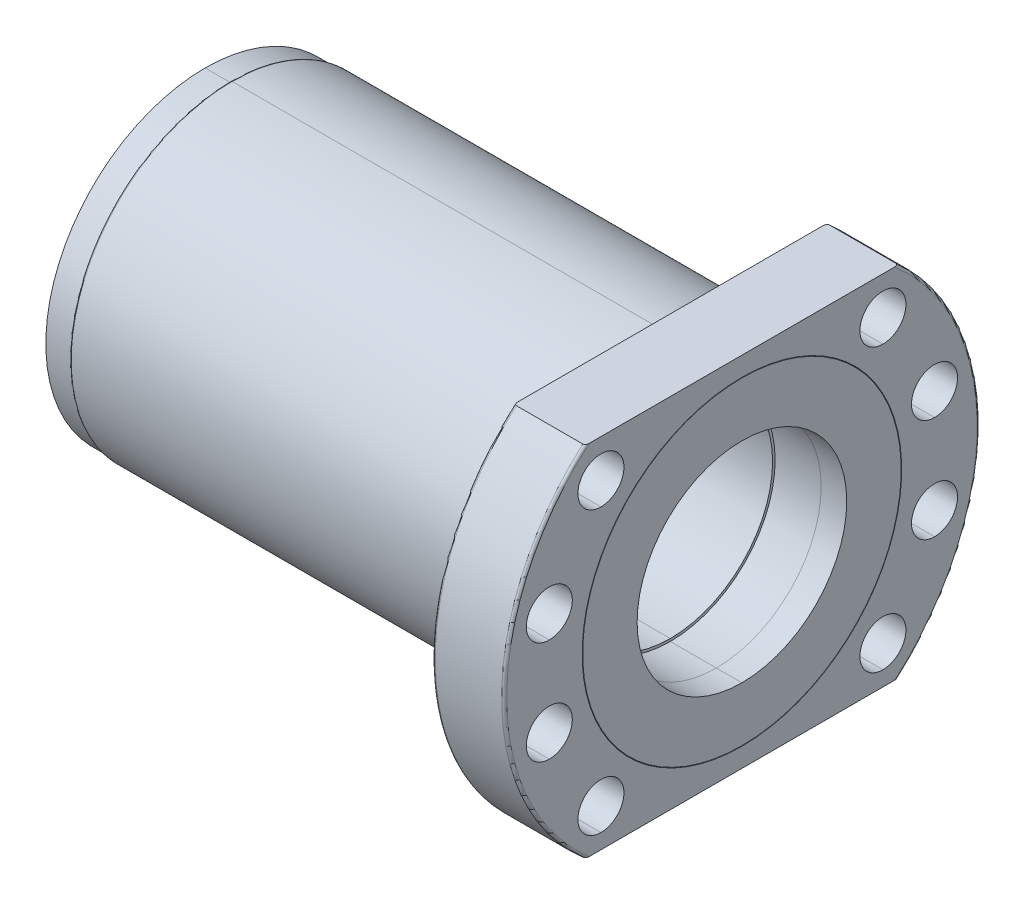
ISO-10303-21;
HEADER;
FILE_DESCRIPTION(('STEP AP214'),'2;1');
FILE_NAME('part.step','',(''),(''),'','','');
FILE_SCHEMA(('AUTOMOTIVE_DESIGN { 1 0 10303 214 1 1 1 1 }'));
ENDSEC;
DATA;
#1=APPLICATION_CONTEXT('core data for automotive mechanical design processes');
#2=APPLICATION_PROTOCOL_DEFINITION('international standard','automotive_design',2000,#1);
#3=PRODUCT_CONTEXT('',#1,'mechanical');
#4=PRODUCT('Part','Part','',(#3));
#5=PRODUCT_RELATED_PRODUCT_CATEGORY('part','',(#4));
#6=PRODUCT_DEFINITION_FORMATION('','',#4);
#7=PRODUCT_DEFINITION_CONTEXT('part definition',#1,'design');
#8=PRODUCT_DEFINITION('design','',#6,#7);
#9=PRODUCT_DEFINITION_SHAPE('','',#8);
#10=(LENGTH_UNIT() NAMED_UNIT(*) SI_UNIT(.MILLI.,.METRE.));
#11=(NAMED_UNIT(*) PLANE_ANGLE_UNIT() SI_UNIT($,.RADIAN.));
#12=(NAMED_UNIT(*) SI_UNIT($,.STERADIAN.) SOLID_ANGLE_UNIT());
#13=UNCERTAINTY_MEASURE_WITH_UNIT(LENGTH_MEASURE(1.E-05),#10,'distance_accuracy_value','');
#14=(GEOMETRIC_REPRESENTATION_CONTEXT(3) GLOBAL_UNCERTAINTY_ASSIGNED_CONTEXT((#13)) GLOBAL_UNIT_ASSIGNED_CONTEXT((#10,
#11,#12)) REPRESENTATION_CONTEXT('',''));
#15=CARTESIAN_POINT('',(0.,0.,0.));
#16=DIRECTION('',(0.,0.,1.));
#17=DIRECTION('',(1.,0.,0.));
#18=AXIS2_PLACEMENT_3D('',#15,#16,#17);
#19=CARTESIAN_POINT('',(-100.,0.,0.));
#20=DIRECTION('',(1.,0.,0.));
#21=DIRECTION('',(0.,1.,0.));
#22=AXIS2_PLACEMENT_3D('',#19,#20,#21);
#23=CYLINDRICAL_SURFACE('',#22,31.15);
#24=CARTESIAN_POINT('',(-84.1896484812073,0.,0.));
#25=DIRECTION('',(1.,0.,0.));
#26=DIRECTION('',(0.,1.,0.));
#27=AXIS2_PLACEMENT_3D('',#24,#25,#26);
#28=CIRCLE('',#27,31.15);
#29=CARTESIAN_POINT('',(-84.1896484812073,31.15,0.));
#30=VERTEX_POINT('',#29);
#31=CARTESIAN_POINT('',(-84.1896484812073,-31.15,0.));
#32=VERTEX_POINT('',#31);
#33=EDGE_CURVE('P0_E102',#30,#32,#28,.T.);
#34=ORIENTED_EDGE('',*,*,#33,.T.);
#35=DIRECTION('',(1.,0.,0.));
#36=VECTOR('',#35,1.);
#37=CARTESIAN_POINT('',(-100.,-31.15,0.));
#38=LINE('',#37,#36);
#39=CARTESIAN_POINT('',(-79.1896484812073,-31.15,0.));
#40=VERTEX_POINT('',#39);
#41=EDGE_CURVE('P0_E110',#32,#40,#38,.T.);
#42=ORIENTED_EDGE('',*,*,#41,.T.);
#43=CARTESIAN_POINT('',(-79.1896484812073,0.,0.));
#44=DIRECTION('',(1.,0.,0.));
#45=DIRECTION('',(0.,1.,0.));
#46=AXIS2_PLACEMENT_3D('',#43,#44,#45);
#47=CIRCLE('',#46,31.15);
#48=CARTESIAN_POINT('',(-79.1896484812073,31.15,0.));
#49=VERTEX_POINT('',#48);
#50=EDGE_CURVE('P0_E24',#49,#40,#47,.T.);
#51=ORIENTED_EDGE('',*,*,#50,.F.);
#52=DIRECTION('',(1.,0.,0.));
#53=VECTOR('',#52,1.);
#54=CARTESIAN_POINT('',(-100.,31.15,0.));
#55=LINE('',#54,#53);
#56=EDGE_CURVE('P0_E111',#30,#49,#55,.T.);
#57=ORIENTED_EDGE('',*,*,#56,.F.);
#58=EDGE_LOOP('',(#34,#42,#51,#57));
#59=FACE_BOUND('',#58,.T.);
#60=ADVANCED_FACE('P0_F16',(#59),#23,.T.);
#61=CARTESIAN_POINT('',(-100.,0.,0.));
#62=DIRECTION('',(1.,0.,0.));
#63=DIRECTION('',(0.,1.,0.));
#64=AXIS2_PLACEMENT_3D('',#61,#62,#63);
#65=CYLINDRICAL_SURFACE('',#64,20.5);
#66=CARTESIAN_POINT('',(-84.1896484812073,0.,0.));
#67=DIRECTION('',(1.,0.,0.));
#68=DIRECTION('',(0.,1.,0.));
#69=AXIS2_PLACEMENT_3D('',#66,#67,#68);
#70=CIRCLE('',#69,20.5);
#71=CARTESIAN_POINT('',(-84.1896484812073,-20.5,0.));
#72=VERTEX_POINT('',#71);
#73=CARTESIAN_POINT('',(-84.1896484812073,20.5,0.));
#74=VERTEX_POINT('',#73);
#75=EDGE_CURVE('P0_E85',#72,#74,#70,.T.);
#76=ORIENTED_EDGE('',*,*,#75,.F.);
#77=DIRECTION('',(1.,0.,0.));
#78=VECTOR('',#77,1.);
#79=CARTESIAN_POINT('',(-100.,-20.5,0.));
#80=LINE('',#79,#78);
#81=CARTESIAN_POINT('',(-79.1896484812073,-20.5,0.));
#82=VERTEX_POINT('',#81);
#83=EDGE_CURVE('P0_E75',#72,#82,#80,.T.);
#84=ORIENTED_EDGE('',*,*,#83,.T.);
#85=CARTESIAN_POINT('',(-79.1896484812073,0.,0.));
#86=DIRECTION('',(-1.,0.,0.));
#87=DIRECTION('',(0.,1.,0.));
#88=AXIS2_PLACEMENT_3D('',#85,#86,#87);
#89=CIRCLE('',#88,20.5);
#90=CARTESIAN_POINT('',(-79.1896484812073,20.5,0.));
#91=VERTEX_POINT('',#90);
#92=EDGE_CURVE('P0_E11',#91,#82,#89,.T.);
#93=ORIENTED_EDGE('',*,*,#92,.F.);
#94=DIRECTION('',(1.,0.,0.));
#95=VECTOR('',#94,1.);
#96=CARTESIAN_POINT('',(-100.,20.5,0.));
#97=LINE('',#96,#95);
#98=EDGE_CURVE('P0_E84',#74,#91,#97,.T.);
#99=ORIENTED_EDGE('',*,*,#98,.F.);
#100=EDGE_LOOP('',(#76,#84,#93,#99));
#101=FACE_BOUND('',#100,.T.);
#102=ADVANCED_FACE('P0_F88',(#101),#65,.F.);
#103=CARTESIAN_POINT('',(-79.1896484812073,25.825,0.));
#104=DIRECTION('',(1.,0.,0.));
#105=DIRECTION('',(0.,-1.,0.));
#106=AXIS2_PLACEMENT_3D('',#103,#104,#105);
#107=PLANE('',#106);
#108=ORIENTED_EDGE('',*,*,#92,.T.);
#109=CARTESIAN_POINT('',(-79.1896484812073,0.,0.));
#110=DIRECTION('',(-1.,0.,0.));
#111=DIRECTION('',(0.,1.,0.));
#112=AXIS2_PLACEMENT_3D('',#109,#110,#111);
#113=CIRCLE('',#112,20.5);
#114=EDGE_CURVE('P0_E81',#82,#91,#113,.T.);
#115=ORIENTED_EDGE('',*,*,#114,.T.);
#116=EDGE_LOOP('',(#108,#115));
#117=FACE_BOUND('',#116,.T.);
#118=ORIENTED_EDGE('',*,*,#50,.T.);
#119=CARTESIAN_POINT('',(-79.1896484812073,0.,0.));
#120=DIRECTION('',(1.,0.,0.));
#121=DIRECTION('',(0.,1.,0.));
#122=AXIS2_PLACEMENT_3D('',#119,#120,#121);
#123=CIRCLE('',#122,31.15);
#124=EDGE_CURVE('P0_E115',#40,#49,#123,.T.);
#125=ORIENTED_EDGE('',*,*,#124,.T.);
#126=EDGE_LOOP('',(#118,#125));
#127=FACE_BOUND('',#126,.T.);
#128=ADVANCED_FACE('P0_F120',(#117,#127),#107,.T.);
#129=CARTESIAN_POINT('',(-100.,0.,0.));
#130=DIRECTION('',(1.,0.,0.));
#131=DIRECTION('',(0.,1.,0.));
#132=AXIS2_PLACEMENT_3D('',#129,#130,#131);
#133=CYLINDRICAL_SURFACE('',#132,31.15);
#134=ORIENTED_EDGE('',*,*,#41,.F.);
#135=CARTESIAN_POINT('',(-84.1896484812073,0.,0.));
#136=DIRECTION('',(1.,0.,0.));
#137=DIRECTION('',(0.,1.,0.));
#138=AXIS2_PLACEMENT_3D('',#135,#136,#137);
#139=CIRCLE('',#138,31.15);
#140=EDGE_CURVE('P0_E95',#32,#30,#139,.T.);
#141=ORIENTED_EDGE('',*,*,#140,.T.);
#142=ORIENTED_EDGE('',*,*,#56,.T.);
#143=ORIENTED_EDGE('',*,*,#124,.F.);
#144=EDGE_LOOP('',(#134,#141,#142,#143));
#145=FACE_BOUND('',#144,.T.);
#146=ADVANCED_FACE('P0_F122',(#145),#133,.T.);
#147=CARTESIAN_POINT('',(-100.,0.,0.));
#148=DIRECTION('',(1.,0.,0.));
#149=DIRECTION('',(0.,1.,0.));
#150=AXIS2_PLACEMENT_3D('',#147,#148,#149);
#151=CYLINDRICAL_SURFACE('',#150,20.5);
#152=ORIENTED_EDGE('',*,*,#83,.F.);
#153=CARTESIAN_POINT('',(-84.1896484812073,0.,0.));
#154=DIRECTION('',(1.,0.,0.));
#155=DIRECTION('',(0.,1.,0.));
#156=AXIS2_PLACEMENT_3D('',#153,#154,#155);
#157=CIRCLE('',#156,20.5);
#158=EDGE_CURVE('P0_E80',#74,#72,#157,.T.);
#159=ORIENTED_EDGE('',*,*,#158,.F.);
#160=ORIENTED_EDGE('',*,*,#98,.T.);
#161=ORIENTED_EDGE('',*,*,#114,.F.);
#162=EDGE_LOOP('',(#152,#159,#160,#161));
#163=FACE_BOUND('',#162,.T.);
#164=ADVANCED_FACE('P0_F77',(#163),#151,.F.);
#165=CARTESIAN_POINT('',(-84.1896484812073,25.825,0.));
#166=DIRECTION('',(-1.,0.,0.));
#167=DIRECTION('',(0.,0.,1.));
#168=AXIS2_PLACEMENT_3D('',#165,#166,#167);
#169=PLANE('',#168);
#170=ORIENTED_EDGE('',*,*,#158,.T.);
#171=ORIENTED_EDGE('',*,*,#75,.T.);
#172=EDGE_LOOP('',(#170,#171));
#173=FACE_BOUND('',#172,.T.);
#174=ORIENTED_EDGE('',*,*,#33,.F.);
#175=ORIENTED_EDGE('',*,*,#140,.F.);
#176=EDGE_LOOP('',(#174,#175));
#177=FACE_BOUND('',#176,.T.);
#178=ADVANCED_FACE('P0_F92',(#173,#177),#169,.T.);
#179=CLOSED_SHELL('',(#60,#102,#128,#146,#164,#178));
#180=MANIFOLD_SOLID_BREP('P0_B1',#179);
#181=CARTESIAN_POINT('',(6.81035151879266,0.,0.));
#182=DIRECTION('',(-1.,0.,0.));
#183=DIRECTION('',(0.,0.,1.));
#184=AXIS2_PLACEMENT_3D('',#181,#182,#183);
#185=PLANE('',#184);
#186=CARTESIAN_POINT('',(6.81035151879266,0.,0.));
#187=DIRECTION('',(-1.,0.,0.));
#188=DIRECTION('',(0.,-1.,0.));
#189=AXIS2_PLACEMENT_3D('',#186,#187,#188);
#190=CIRCLE('',#189,20.);
#191=CARTESIAN_POINT('',(6.81035151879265,-20.,0.));
#192=VERTEX_POINT('',#191);
#193=CARTESIAN_POINT('',(6.81035151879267,20.,0.));
#194=VERTEX_POINT('',#193);
#195=EDGE_CURVE('P1_E11',#192,#194,#190,.T.);
#196=ORIENTED_EDGE('',*,*,#195,.T.);
#197=CARTESIAN_POINT('',(6.81035151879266,0.,0.));
#198=DIRECTION('',(-1.,0.,0.));
#199=DIRECTION('',(0.,-1.,0.));
#200=AXIS2_PLACEMENT_3D('',#197,#198,#199);
#201=CIRCLE('',#200,20.);
#202=EDGE_CURVE('P1_E980',#194,#192,#201,.T.);
#203=ORIENTED_EDGE('',*,*,#202,.T.);
#204=EDGE_LOOP('',(#196,#203));
#205=FACE_BOUND('',#204,.T.);
#206=CARTESIAN_POINT('',(6.81035151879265,0.,0.));
#207=DIRECTION('',(1.,0.,0.));
#208=DIRECTION('',(0.,-1.,0.));
#209=AXIS2_PLACEMENT_3D('',#206,#207,#208);
#210=CIRCLE('',#209,20.5);
#211=CARTESIAN_POINT('',(6.81035151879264,-20.5,0.));
#212=VERTEX_POINT('',#211);
#213=CARTESIAN_POINT('',(6.81035151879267,20.5,0.));
#214=VERTEX_POINT('',#213);
#215=EDGE_CURVE('P1_E352',#212,#214,#210,.T.);
#216=ORIENTED_EDGE('',*,*,#215,.T.);
#217=CARTESIAN_POINT('',(6.81035151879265,0.,0.));
#218=DIRECTION('',(1.,0.,0.));
#219=DIRECTION('',(0.,-1.,0.));
#220=AXIS2_PLACEMENT_3D('',#217,#218,#219);
#221=CIRCLE('',#220,20.5);
#222=EDGE_CURVE('P1_E919',#214,#212,#221,.T.);
#223=ORIENTED_EDGE('',*,*,#222,.T.);
#224=EDGE_LOOP('',(#216,#223));
#225=FACE_BOUND('',#224,.T.);
#226=ADVANCED_FACE('P1_F17',(#205,#225),#185,.F.);
#227=CARTESIAN_POINT('',(42.,0.,0.));
#228=DIRECTION('',(-1.,0.,0.));
#229=DIRECTION('',(0.,-1.,0.));
#230=AXIS2_PLACEMENT_3D('',#227,#228,#229);
#231=CYLINDRICAL_SURFACE('',#230,20.);
#232=DIRECTION('',(-1.,0.,0.));
#233=VECTOR('',#232,1.);
#234=CARTESIAN_POINT('',(42.,20.,0.));
#235=LINE('',#234,#233);
#236=CARTESIAN_POINT('',(-78.8896484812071,20.,0.));
#237=VERTEX_POINT('',#236);
#238=EDGE_CURVE('P1_E976',#194,#237,#235,.T.);
#239=ORIENTED_EDGE('',*,*,#238,.F.);
#240=ORIENTED_EDGE('',*,*,#195,.F.);
#241=DIRECTION('',(-1.,0.,0.));
#242=VECTOR('',#241,1.);
#243=CARTESIAN_POINT('',(42.,-20.,0.));
#244=LINE('',#243,#242);
#245=CARTESIAN_POINT('',(-78.8896484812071,-20.,0.));
#246=VERTEX_POINT('',#245);
#247=EDGE_CURVE('P1_E957',#192,#246,#244,.T.);
#248=ORIENTED_EDGE('',*,*,#247,.T.);
#249=CARTESIAN_POINT('',(-78.8896484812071,0.,0.));
#250=DIRECTION('',(1.,0.,0.));
#251=DIRECTION('',(0.,0.,-1.));
#252=AXIS2_PLACEMENT_3D('',#249,#250,#251);
#253=CIRCLE('',#252,20.);
#254=EDGE_CURVE('P1_E342',#237,#246,#253,.T.);
#255=ORIENTED_EDGE('',*,*,#254,.F.);
#256=EDGE_LOOP('',(#239,#240,#248,#255));
#257=FACE_BOUND('',#256,.T.);
#258=ADVANCED_FACE('P1_F906',(#257),#231,.F.);
#259=CARTESIAN_POINT('',(-78.8896484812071,0.,0.));
#260=DIRECTION('',(1.,0.,0.));
#261=DIRECTION('',(0.,1.,0.));
#262=AXIS2_PLACEMENT_3D('',#259,#260,#261);
#263=TOROIDAL_SURFACE('',#262,31.2,0.299999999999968);
#264=CARTESIAN_POINT('',(-79.1896484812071,31.1999999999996,3.48713869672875E-06));
#265=CARTESIAN_POINT('',(-79.1896484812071,31.1999996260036,3.34620893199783));
#266=CARTESIAN_POINT('',(-79.1896484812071,30.6570814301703,6.69181956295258));
#267=CARTESIAN_POINT('',(-79.1896484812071,29.0698364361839,11.4535532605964));
#268=CARTESIAN_POINT('',(-79.1896484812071,28.4128118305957,12.9981305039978));
#269=CARTESIAN_POINT('',(-79.1896484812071,27.2480644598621,15.2211300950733));
#270=CARTESIAN_POINT('',(-79.1896484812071,26.8299974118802,15.9465061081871));
#271=CARTESIAN_POINT('',(-79.1896484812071,26.1601967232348,17.0076177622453));
#272=CARTESIAN_POINT('',(-79.1896484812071,25.8146257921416,17.5314380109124));
#273=CARTESIAN_POINT('',(-79.1896484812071,25.3932754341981,18.1300333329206));
#274=CARTESIAN_POINT('',(-79.1896484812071,25.1781186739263,18.4261085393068));
#275=CARTESIAN_POINT('',(-79.1896484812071,25.0694280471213,18.5733293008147));
#276=CARTESIAN_POINT('',(-79.1896484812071,25.0148057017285,18.6467340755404));
#277=CARTESIAN_POINT('',(-79.1896484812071,24.9874254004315,18.6833848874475));
#278=CARTESIAN_POINT('',(-79.1896484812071,24.9756761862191,18.6990813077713));
#279=CARTESIAN_POINT('',(-79.1896484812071,24.9678400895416,18.7095431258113));
#280=CARTESIAN_POINT('',(-79.1896484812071,24.9651122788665,18.7131836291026));
#281=CARTESIAN_POINT('',(-79.1896484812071,24.6327347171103,19.1563536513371));
#282=CARTESIAN_POINT('',(-79.1896484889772,24.2940942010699,19.584096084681));
#283=CARTESIAN_POINT('',(-79.1896484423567,23.7697723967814,20.2119297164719));
#284=CARTESIAN_POINT('',(-79.1896484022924,23.5035219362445,20.5224021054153));
#285=CARTESIAN_POINT('',(-79.189648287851,23.1859008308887,20.8784090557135));
#286=CARTESIAN_POINT('',(-79.1896482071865,23.0253620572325,21.0548374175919));
#287=CARTESIAN_POINT('',(-79.1896481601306,22.9446632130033,21.1426550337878));
#288=CARTESIAN_POINT('',(-79.189648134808,22.9042067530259,21.1864643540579));
#289=CARTESIAN_POINT('',(-79.1896481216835,22.8839518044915,21.2083440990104));
#290=CARTESIAN_POINT('',(-79.1896481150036,22.8738176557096,21.2192777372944));
#291=CARTESIAN_POINT('',(-79.1896481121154,22.8694730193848,21.2239622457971));
#292=CARTESIAN_POINT('',(-79.1896481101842,22.8665762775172,21.2270849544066));
#293=CARTESIAN_POINT('',(-79.1896481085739,22.864170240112,21.2296779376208));
#294=CARTESIAN_POINT('',(-79.1896480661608,22.8009078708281,21.2978473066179));
#295=CARTESIAN_POINT('',(-79.189648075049,22.6768355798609,21.4314295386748));
#296=CARTESIAN_POINT('',(-79.1896481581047,22.3936466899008,21.7258055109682));
#297=CARTESIAN_POINT('',(-79.1896481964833,22.2830182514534,21.8395466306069));
#298=CARTESIAN_POINT('',(-79.1896482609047,22.0916419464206,22.032482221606));
#299=CARTESIAN_POINT('',(-79.1896482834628,22.0236079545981,22.1005112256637));
#300=CARTESIAN_POINT('',(-79.1896483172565,21.9150330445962,22.2079603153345));
#301=CARTESIAN_POINT('',(-79.189648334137,21.8591143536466,22.2630359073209));
#302=CARTESIAN_POINT('',(-79.1896483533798,21.7909833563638,22.3296141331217));
#303=CARTESIAN_POINT('',(-79.1896483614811,21.7611603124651,22.3586408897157));
#304=CARTESIAN_POINT('',(-79.1896483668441,21.7411391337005,22.3781011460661));
#305=CARTESIAN_POINT('',(-79.1896483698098,21.7298935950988,22.3890154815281));
#306=CARTESIAN_POINT('',(-79.1896484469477,21.4334087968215,22.6764150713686));
#307=CARTESIAN_POINT('',(-79.1896484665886,21.1864173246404,22.9053862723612));
#308=CARTESIAN_POINT('',(-79.1896484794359,20.8832312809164,23.1808482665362));
#309=CARTESIAN_POINT('',(-79.1896484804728,20.7933563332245,23.2613144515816));
#310=CARTESIAN_POINT('',(-79.189648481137,20.6758883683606,23.3655920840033));
#311=CARTESIAN_POINT('',(-79.18964848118,20.6396214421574,23.3976127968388));
#312=CARTESIAN_POINT('',(-79.1896484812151,20.5729399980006,23.4562597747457));
#313=CARTESIAN_POINT('',(-79.1896484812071,20.5415787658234,23.4837122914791));
#314=CARTESIAN_POINT('',(-79.1896484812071,20.4090246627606,23.5993998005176));
#315=CARTESIAN_POINT('',(-79.1896484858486,20.2439523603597,23.7426282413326));
#316=CARTESIAN_POINT('',(-79.1896484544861,19.9030750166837,24.0278525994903));
#317=CARTESIAN_POINT('',(-79.189648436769,19.77387072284,24.1346146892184));
#318=CARTESIAN_POINT('',(-79.1896483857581,19.5558250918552,24.3111796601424));
#319=CARTESIAN_POINT('',(-79.1896483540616,19.4407397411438,24.4035632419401));
#320=CARTESIAN_POINT('',(-79.1896483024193,19.2956462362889,24.5182310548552));
#321=CARTESIAN_POINT('',(-79.1896482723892,19.2203635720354,24.5772468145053));
#322=CARTESIAN_POINT('',(-79.1896482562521,19.1820345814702,24.6071700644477));
#323=CARTESIAN_POINT('',(-79.1896482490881,19.1654601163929,24.6200827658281));
#324=CARTESIAN_POINT('',(-79.1896482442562,19.1543775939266,24.6287108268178));
#325=CARTESIAN_POINT('',(-79.1896482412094,19.1474609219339,24.6340911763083));
#326=CARTESIAN_POINT('',(-79.1896481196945,18.8734994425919,24.8470805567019));
#327=CARTESIAN_POINT('',(-79.1896479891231,18.6185993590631,25.0381514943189));
#328=CARTESIAN_POINT('',(-79.1896478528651,18.2606202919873,25.2992074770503));
#329=CARTESIAN_POINT('',(-79.1896478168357,18.1453512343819,25.3819652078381));
#330=CARTESIAN_POINT('',(-79.1896477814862,17.9787574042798,25.4999872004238));
#331=CARTESIAN_POINT('',(-79.1896477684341,17.8970375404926,25.5574692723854));
#332=CARTESIAN_POINT('',(-79.1896477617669,17.8045025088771,25.6219136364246));
#333=CARTESIAN_POINT('',(-79.1896477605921,17.7589415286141,25.6534882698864));
#334=CARTESIAN_POINT('',(-79.1896477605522,17.7395673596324,25.6668822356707));
#335=CARTESIAN_POINT('',(-79.1896477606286,17.7266850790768,25.6757809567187));
#336=CARTESIAN_POINT('',(-79.1896477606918,17.7214679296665,25.6793825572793));
#337=CARTESIAN_POINT('',(-79.1896477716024,17.226524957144,26.0207225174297));
#338=CARTESIAN_POINT('',(-79.189647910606,16.7296856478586,26.3428350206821));
#339=CARTESIAN_POINT('',(-79.1896481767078,15.9713926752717,26.8042730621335));
#340=CARTESIAN_POINT('',(-79.1896483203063,15.5889883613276,27.029560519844));
#341=CARTESIAN_POINT('',(-79.1896484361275,15.1374251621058,27.2827349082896));
#342=CARTESIAN_POINT('',(-79.1896484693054,14.9103223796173,27.4068882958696));
#343=CARTESIAN_POINT('',(-79.1896484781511,14.7964450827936,27.4683542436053));
#344=CARTESIAN_POINT('',(-79.189648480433,14.7394255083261,27.4989342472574));
#345=CARTESIAN_POINT('',(-79.1896484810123,14.7108955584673,27.5141859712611));
#346=CARTESIAN_POINT('',(-79.1896484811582,14.6966255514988,27.5218022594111));
#347=CARTESIAN_POINT('',(-79.1896484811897,14.690508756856,27.5250643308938));
#348=CARTESIAN_POINT('',(-79.1896484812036,14.6864306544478,27.5272385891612));
#349=CARTESIAN_POINT('',(-79.1896484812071,14.6825507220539,27.5293063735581));
#350=CARTESIAN_POINT('',(-79.1896484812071,14.5810519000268,27.5833918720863));
#351=CARTESIAN_POINT('',(-79.1896484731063,14.2254783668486,27.7768487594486));
#352=CARTESIAN_POINT('',(-79.1896484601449,12.9756752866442,28.3821566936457));
#353=CARTESIAN_POINT('',(-79.1896484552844,12.080443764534,28.7944070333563));
#354=CARTESIAN_POINT('',(-79.1896484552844,9.69280794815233,29.6834039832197));
#355=CARTESIAN_POINT('',(-79.1896484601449,8.19843214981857,30.1604674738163));
#356=CARTESIAN_POINT('',(-79.1896484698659,5.47711155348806,30.7293811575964));
#357=CARTESIAN_POINT('',(-79.1896484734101,4.49036106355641,30.8936987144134));
#358=CARTESIAN_POINT('',(-79.1896484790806,2.36010631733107,31.1290187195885));
#359=CARTESIAN_POINT('',(-79.1896484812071,1.21649721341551,31.1999791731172));
#360=CARTESIAN_POINT('',(-79.1896484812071,-0.00237491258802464,31.2000000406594));
#361=CARTESIAN_POINT('',(-79.1896484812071,-0.00248751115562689,31.1999999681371));
#362=CARTESIAN_POINT('',(-79.1896484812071,-0.00497557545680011,31.1999997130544));
#363=CARTESIAN_POINT('',(-79.1896484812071,-0.00870767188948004,31.1999991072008));
#364=CARTESIAN_POINT('',(-79.189648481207,-0.0174158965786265,31.1999961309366));
#365=CARTESIAN_POINT('',(-79.1896484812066,-0.0348323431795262,31.1999839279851));
#366=CARTESIAN_POINT('',(-79.1896484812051,-0.069665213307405,31.1999345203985));
#367=CARTESIAN_POINT('',(-79.1896484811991,-0.139330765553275,31.1997356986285));
#368=CARTESIAN_POINT('',(-79.1896484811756,-0.278660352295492,31.1989380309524));
#369=CARTESIAN_POINT('',(-79.1896484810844,-0.557307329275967,31.1957426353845));
#370=CARTESIAN_POINT('',(-79.189648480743,-1.11450349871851,31.1829521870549));
#371=CARTESIAN_POINT('',(-79.1896484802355,-1.59176457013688,31.1610211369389));
#372=CARTESIAN_POINT('',(-79.1896484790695,-2.54539160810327,31.1025557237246));
#373=CARTESIAN_POINT('',(-79.189648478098,-3.17994904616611,31.0441031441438));
#374=CARTESIAN_POINT('',(-79.189648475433,-5.07647060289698,30.8106471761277));
#375=CARTESIAN_POINT('',(-79.1896484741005,-6.33126970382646,30.5774737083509));
#376=CARTESIAN_POINT('',(-79.1896484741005,-10.0388388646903,29.6505815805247));
#377=CARTESIAN_POINT('',(-79.1896484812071,-12.4343322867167,28.728405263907));
#378=CARTESIAN_POINT('',(-79.1896484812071,-14.6845464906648,27.5282418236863));
#379=CARTESIAN_POINT('',(-79.1896484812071,-14.6834078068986,27.5288491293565));
#380=CARTESIAN_POINT('',(-79.1896484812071,-14.6844786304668,27.5282779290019));
#381=CARTESIAN_POINT('',(-79.1896484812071,-14.6861003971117,27.5274127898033));
#382=CARTESIAN_POINT('',(-79.1896484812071,-14.689993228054,27.5253357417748));
#383=CARTESIAN_POINT('',(-79.1896484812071,-14.6982136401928,27.5209479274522));
#384=CARTESIAN_POINT('',(-79.1896484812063,-14.716392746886,27.5112360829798));
#385=CARTESIAN_POINT('',(-79.1896484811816,-14.7596976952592,27.4880556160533));
#386=CARTESIAN_POINT('',(-79.1896484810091,-14.8087008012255,27.4617014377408));
#387=CARTESIAN_POINT('',(-79.1896484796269,-14.9224612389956,27.4001768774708));
#388=CARTESIAN_POINT('',(-79.1896484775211,-15.0193181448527,27.3474233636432));
#389=CARTESIAN_POINT('',(-79.1896484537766,-15.3718195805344,27.1519452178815));
#390=CARTESIAN_POINT('',(-79.1896484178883,-15.6896032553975,26.9722680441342));
#391=CARTESIAN_POINT('',(-79.1896482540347,-16.1837336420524,26.6751414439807));
#392=CARTESIAN_POINT('',(-79.1896482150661,-16.2873884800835,26.612068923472));
#393=CARTESIAN_POINT('',(-79.1896481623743,-16.4093013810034,26.5368117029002));
#394=CARTESIAN_POINT('',(-79.1896481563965,-16.4229208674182,26.5283900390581));
#395=CARTESIAN_POINT('',(-79.1896481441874,-16.4503065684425,26.5114264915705));
#396=CARTESIAN_POINT('',(-79.1896481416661,-16.4558869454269,26.5079620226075));
#397=CARTESIAN_POINT('',(-79.1896481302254,-16.4814170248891,26.4921107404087));
#398=CARTESIAN_POINT('',(-79.1896481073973,-16.5323339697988,26.4604286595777));
#399=CARTESIAN_POINT('',(-79.1896480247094,-16.7174574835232,26.3444940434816));
#400=CARTESIAN_POINT('',(-79.1896479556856,-16.8810085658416,26.2398528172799));
#401=CARTESIAN_POINT('',(-79.1896478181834,-17.2645847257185,25.9905098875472));
#402=CARTESIAN_POINT('',(-79.1896477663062,-17.5083732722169,25.8266814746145));
#403=CARTESIAN_POINT('',(-79.1896477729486,-17.8568142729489,25.5858319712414));
#404=CARTESIAN_POINT('',(-79.1896477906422,-17.9842469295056,25.4964293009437));
#405=CARTESIAN_POINT('',(-79.1896478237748,-18.1081118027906,25.4081829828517));
#406=CARTESIAN_POINT('',(-79.1896478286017,-18.125260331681,25.3959446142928));
#407=CARTESIAN_POINT('',(-79.1896478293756,-18.1279721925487,25.3940081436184));
#408=CARTESIAN_POINT('',(-79.1896478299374,-18.1298911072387,25.3926378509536));
#409=CARTESIAN_POINT('',(-79.189647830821,-18.1328271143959,25.3905409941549));
#410=CARTESIAN_POINT('',(-79.1896478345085,-18.1442262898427,25.3823966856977));
#411=CARTESIAN_POINT('',(-79.1896478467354,-18.1761608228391,25.3595513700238));
#412=CARTESIAN_POINT('',(-79.1896478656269,-18.2166706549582,25.3304635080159));
#413=CARTESIAN_POINT('',(-79.1896479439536,-18.3760487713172,25.2154918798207));
#414=CARTESIAN_POINT('',(-79.1896480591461,-18.5817269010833,25.0662020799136));
#415=CARTESIAN_POINT('',(-79.1896482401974,-19.0010751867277,24.7478043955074));
#416=CARTESIAN_POINT('',(-79.189648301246,-19.1592763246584,24.6258621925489));
#417=CARTESIAN_POINT('',(-79.1896483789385,-19.4228794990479,24.4176134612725));
#418=CARTESIAN_POINT('',(-79.1896484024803,-19.5151269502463,24.343970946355));
#419=CARTESIAN_POINT('',(-79.1896484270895,-19.6357425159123,24.2464395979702));
#420=CARTESIAN_POINT('',(-79.1896484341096,-19.6723250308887,24.2167692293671));
#421=CARTESIAN_POINT('',(-79.1896484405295,-19.7094992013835,24.1864766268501));
#422=CARTESIAN_POINT('',(-79.1896484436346,-19.7281844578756,24.1712261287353));
#423=CARTESIAN_POINT('',(-79.1896484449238,-19.736136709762,24.1647291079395));
#424=CARTESIAN_POINT('',(-79.1896484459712,-19.7426916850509,24.1593711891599));
#425=CARTESIAN_POINT('',(-79.189648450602,-19.7721946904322,24.1352460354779));
#426=CARTESIAN_POINT('',(-79.1896484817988,-20.011905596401,23.9385035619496));
#427=CARTESIAN_POINT('',(-79.1896484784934,-20.4644809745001,23.5560663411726));
#428=CARTESIAN_POINT('',(-79.1896484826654,-20.898879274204,23.1682547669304));
#429=CARTESIAN_POINT('',(-79.1896484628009,-21.1451218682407,22.9419217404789));
#430=CARTESIAN_POINT('',(-79.1896484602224,-21.1725084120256,22.9166598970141));
#431=CARTESIAN_POINT('',(-79.1896484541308,-21.2273322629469,22.8659075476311));
#432=CARTESIAN_POINT('',(-79.1896484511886,-21.2509267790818,22.8439851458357));
#433=CARTESIAN_POINT('',(-79.1896484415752,-21.3257110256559,22.7742915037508));
#434=CARTESIAN_POINT('',(-79.1896484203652,-21.4748214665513,22.6344131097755));
#435=CARTESIAN_POINT('',(-79.1896483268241,-22.0164862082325,22.1161572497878));
#436=CARTESIAN_POINT('',(-79.1896482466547,-22.4933165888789,21.6289469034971));
#437=CARTESIAN_POINT('',(-79.1896482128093,-23.60619119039,20.4304107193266));
#438=CARTESIAN_POINT('',(-79.1896484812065,-24.3060521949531,19.5923863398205));
#439=CARTESIAN_POINT('',(-79.1896484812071,-24.9612754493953,18.7182985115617));
#440=CARTESIAN_POINT('',(-79.1896484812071,-24.9601970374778,18.7197371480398));
#441=CARTESIAN_POINT('',(-79.1896484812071,-24.9604050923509,18.7194596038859));
#442=CARTESIAN_POINT('',(-79.189648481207,-24.9607280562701,18.7190287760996));
#443=CARTESIAN_POINT('',(-79.1896484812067,-24.961557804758,18.7179219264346));
#444=CARTESIAN_POINT('',(-79.1896484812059,-24.9635219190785,18.7153018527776));
#445=CARTESIAN_POINT('',(-79.1896484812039,-24.9686681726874,18.7084358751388));
#446=CARTESIAN_POINT('',(-79.1896484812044,-24.9838280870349,18.6881970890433));
#447=CARTESIAN_POINT('',(-79.1896484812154,-25.0051463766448,18.6596799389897));
#448=CARTESIAN_POINT('',(-79.1896484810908,-25.058780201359,18.5876772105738));
#449=CARTESIAN_POINT('',(-79.189648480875,-25.1092172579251,18.519730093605));
#450=CARTESIAN_POINT('',(-79.189648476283,-25.3031084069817,18.2549819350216));
#451=CARTESIAN_POINT('',(-79.1896484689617,-25.4894526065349,17.9974480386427));
#452=CARTESIAN_POINT('',(-79.1896484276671,-25.7843710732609,17.5678198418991));
#453=CARTESIAN_POINT('',(-79.1896484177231,-25.8464299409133,17.4764951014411));
#454=CARTESIAN_POINT('',(-79.1896484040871,-25.919518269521,17.367561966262));
#455=CARTESIAN_POINT('',(-79.1896484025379,-25.927684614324,17.3553722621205));
#456=CARTESIAN_POINT('',(-79.1896484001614,-25.9400017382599,17.3369583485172));
#457=CARTESIAN_POINT('',(-79.1896483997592,-25.9420656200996,17.3338698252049));
#458=CARTESIAN_POINT('',(-79.1896483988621,-25.9466916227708,17.3269466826));
#459=CARTESIAN_POINT('',(-79.1896483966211,-25.9582471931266,17.3096454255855));
#460=CARTESIAN_POINT('',(-79.1896483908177,-25.9881691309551,17.2647480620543));
#461=CARTESIAN_POINT('',(-79.1896483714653,-26.0884520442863,17.1134891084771));
#462=CARTESIAN_POINT('',(-79.1896483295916,-26.3177384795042,16.7615497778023));
#463=CARTESIAN_POINT('',(-79.1896483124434,-26.5127995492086,16.4495365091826));
#464=CARTESIAN_POINT('',(-79.189648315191,-26.6975379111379,16.1466760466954));
#465=CARTESIAN_POINT('',(-79.1896483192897,-26.7573965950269,16.047247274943));
#466=CARTESIAN_POINT('',(-79.1896483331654,-26.8737909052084,15.8515276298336));
#467=CARTESIAN_POINT('',(-79.1896483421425,-26.9364661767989,15.74481755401));
#468=CARTESIAN_POINT('',(-79.1896483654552,-27.1172743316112,15.4326841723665));
#469=CARTESIAN_POINT('',(-79.1896484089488,-27.4716719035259,14.8042374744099));
#470=CARTESIAN_POINT('',(-79.1896484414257,-27.8041245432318,14.1637528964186));
#471=CARTESIAN_POINT('',(-79.1896484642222,-28.1215918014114,13.5159280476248));
#472=CARTESIAN_POINT('',(-79.1896484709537,-28.2378326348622,13.271617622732));
#473=CARTESIAN_POINT('',(-79.1896484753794,-28.3508779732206,13.0258325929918));
#474=CARTESIAN_POINT('',(-79.1896484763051,-28.3759201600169,12.9711775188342));
#475=CARTESIAN_POINT('',(-79.1896484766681,-28.3867800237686,12.9473834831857));
#476=CARTESIAN_POINT('',(-79.1896484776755,-28.4210366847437,12.8720860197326));
#477=CARTESIAN_POINT('',(-79.1896484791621,-28.4891518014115,12.7213111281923));
#478=CARTESIAN_POINT('',(-79.1896484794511,-28.7345169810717,12.1665134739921));
#479=CARTESIAN_POINT('',(-79.1896484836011,-28.9442088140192,11.6563631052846));
#480=CARTESIAN_POINT('',(-79.1896484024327,-29.4213639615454,10.4219792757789));
#481=CARTESIAN_POINT('',(-79.1896484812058,-29.7050543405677,9.58381588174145));
#482=CARTESIAN_POINT('',(-79.1896484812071,-29.9524813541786,8.73434741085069));
#483=CARTESIAN_POINT('',(-79.1896484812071,-29.9520868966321,8.7357016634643));
#484=CARTESIAN_POINT('',(-79.1896484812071,-29.9521750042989,8.73539916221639));
#485=CARTESIAN_POINT('',(-79.1896484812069,-29.9523082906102,8.73494154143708));
#486=CARTESIAN_POINT('',(-79.1896484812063,-29.9526271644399,8.73384667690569));
#487=CARTESIAN_POINT('',(-79.1896484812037,-29.9532963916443,8.73154861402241));
#488=CARTESIAN_POINT('',(-79.1896484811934,-29.9547606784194,8.72651912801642));
#489=CARTESIAN_POINT('',(-79.1896484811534,-29.9581918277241,8.71472649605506));
#490=CARTESIAN_POINT('',(-79.189648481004,-29.967057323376,8.68420453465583));
#491=CARTESIAN_POINT('',(-79.1896484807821,-29.9780622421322,8.64614318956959));
#492=CARTESIAN_POINT('',(-79.1896484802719,-30.0044928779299,8.55411978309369));
#493=CARTESIAN_POINT('',(-79.1896484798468,-30.0280246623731,8.47157405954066));
#494=CARTESIAN_POINT('',(-79.1896484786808,-30.1147789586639,8.15991014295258));
#495=CARTESIAN_POINT('',(-79.1896484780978,-30.1944381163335,7.86680670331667));
#496=CARTESIAN_POINT('',(-79.1896484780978,-30.3824221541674,7.10627644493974));
#497=CARTESIAN_POINT('',(-79.1896484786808,-30.4907571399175,6.63879437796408));
#498=CARTESIAN_POINT('',(-79.1896484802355,-30.7121165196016,5.52509357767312));
#499=CARTESIAN_POINT('',(-79.1896484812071,-30.8251469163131,4.87879337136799));
#500=CARTESIAN_POINT('',(-79.1896484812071,-30.9242786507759,4.13871983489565));
#501=CARTESIAN_POINT('',(-79.1896484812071,-30.9242523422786,4.13891557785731));
#502=CARTESIAN_POINT('',(-79.1896484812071,-30.9246110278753,4.1362351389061));
#503=CARTESIAN_POINT('',(-79.1896484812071,-30.9251487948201,4.13221444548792));
#504=CARTESIAN_POINT('',(-79.1896484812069,-30.9264017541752,4.12283258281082));
#505=CARTESIAN_POINT('',(-79.1896484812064,-30.9289003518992,4.10406788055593));
#506=CARTESIAN_POINT('',(-79.1896484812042,-30.933868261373,4.06653458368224));
#507=CARTESIAN_POINT('',(-79.1896484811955,-30.9436869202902,3.99145254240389));
#508=CARTESIAN_POINT('',(-79.1896484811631,-30.9628554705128,3.84122764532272));
#509=CARTESIAN_POINT('',(-79.1896484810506,-30.9993165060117,3.54054240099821));
#510=CARTESIAN_POINT('',(-79.1896484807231,-31.0647267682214,2.93829262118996));
#511=CARTESIAN_POINT('',(-79.1896484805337,-31.1078908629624,2.42078570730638));
#512=CARTESIAN_POINT('',(-79.1896484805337,-31.1769685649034,1.38462182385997));
#513=CARTESIAN_POINT('',(-79.1896484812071,-31.2000133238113,0.692312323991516));
#514=CARTESIAN_POINT('',(-79.1896484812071,-31.200000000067,3.48710511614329E-06));
#515=(BOUNDED_CURVE() B_SPLINE_CURVE(3,(#264,#265,#266,#267,#268,#269,#270,#271,#272,#273,#274,
#275,#276,#277,#278,#279,#280,#281,#282,#283,#284,#285,#286,#287,#288,#289,#290,#291,#292,#293,
#294,#295,#296,#297,#298,#299,#300,#301,#302,#303,#304,#305,#306,#307,#308,#309,#310,#311,#312,
#313,#314,#315,#316,#317,#318,#319,#320,#321,#322,#323,#324,#325,#326,#327,#328,#329,#330,#331,
#332,#333,#334,#335,#336,#337,#338,#339,#340,#341,#342,#343,#344,#345,#346,#347,#348,#349,#350,
#351,#352,#353,#354,#355,#356,#357,#358,#359,#360,#361,#362,#363,#364,#365,#366,#367,#368,#369,
#370,#371,#372,#373,#374,#375,#376,#377,#378,#379,#380,#381,#382,#383,#384,#385,#386,#387,#388,
#389,#390,#391,#392,#393,#394,#395,#396,#397,#398,#399,#400,#401,#402,#403,#404,#405,#406,#407,
#408,#409,#410,#411,#412,#413,#414,#415,#416,#417,#418,#419,#420,#421,#422,#423,#424,#425,#426,
#427,#428,#429,#430,#431,#432,#433,#434,#435,#436,#437,#438,#439,#440,#441,#442,#443,#444,#445,
#446,#447,#448,#449,#450,#451,#452,#453,#454,#455,#456,#457,#458,#459,#460,#461,#462,#463,#464,
#465,#466,#467,#468,#469,#470,#471,#472,#473,#474,#475,#476,#477,#478,#479,#480,#481,#482,#483,
#484,#485,#486,#487,#488,#489,#490,#491,#492,#493,#494,#495,#496,#497,#498,#499,#500,#501,#502,
#503,#504,#505,#506,#507,#508,#509,#510,#511,#512,#513,#514),.UNSPECIFIED.,.F.,
.F.) B_SPLINE_CURVE_WITH_KNOTS((4,2,2,2,1,1,1,1,1,1,2,2,2,1,1,1,1,1,1,1,2,2,2,2,2,1,1,2,2,2,2,2,
2,2,2,1,1,1,1,2,2,2,2,1,1,1,2,2,2,1,1,1,1,1,1,1,2,2,2,2,2,2,2,2,1,1,1,1,1,1,1,1,2,2,2,2,2,1,1,1,
1,1,2,2,2,2,2,2,1,1,2,2,1,2,2,1,1,1,2,2,2,2,1,2,2,1,1,1,2,2,2,1,1,2,2,2,1,1,1,1,1,2,2,2,2,2,2,1,
1,1,1,2,2,2,1,2,1,2,2,1,1,2,2,2,1,1,1,1,1,1,2,2,2,2,2,2,1,1,1,1,1,1,1,1,2,4),
(4.34215513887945E-08,0.125000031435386,0.187500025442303,0.218750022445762,0.234375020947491,
0.242187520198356,0.246093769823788,0.248046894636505,0.249023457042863,0.249511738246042,
0.249755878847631,0.250000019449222,0.265625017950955,0.273437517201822,0.277343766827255,
0.279296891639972,0.28027345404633,0.280761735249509,0.281005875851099,0.281127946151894,
0.281188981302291,0.281250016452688,0.289062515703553,0.292968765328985,0.294921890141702,
0.295898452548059,0.296386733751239,0.296630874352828,0.296875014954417,0.304687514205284,
0.308593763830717,0.310546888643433,0.312500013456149,0.320312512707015,0.324218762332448,
0.326171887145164,0.327148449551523,0.327636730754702,0.327880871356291,0.328002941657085,
0.328125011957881,0.335937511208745,0.339843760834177,0.341796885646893,0.342773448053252,
0.343261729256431,0.343505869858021,0.34375001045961,0.359375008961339,0.367187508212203,
0.371093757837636,0.373046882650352,0.37402344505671,0.374511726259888,0.374755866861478,
0.374877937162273,0.37493897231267,0.375000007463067,0.406250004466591,0.437500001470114,
0.468749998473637,0.484374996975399,0.49999999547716,0.500030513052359,0.500061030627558,
0.500122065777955,0.50024413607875,0.50048827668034,0.50097655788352,0.50195312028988,
0.503906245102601,0.507812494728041,0.515624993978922,0.531249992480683,0.562499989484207,
0.624999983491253,0.62506101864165,0.625122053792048,0.625244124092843,0.625488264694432,
0.625976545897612,0.62695310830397,0.628906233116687,0.632812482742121,0.640624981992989,
0.642578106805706,0.642822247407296,0.643066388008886,0.643554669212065,0.644531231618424,
0.648437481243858,0.656249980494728,0.660156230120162,0.660644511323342,0.660766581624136,
0.660888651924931,0.661132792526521,0.66210935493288,0.664062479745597,0.671874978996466,
0.675781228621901,0.677734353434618,0.678222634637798,0.678466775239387,0.678588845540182,
0.678710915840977,0.679687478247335,0.687499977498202,0.695312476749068,0.696289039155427,
0.697265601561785,0.699218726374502,0.703124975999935,0.718749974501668,0.749999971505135,
0.750061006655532,0.750122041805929,0.750244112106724,0.750488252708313,0.750976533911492,
0.751953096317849,0.753906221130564,0.757812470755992,0.765624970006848,0.767578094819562,
0.767822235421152,0.767944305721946,0.768066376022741,0.768554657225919,0.769531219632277,
0.773437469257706,0.781249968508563,0.785156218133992,0.789062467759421,0.796874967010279,
0.812499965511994,0.820312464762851,0.821289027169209,0.822265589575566,0.82421871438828,
0.828124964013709,0.843749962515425,0.874999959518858,0.875060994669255,0.875122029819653,
0.875244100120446,0.875488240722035,0.875976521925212,0.876953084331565,0.878906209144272,
0.882812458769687,0.890624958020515,0.906249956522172,0.921874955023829,0.937499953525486,
0.937560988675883,0.93762202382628,0.937744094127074,0.937988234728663,0.938476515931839,
0.939453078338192,0.941406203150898,0.94531245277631,0.953124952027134,0.968749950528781,
0.999999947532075),
.UNSPECIFIED.) CURVE() GEOMETRIC_REPRESENTATION_ITEM() RATIONAL_B_SPLINE_CURVE((1.,1.,1.,1.,1.,
1.,1.,1.,1.,1.,1.,1.,1.,1.,1.,1.,1.,1.,1.,1.,1.,1.,1.,1.,1.,1.,1.,1.,1.,1.,1.,1.,1.,1.,1.,1.,1.,
1.,1.,1.,1.,1.,1.,1.,1.,1.,1.,1.,1.,1.,1.,1.,1.,1.,1.,1.,1.,1.,1.,1.,1.,1.,1.,1.,1.,1.,1.,1.,1.,
1.,1.,1.,1.,1.,1.,1.,1.,1.,1.,1.,1.,1.,1.,1.,1.,1.,1.,1.,1.,1.,1.,1.,1.,1.,1.,1.,1.,1.,1.,1.,1.,
1.,1.,1.,1.,1.,1.,1.,1.,1.,1.,1.,1.,1.,1.,1.,1.,1.,1.,1.,1.,1.,1.,1.,1.,1.,1.,1.,1.,1.,1.,1.,1.,
1.,1.,1.,1.,1.,1.,1.,1.,1.,1.,1.,1.,1.,1.,1.,1.,1.,1.,1.,1.,1.,1.,1.,1.,1.,1.,1.,1.,1.,1.,1.,1.,
1.,1.,1.,1.,1.,1.,1.,1.,1.,1.,1.,1.,1.,1.,1.,1.,1.,1.,1.,1.,1.,1.,1.,1.,1.,1.,1.,1.,1.,1.,1.,1.,
1.,1.,1.,1.,1.,1.,1.,1.,1.,1.,1.,1.,1.,1.,1.,1.,1.,1.,1.,1.,1.,1.,1.,1.,1.,1.,1.,1.,1.,1.,1.,1.,
1.,1.,1.,1.,1.,1.,1.,1.,1.,1.,1.,1.,1.,1.,1.,1.,1.,1.,1.,1.,1.,1.)) REPRESENTATION_ITEM(''));
#516=CARTESIAN_POINT('',(-79.1896484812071,31.1999999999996,3.48713869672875E-06));
#517=VERTEX_POINT('',#516);
#518=CARTESIAN_POINT('',(-79.1896484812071,-31.200000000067,3.48710511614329E-06));
#519=VERTEX_POINT('',#518);
#520=EDGE_CURVE('P1_E489',#517,#519,#515,.T.);
#521=ORIENTED_EDGE('',*,*,#520,.T.);
#522=CARTESIAN_POINT('',(-78.8896484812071,-31.2,0.));
#523=DIRECTION('',(0.,0.,1.));
#524=DIRECTION('',(1.,0.,0.));
#525=AXIS2_PLACEMENT_3D('',#522,#523,#524);
#526=CIRCLE('',#525,0.299999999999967);
#527=CARTESIAN_POINT('',(-78.8896484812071,-31.5,0.));
#528=VERTEX_POINT('',#527);
#529=EDGE_CURVE('P1_E575',#519,#528,#526,.T.);
#530=ORIENTED_EDGE('',*,*,#529,.T.);
#531=CARTESIAN_POINT('',(-78.8896484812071,0.,0.));
#532=DIRECTION('',(1.,0.,0.));
#533=DIRECTION('',(0.,1.,0.));
#534=AXIS2_PLACEMENT_3D('',#531,#532,#533);
#535=CIRCLE('',#534,31.5);
#536=CARTESIAN_POINT('',(-78.8896484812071,31.5,0.));
#537=VERTEX_POINT('',#536);
#538=EDGE_CURVE('P1_E953',#537,#528,#535,.T.);
#539=ORIENTED_EDGE('',*,*,#538,.F.);
#540=CARTESIAN_POINT('',(-78.8896484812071,31.2,0.));
#541=DIRECTION('',(0.,0.,-1.));
#542=DIRECTION('',(-1.,0.,0.));
#543=AXIS2_PLACEMENT_3D('',#540,#541,#542);
#544=CIRCLE('',#543,0.299999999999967);
#545=EDGE_CURVE('P1_E555',#517,#537,#544,.T.);
#546=ORIENTED_EDGE('',*,*,#545,.F.);
#547=EDGE_LOOP('',(#521,#530,#539,#546));
#548=FACE_BOUND('',#547,.T.);
#549=ADVANCED_FACE('P1_F911',(#548),#263,.T.);
#550=CARTESIAN_POINT('',(20.8103515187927,10.0939,37.6711));
#551=DIRECTION('',(-1.,0.,0.));
#552=DIRECTION('',(0.,-1.,0.));
#553=AXIS2_PLACEMENT_3D('',#550,#551,#552);
#554=CYLINDRICAL_SURFACE('',#553,4.5);
#555=CARTESIAN_POINT('',(20.8103515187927,10.0939,37.6711));
#556=DIRECTION('',(-1.,0.,0.));
#557=DIRECTION('',(0.,-1.,0.));
#558=AXIS2_PLACEMENT_3D('',#555,#556,#557);
#559=CIRCLE('',#558,4.5);
#560=CARTESIAN_POINT('',(20.8103515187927,14.5939,37.6711));
#561=VERTEX_POINT('',#560);
#562=CARTESIAN_POINT('',(20.8103515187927,5.5939,37.6711));
#563=VERTEX_POINT('',#562);
#564=EDGE_CURVE('P1_E506',#561,#563,#559,.T.);
#565=ORIENTED_EDGE('',*,*,#564,.F.);
#566=DIRECTION('',(-1.,0.,0.));
#567=VECTOR('',#566,1.);
#568=CARTESIAN_POINT('',(20.8103515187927,14.5939,37.6711));
#569=LINE('',#568,#567);
#570=CARTESIAN_POINT('',(6.81035151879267,14.5939,37.6711));
#571=VERTEX_POINT('',#570);
#572=EDGE_CURVE('P1_E367',#561,#571,#569,.T.);
#573=ORIENTED_EDGE('',*,*,#572,.T.);
#574=CARTESIAN_POINT('',(6.81035151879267,10.0939,37.6711));
#575=DIRECTION('',(1.,0.,0.));
#576=DIRECTION('',(0.,-1.,0.));
#577=AXIS2_PLACEMENT_3D('',#574,#575,#576);
#578=CIRCLE('',#577,4.5);
#579=CARTESIAN_POINT('',(6.81035151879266,5.5939,37.6711));
#580=VERTEX_POINT('',#579);
#581=EDGE_CURVE('P1_E42',#580,#571,#578,.T.);
#582=ORIENTED_EDGE('',*,*,#581,.F.);
#583=DIRECTION('',(-1.,0.,0.));
#584=VECTOR('',#583,1.);
#585=CARTESIAN_POINT('',(20.8103515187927,5.5939,37.6711));
#586=LINE('',#585,#584);
#587=EDGE_CURVE('P1_E370',#563,#580,#586,.T.);
#588=ORIENTED_EDGE('',*,*,#587,.F.);
#589=EDGE_LOOP('',(#565,#573,#582,#588));
#590=FACE_BOUND('',#589,.T.);
#591=ADVANCED_FACE('P1_F1392',(#590),#554,.F.);
#592=CARTESIAN_POINT('',(20.8103515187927,-10.0939,37.6711));
#593=DIRECTION('',(-1.,0.,0.));
#594=DIRECTION('',(0.,-1.,0.));
#595=AXIS2_PLACEMENT_3D('',#592,#593,#594);
#596=CYLINDRICAL_SURFACE('',#595,4.5);
#597=CARTESIAN_POINT('',(20.8103515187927,-10.0939,37.6711));
#598=DIRECTION('',(-1.,0.,0.));
#599=DIRECTION('',(0.,-1.,0.));
#600=AXIS2_PLACEMENT_3D('',#597,#598,#599);
#601=CIRCLE('',#600,4.5);
#602=CARTESIAN_POINT('',(20.8103515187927,-5.5939,37.6711));
#603=VERTEX_POINT('',#602);
#604=CARTESIAN_POINT('',(20.8103515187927,-14.5939,37.6711));
#605=VERTEX_POINT('',#604);
#606=EDGE_CURVE('P1_E450',#603,#605,#601,.T.);
#607=ORIENTED_EDGE('',*,*,#606,.F.);
#608=DIRECTION('',(-1.,0.,0.));
#609=VECTOR('',#608,1.);
#610=CARTESIAN_POINT('',(20.8103515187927,-5.5939,37.6711));
#611=LINE('',#610,#609);
#612=CARTESIAN_POINT('',(6.81035151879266,-5.5939,37.6711));
#613=VERTEX_POINT('',#612);
#614=EDGE_CURVE('P1_E390',#603,#613,#611,.T.);
#615=ORIENTED_EDGE('',*,*,#614,.T.);
#616=CARTESIAN_POINT('',(6.81035151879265,-10.0939,37.6711));
#617=DIRECTION('',(1.,0.,0.));
#618=DIRECTION('',(0.,-1.,0.));
#619=AXIS2_PLACEMENT_3D('',#616,#617,#618);
#620=CIRCLE('',#619,4.5);
#621=CARTESIAN_POINT('',(6.81035151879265,-14.5939,37.6711));
#622=VERTEX_POINT('',#621);
#623=EDGE_CURVE('P1_E475',#622,#613,#620,.T.);
#624=ORIENTED_EDGE('',*,*,#623,.F.);
#625=DIRECTION('',(-1.,0.,0.));
#626=VECTOR('',#625,1.);
#627=CARTESIAN_POINT('',(20.8103515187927,-14.5939,37.6711));
#628=LINE('',#627,#626);
#629=EDGE_CURVE('P1_E386',#605,#622,#628,.T.);
#630=ORIENTED_EDGE('',*,*,#629,.F.);
#631=EDGE_LOOP('',(#607,#615,#624,#630));
#632=FACE_BOUND('',#631,.T.);
#633=ADVANCED_FACE('P1_F1466',(#632),#596,.F.);
#634=CARTESIAN_POINT('',(20.8103515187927,-10.0939,-37.6711));
#635=DIRECTION('',(-1.,0.,0.));
#636=DIRECTION('',(0.,-1.,0.));
#637=AXIS2_PLACEMENT_3D('',#634,#635,#636);
#638=CYLINDRICAL_SURFACE('',#637,4.5);
#639=CARTESIAN_POINT('',(20.8103515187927,-10.0939,-37.6711));
#640=DIRECTION('',(-1.,0.,0.));
#641=DIRECTION('',(0.,-1.,0.));
#642=AXIS2_PLACEMENT_3D('',#639,#640,#641);
#643=CIRCLE('',#642,4.5);
#644=CARTESIAN_POINT('',(20.8103515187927,-5.5939,-37.6711));
#645=VERTEX_POINT('',#644);
#646=CARTESIAN_POINT('',(20.8103515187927,-14.5939,-37.6711));
#647=VERTEX_POINT('',#646);
#648=EDGE_CURVE('P1_E380',#645,#647,#643,.T.);
#649=ORIENTED_EDGE('',*,*,#648,.F.);
#650=DIRECTION('',(-1.,0.,0.));
#651=VECTOR('',#650,1.);
#652=CARTESIAN_POINT('',(20.8103515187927,-5.5939,-37.6711));
#653=LINE('',#652,#651);
#654=CARTESIAN_POINT('',(6.81035151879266,-5.5939,-37.6711));
#655=VERTEX_POINT('',#654);
#656=EDGE_CURVE('P1_E440',#645,#655,#653,.T.);
#657=ORIENTED_EDGE('',*,*,#656,.T.);
#658=CARTESIAN_POINT('',(6.81035151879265,-10.0939,-37.6711));
#659=DIRECTION('',(1.,0.,0.));
#660=DIRECTION('',(0.,-1.,0.));
#661=AXIS2_PLACEMENT_3D('',#658,#659,#660);
#662=CIRCLE('',#661,4.5);
#663=CARTESIAN_POINT('',(6.81035151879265,-14.5939,-37.6711));
#664=VERTEX_POINT('',#663);
#665=EDGE_CURVE('P1_E472',#664,#655,#662,.T.);
#666=ORIENTED_EDGE('',*,*,#665,.F.);
#667=DIRECTION('',(-1.,0.,0.));
#668=VECTOR('',#667,1.);
#669=CARTESIAN_POINT('',(20.8103515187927,-14.5939,-37.6711));
#670=LINE('',#669,#668);
#671=EDGE_CURVE('P1_E444',#647,#664,#670,.T.);
#672=ORIENTED_EDGE('',*,*,#671,.F.);
#673=EDGE_LOOP('',(#649,#657,#666,#672));
#674=FACE_BOUND('',#673,.T.);
#675=ADVANCED_FACE('P1_F1405',(#674),#638,.F.);
#676=CARTESIAN_POINT('',(20.8103515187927,10.0939,-37.6711));
#677=DIRECTION('',(-1.,0.,0.));
#678=DIRECTION('',(0.,-1.,0.));
#679=AXIS2_PLACEMENT_3D('',#676,#677,#678);
#680=CYLINDRICAL_SURFACE('',#679,4.5);
#681=CARTESIAN_POINT('',(20.8103515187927,10.0939,-37.6711));
#682=DIRECTION('',(-1.,0.,0.));
#683=DIRECTION('',(0.,-1.,0.));
#684=AXIS2_PLACEMENT_3D('',#681,#682,#683);
#685=CIRCLE('',#684,4.5);
#686=CARTESIAN_POINT('',(20.8103515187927,14.5939,-37.6711));
#687=VERTEX_POINT('',#686);
#688=CARTESIAN_POINT('',(20.8103515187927,5.5939,-37.6711));
#689=VERTEX_POINT('',#688);
#690=EDGE_CURVE('P1_E381',#687,#689,#685,.T.);
#691=ORIENTED_EDGE('',*,*,#690,.F.);
#692=DIRECTION('',(-1.,0.,0.));
#693=VECTOR('',#692,1.);
#694=CARTESIAN_POINT('',(20.8103515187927,14.5939,-37.6711));
#695=LINE('',#694,#693);
#696=CARTESIAN_POINT('',(6.81035151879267,14.5939,-37.6711));
#697=VERTEX_POINT('',#696);
#698=EDGE_CURVE('P1_E397',#687,#697,#695,.T.);
#699=ORIENTED_EDGE('',*,*,#698,.T.);
#700=CARTESIAN_POINT('',(6.81035151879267,10.0939,-37.6711));
#701=DIRECTION('',(1.,0.,0.));
#702=DIRECTION('',(0.,-1.,0.));
#703=AXIS2_PLACEMENT_3D('',#700,#701,#702);
#704=CIRCLE('',#703,4.5);
#705=CARTESIAN_POINT('',(6.81035151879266,5.5939,-37.6711));
#706=VERTEX_POINT('',#705);
#707=EDGE_CURVE('P1_E476',#706,#697,#704,.T.);
#708=ORIENTED_EDGE('',*,*,#707,.F.);
#709=DIRECTION('',(-1.,0.,0.));
#710=VECTOR('',#709,1.);
#711=CARTESIAN_POINT('',(20.8103515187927,5.5939,-37.6711));
#712=LINE('',#711,#710);
#713=EDGE_CURVE('P1_E401',#689,#706,#712,.T.);
#714=ORIENTED_EDGE('',*,*,#713,.F.);
#715=EDGE_LOOP('',(#691,#699,#708,#714));
#716=FACE_BOUND('',#715,.T.);
#717=ADVANCED_FACE('P1_F1400',(#716),#680,.F.);
#718=CARTESIAN_POINT('',(20.8103515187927,-27.5772,-27.5772));
#719=DIRECTION('',(-1.,0.,0.));
#720=DIRECTION('',(0.,-1.,0.));
#721=AXIS2_PLACEMENT_3D('',#718,#719,#720);
#722=CYLINDRICAL_SURFACE('',#721,4.5);
#723=CARTESIAN_POINT('',(20.8103515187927,-27.5772,-27.5772));
#724=DIRECTION('',(-1.,0.,0.));
#725=DIRECTION('',(0.,-1.,0.));
#726=AXIS2_PLACEMENT_3D('',#723,#724,#725);
#727=CIRCLE('',#726,4.5);
#728=CARTESIAN_POINT('',(20.8103515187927,-23.0772,-27.5772));
#729=VERTEX_POINT('',#728);
#730=CARTESIAN_POINT('',(20.8103515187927,-32.0772,-27.5772));
#731=VERTEX_POINT('',#730);
#732=EDGE_CURVE('P1_E461',#729,#731,#727,.T.);
#733=ORIENTED_EDGE('',*,*,#732,.F.);
#734=DIRECTION('',(-1.,0.,0.));
#735=VECTOR('',#734,1.);
#736=CARTESIAN_POINT('',(20.8103515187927,-23.0772,-27.5772));
#737=LINE('',#736,#735);
#738=CARTESIAN_POINT('',(6.81035151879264,-23.0772,-27.5772));
#739=VERTEX_POINT('',#738);
#740=EDGE_CURVE('P1_E462',#729,#739,#737,.T.);
#741=ORIENTED_EDGE('',*,*,#740,.T.);
#742=CARTESIAN_POINT('',(6.81035151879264,-27.5772,-27.5772));
#743=DIRECTION('',(1.,0.,0.));
#744=DIRECTION('',(0.,-1.,0.));
#745=AXIS2_PLACEMENT_3D('',#742,#743,#744);
#746=CIRCLE('',#745,4.5);
#747=CARTESIAN_POINT('',(6.81035151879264,-32.0772,-27.5772));
#748=VERTEX_POINT('',#747);
#749=EDGE_CURVE('P1_E480',#748,#739,#746,.T.);
#750=ORIENTED_EDGE('',*,*,#749,.F.);
#751=DIRECTION('',(-1.,0.,0.));
#752=VECTOR('',#751,1.);
#753=CARTESIAN_POINT('',(20.8103515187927,-32.0772,-27.5772));
#754=LINE('',#753,#752);
#755=EDGE_CURVE('P1_E466',#731,#748,#754,.T.);
#756=ORIENTED_EDGE('',*,*,#755,.F.);
#757=EDGE_LOOP('',(#733,#741,#750,#756));
#758=FACE_BOUND('',#757,.T.);
#759=ADVANCED_FACE('P1_F1404',(#758),#722,.F.);
#760=CARTESIAN_POINT('',(20.8103515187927,27.5772,-27.5772));
#761=DIRECTION('',(-1.,0.,0.));
#762=DIRECTION('',(0.,-1.,0.));
#763=AXIS2_PLACEMENT_3D('',#760,#761,#762);
#764=CYLINDRICAL_SURFACE('',#763,4.5);
#765=CARTESIAN_POINT('',(20.8103515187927,27.5772,-27.5772));
#766=DIRECTION('',(-1.,0.,0.));
#767=DIRECTION('',(0.,-1.,0.));
#768=AXIS2_PLACEMENT_3D('',#765,#766,#767);
#769=CIRCLE('',#768,4.5);
#770=CARTESIAN_POINT('',(20.8103515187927,32.0772,-27.5772));
#771=VERTEX_POINT('',#770);
#772=CARTESIAN_POINT('',(20.8103515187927,23.0772,-27.5772));
#773=VERTEX_POINT('',#772);
#774=EDGE_CURVE('P1_E395',#771,#773,#769,.T.);
#775=ORIENTED_EDGE('',*,*,#774,.F.);
#776=DIRECTION('',(-1.,0.,0.));
#777=VECTOR('',#776,1.);
#778=CARTESIAN_POINT('',(20.8103515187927,32.0772,-27.5772));
#779=LINE('',#778,#777);
#780=CARTESIAN_POINT('',(6.81035151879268,32.0772,-27.5772));
#781=VERTEX_POINT('',#780);
#782=EDGE_CURVE('P1_E531',#771,#781,#779,.T.);
#783=ORIENTED_EDGE('',*,*,#782,.T.);
#784=CARTESIAN_POINT('',(6.81035151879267,27.5772,-27.5772));
#785=DIRECTION('',(1.,0.,0.));
#786=DIRECTION('',(0.,-1.,0.));
#787=AXIS2_PLACEMENT_3D('',#784,#785,#786);
#788=CIRCLE('',#787,4.5);
#789=CARTESIAN_POINT('',(6.81035151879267,23.0772,-27.5772));
#790=VERTEX_POINT('',#789);
#791=EDGE_CURVE('P1_E434',#790,#781,#788,.T.);
#792=ORIENTED_EDGE('',*,*,#791,.F.);
#793=DIRECTION('',(-1.,0.,0.));
#794=VECTOR('',#793,1.);
#795=CARTESIAN_POINT('',(20.8103515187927,23.0772,-27.5772));
#796=LINE('',#795,#794);
#797=EDGE_CURVE('P1_E527',#773,#790,#796,.T.);
#798=ORIENTED_EDGE('',*,*,#797,.F.);
#799=EDGE_LOOP('',(#775,#783,#792,#798));
#800=FACE_BOUND('',#799,.T.);
#801=ADVANCED_FACE('P1_F1617',(#800),#764,.F.);
#802=CARTESIAN_POINT('',(20.8103515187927,-27.5772,27.5772));
#803=DIRECTION('',(-1.,0.,0.));
#804=DIRECTION('',(0.,-1.,0.));
#805=AXIS2_PLACEMENT_3D('',#802,#803,#804);
#806=CYLINDRICAL_SURFACE('',#805,4.5);
#807=CARTESIAN_POINT('',(20.8103515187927,-27.5772,27.5772));
#808=DIRECTION('',(-1.,0.,0.));
#809=DIRECTION('',(0.,-1.,0.));
#810=AXIS2_PLACEMENT_3D('',#807,#808,#809);
#811=CIRCLE('',#810,4.5);
#812=CARTESIAN_POINT('',(20.8103515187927,-23.0772,27.5772));
#813=VERTEX_POINT('',#812);
#814=CARTESIAN_POINT('',(20.8103515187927,-32.0772,27.5772));
#815=VERTEX_POINT('',#814);
#816=EDGE_CURVE('P1_E396',#813,#815,#811,.T.);
#817=ORIENTED_EDGE('',*,*,#816,.F.);
#818=DIRECTION('',(-1.,0.,0.));
#819=VECTOR('',#818,1.);
#820=CARTESIAN_POINT('',(20.8103515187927,-23.0772,27.5772));
#821=LINE('',#820,#819);
#822=CARTESIAN_POINT('',(6.81035151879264,-23.0772,27.5772));
#823=VERTEX_POINT('',#822);
#824=EDGE_CURVE('P1_E424',#813,#823,#821,.T.);
#825=ORIENTED_EDGE('',*,*,#824,.T.);
#826=CARTESIAN_POINT('',(6.81035151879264,-27.5772,27.5772));
#827=DIRECTION('',(1.,0.,0.));
#828=DIRECTION('',(0.,-1.,0.));
#829=AXIS2_PLACEMENT_3D('',#826,#827,#828);
#830=CIRCLE('',#829,4.5);
#831=CARTESIAN_POINT('',(6.81035151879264,-32.0772,27.5772));
#832=VERTEX_POINT('',#831);
#833=EDGE_CURVE('P1_E431',#832,#823,#830,.T.);
#834=ORIENTED_EDGE('',*,*,#833,.F.);
#835=DIRECTION('',(-1.,0.,0.));
#836=VECTOR('',#835,1.);
#837=CARTESIAN_POINT('',(20.8103515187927,-32.0772,27.5772));
#838=LINE('',#837,#836);
#839=EDGE_CURVE('P1_E538',#815,#832,#838,.T.);
#840=ORIENTED_EDGE('',*,*,#839,.F.);
#841=EDGE_LOOP('',(#817,#825,#834,#840));
#842=FACE_BOUND('',#841,.T.);
#843=ADVANCED_FACE('P1_F1727',(#842),#806,.F.);
#844=CARTESIAN_POINT('',(20.8103515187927,27.5772,27.5772));
#845=DIRECTION('',(-1.,0.,0.));
#846=DIRECTION('',(0.,-1.,0.));
#847=AXIS2_PLACEMENT_3D('',#844,#845,#846);
#848=CYLINDRICAL_SURFACE('',#847,4.5);
#849=CARTESIAN_POINT('',(20.8103515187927,27.5772,27.5772));
#850=DIRECTION('',(-1.,0.,0.));
#851=DIRECTION('',(0.,-1.,0.));
#852=AXIS2_PLACEMENT_3D('',#849,#850,#851);
#853=CIRCLE('',#852,4.5);
#854=CARTESIAN_POINT('',(20.8103515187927,32.0772,27.5772));
#855=VERTEX_POINT('',#854);
#856=CARTESIAN_POINT('',(20.8103515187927,23.0772,27.5772));
#857=VERTEX_POINT('',#856);
#858=EDGE_CURVE('P1_E429',#855,#857,#853,.T.);
#859=ORIENTED_EDGE('',*,*,#858,.F.);
#860=DIRECTION('',(-1.,0.,0.));
#861=VECTOR('',#860,1.);
#862=CARTESIAN_POINT('',(20.8103515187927,32.0772,27.5772));
#863=LINE('',#862,#861);
#864=CARTESIAN_POINT('',(6.81035151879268,32.0772,27.5772));
#865=VERTEX_POINT('',#864);
#866=EDGE_CURVE('P1_E416',#855,#865,#863,.T.);
#867=ORIENTED_EDGE('',*,*,#866,.T.);
#868=CARTESIAN_POINT('',(6.81035151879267,27.5772,27.5772));
#869=DIRECTION('',(1.,0.,0.));
#870=DIRECTION('',(0.,-1.,0.));
#871=AXIS2_PLACEMENT_3D('',#868,#869,#870);
#872=CIRCLE('',#871,4.5);
#873=CARTESIAN_POINT('',(6.81035151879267,23.0772,27.5772));
#874=VERTEX_POINT('',#873);
#875=EDGE_CURVE('P1_E435',#874,#865,#872,.T.);
#876=ORIENTED_EDGE('',*,*,#875,.F.);
#877=DIRECTION('',(-1.,0.,0.));
#878=VECTOR('',#877,1.);
#879=CARTESIAN_POINT('',(20.8103515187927,23.0772,27.5772));
#880=LINE('',#879,#878);
#881=EDGE_CURVE('P1_E411',#857,#874,#880,.T.);
#882=ORIENTED_EDGE('',*,*,#881,.F.);
#883=EDGE_LOOP('',(#859,#867,#876,#882));
#884=FACE_BOUND('',#883,.T.);
#885=ADVANCED_FACE('P1_F998',(#884),#848,.F.);
#886=CARTESIAN_POINT('',(-100.,0.,0.));
#887=DIRECTION('',(1.,0.,0.));
#888=DIRECTION('',(0.,1.,0.));
#889=AXIS2_PLACEMENT_3D('',#886,#887,#888);
#890=CYLINDRICAL_SURFACE('',#889,31.25);
#891=CARTESIAN_POINT('',(15.8103515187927,0.,0.));
#892=DIRECTION('',(1.,0.,0.));
#893=DIRECTION('',(0.,1.,0.));
#894=AXIS2_PLACEMENT_3D('',#891,#892,#893);
#895=CIRCLE('',#894,31.25);
#896=CARTESIAN_POINT('',(15.8103515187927,-31.25,0.));
#897=VERTEX_POINT('',#896);
#898=CARTESIAN_POINT('',(15.8103515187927,31.25,0.));
#899=VERTEX_POINT('',#898);
#900=EDGE_CURVE('P1_E375',#897,#899,#895,.T.);
#901=ORIENTED_EDGE('',*,*,#900,.F.);
#902=DIRECTION('',(1.,0.,0.));
#903=VECTOR('',#902,1.);
#904=CARTESIAN_POINT('',(-100.,-31.25,0.));
#905=LINE('',#904,#903);
#906=CARTESIAN_POINT('',(20.8103515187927,-31.25,0.));
#907=VERTEX_POINT('',#906);
#908=EDGE_CURVE('P1_E358',#897,#907,#905,.T.);
#909=ORIENTED_EDGE('',*,*,#908,.T.);
#910=CARTESIAN_POINT('',(20.8103515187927,0.,0.));
#911=DIRECTION('',(1.,0.,0.));
#912=DIRECTION('',(0.,1.,0.));
#913=AXIS2_PLACEMENT_3D('',#910,#911,#912);
#914=CIRCLE('',#913,31.25);
#915=CARTESIAN_POINT('',(20.8103515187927,31.25,0.));
#916=VERTEX_POINT('',#915);
#917=EDGE_CURVE('P1_E490',#907,#916,#914,.T.);
#918=ORIENTED_EDGE('',*,*,#917,.T.);
#919=DIRECTION('',(1.,0.,0.));
#920=VECTOR('',#919,1.);
#921=CARTESIAN_POINT('',(-100.,31.25,0.));
#922=LINE('',#921,#920);
#923=EDGE_CURVE('P1_E361',#899,#916,#922,.T.);
#924=ORIENTED_EDGE('',*,*,#923,.F.);
#925=EDGE_LOOP('',(#901,#909,#918,#924));
#926=FACE_BOUND('',#925,.T.);
#927=ADVANCED_FACE('P1_F1021',(#926),#890,.F.);
#928=CARTESIAN_POINT('',(-100.,0.,0.));
#929=DIRECTION('',(1.,0.,0.));
#930=DIRECTION('',(0.,1.,0.));
#931=AXIS2_PLACEMENT_3D('',#928,#929,#930);
#932=CYLINDRICAL_SURFACE('',#931,20.5);
#933=CARTESIAN_POINT('',(-79.1896484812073,0.,0.));
#934=DIRECTION('',(-1.,0.,0.));
#935=DIRECTION('',(0.,1.,0.));
#936=AXIS2_PLACEMENT_3D('',#933,#934,#935);
#937=CIRCLE('',#936,20.5);
#938=CARTESIAN_POINT('',(-79.1896484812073,20.5,0.));
#939=VERTEX_POINT('',#938);
#940=CARTESIAN_POINT('',(-79.1896484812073,-20.5,0.));
#941=VERTEX_POINT('',#940);
#942=EDGE_CURVE('P1_E330',#939,#941,#937,.T.);
#943=ORIENTED_EDGE('',*,*,#942,.T.);
#944=DIRECTION('',(1.,0.,0.));
#945=VECTOR('',#944,1.);
#946=CARTESIAN_POINT('',(-100.,-20.5,0.));
#947=LINE('',#946,#945);
#948=CARTESIAN_POINT('',(-78.8896484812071,-20.5,0.));
#949=VERTEX_POINT('',#948);
#950=EDGE_CURVE('P1_E324',#941,#949,#947,.T.);
#951=ORIENTED_EDGE('',*,*,#950,.T.);
#952=CARTESIAN_POINT('',(-78.8896484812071,0.,0.));
#953=DIRECTION('',(-1.,0.,0.));
#954=DIRECTION('',(0.,0.,-1.));
#955=AXIS2_PLACEMENT_3D('',#952,#953,#954);
#956=CIRCLE('',#955,20.5);
#957=CARTESIAN_POINT('',(-78.8896484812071,20.5,0.));
#958=VERTEX_POINT('',#957);
#959=EDGE_CURVE('P1_E328',#958,#949,#956,.T.);
#960=ORIENTED_EDGE('',*,*,#959,.F.);
#961=DIRECTION('',(1.,0.,0.));
#962=VECTOR('',#961,1.);
#963=CARTESIAN_POINT('',(-100.,20.5,0.));
#964=LINE('',#963,#962);
#965=EDGE_CURVE('P1_E28',#939,#958,#964,.T.);
#966=ORIENTED_EDGE('',*,*,#965,.F.);
#967=EDGE_LOOP('',(#943,#951,#960,#966));
#968=FACE_BOUND('',#967,.T.);
#969=ADVANCED_FACE('P1_F326',(#968),#932,.F.);
#970=CARTESIAN_POINT('',(-100.,0.,0.));
#971=DIRECTION('',(1.,0.,0.));
#972=DIRECTION('',(0.,1.,0.));
#973=AXIS2_PLACEMENT_3D('',#970,#971,#972);
#974=CYLINDRICAL_SURFACE('',#973,31.5);
#975=DIRECTION('',(1.,0.,0.));
#976=VECTOR('',#975,1.);
#977=CARTESIAN_POINT('',(-100.,-31.5,0.));
#978=LINE('',#977,#976);
#979=CARTESIAN_POINT('',(6.81035151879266,-31.5,0.));
#980=VERTEX_POINT('',#979);
#981=EDGE_CURVE('P1_E950',#528,#980,#978,.T.);
#982=ORIENTED_EDGE('',*,*,#981,.F.);
#983=CARTESIAN_POINT('',(-78.8896484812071,0.,0.));
#984=DIRECTION('',(1.,0.,0.));
#985=DIRECTION('',(0.,1.,0.));
#986=AXIS2_PLACEMENT_3D('',#983,#984,#985);
#987=CIRCLE('',#986,31.5);
#988=EDGE_CURVE('P1_E552',#528,#537,#987,.T.);
#989=ORIENTED_EDGE('',*,*,#988,.T.);
#990=DIRECTION('',(1.,0.,0.));
#991=VECTOR('',#990,1.);
#992=CARTESIAN_POINT('',(-100.,31.5,0.));
#993=LINE('',#992,#991);
#994=CARTESIAN_POINT('',(6.8103515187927,31.5,0.));
#995=VERTEX_POINT('',#994);
#996=EDGE_CURVE('P1_E936',#537,#995,#993,.T.);
#997=ORIENTED_EDGE('',*,*,#996,.T.);
#998=CARTESIAN_POINT('',(6.81035151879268,0.,0.));
#999=DIRECTION('',(-1.,0.,0.));
#1000=DIRECTION('',(0.,1.,0.));
#1001=AXIS2_PLACEMENT_3D('',#998,#999,#1000);
#1002=CIRCLE('',#1001,31.5);
#1003=EDGE_CURVE('P1_E335',#995,#980,#1002,.T.);
#1004=ORIENTED_EDGE('',*,*,#1003,.T.);
#1005=EDGE_LOOP('',(#982,#989,#997,#1004));
#1006=FACE_BOUND('',#1005,.T.);
#1007=ADVANCED_FACE('P1_F816',(#1006),#974,.T.);
#1008=CARTESIAN_POINT('',(-100.,0.,0.));
#1009=DIRECTION('',(1.,0.,0.));
#1010=DIRECTION('',(0.,1.,0.));
#1011=AXIS2_PLACEMENT_3D('',#1008,#1009,#1010);
#1012=CYLINDRICAL_SURFACE('',#1011,20.5);
#1013=ORIENTED_EDGE('',*,*,#950,.F.);
#1014=CARTESIAN_POINT('',(-79.1896484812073,0.,0.));
#1015=DIRECTION('',(-1.,0.,0.));
#1016=DIRECTION('',(0.,1.,0.));
#1017=AXIS2_PLACEMENT_3D('',#1014,#1015,#1016);
#1018=CIRCLE('',#1017,20.5);
#1019=EDGE_CURVE('P1_E523',#941,#939,#1018,.T.);
#1020=ORIENTED_EDGE('',*,*,#1019,.T.);
#1021=ORIENTED_EDGE('',*,*,#965,.T.);
#1022=CARTESIAN_POINT('',(-78.8896484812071,0.,0.));
#1023=DIRECTION('',(-1.,0.,0.));
#1024=DIRECTION('',(0.,0.,-1.));
#1025=AXIS2_PLACEMENT_3D('',#1022,#1023,#1024);
#1026=CIRCLE('',#1025,20.5);
#1027=EDGE_CURVE('P1_E338',#949,#958,#1026,.T.);
#1028=ORIENTED_EDGE('',*,*,#1027,.F.);
#1029=EDGE_LOOP('',(#1013,#1020,#1021,#1028));
#1030=FACE_BOUND('',#1029,.T.);
#1031=ADVANCED_FACE('P1_F339',(#1030),#1012,.F.);
#1032=CARTESIAN_POINT('',(6.81035151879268,38.75,0.));
#1033=DIRECTION('',(-1.,0.,0.));
#1034=DIRECTION('',(0.,0.,1.));
#1035=AXIS2_PLACEMENT_3D('',#1032,#1033,#1034);
#1036=PLANE('',#1035);
#1037=ORIENTED_EDGE('',*,*,#1003,.F.);
#1038=CARTESIAN_POINT('',(6.81035151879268,0.,0.));
#1039=DIRECTION('',(-1.,0.,0.));
#1040=DIRECTION('',(0.,1.,0.));
#1041=AXIS2_PLACEMENT_3D('',#1038,#1039,#1040);
#1042=CIRCLE('',#1041,31.5);
#1043=EDGE_CURVE('P1_E941',#980,#995,#1042,.T.);
#1044=ORIENTED_EDGE('',*,*,#1043,.F.);
#1045=EDGE_LOOP('',(#1037,#1044));
#1046=FACE_BOUND('',#1045,.T.);
#1047=ORIENTED_EDGE('',*,*,#581,.T.);
#1048=CARTESIAN_POINT('',(6.81035151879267,10.0939,37.6711));
#1049=DIRECTION('',(1.,0.,0.));
#1050=DIRECTION('',(0.,-1.,0.));
#1051=AXIS2_PLACEMENT_3D('',#1048,#1049,#1050);
#1052=CIRCLE('',#1051,4.5);
#1053=EDGE_CURVE('P1_E572',#571,#580,#1052,.T.);
#1054=ORIENTED_EDGE('',*,*,#1053,.T.);
#1055=EDGE_LOOP('',(#1047,#1054));
#1056=FACE_BOUND('',#1055,.T.);
#1057=ORIENTED_EDGE('',*,*,#623,.T.);
#1058=CARTESIAN_POINT('',(6.81035151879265,-10.0939,37.6711));
#1059=DIRECTION('',(1.,0.,0.));
#1060=DIRECTION('',(0.,-1.,0.));
#1061=AXIS2_PLACEMENT_3D('',#1058,#1059,#1060);
#1062=CIRCLE('',#1061,4.5);
#1063=EDGE_CURVE('P1_E371',#613,#622,#1062,.T.);
#1064=ORIENTED_EDGE('',*,*,#1063,.T.);
#1065=EDGE_LOOP('',(#1057,#1064));
#1066=FACE_BOUND('',#1065,.T.);
#1067=ORIENTED_EDGE('',*,*,#665,.T.);
#1068=CARTESIAN_POINT('',(6.81035151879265,-10.0939,-37.6711));
#1069=DIRECTION('',(1.,0.,0.));
#1070=DIRECTION('',(0.,-1.,0.));
#1071=AXIS2_PLACEMENT_3D('',#1068,#1069,#1070);
#1072=CIRCLE('',#1071,4.5);
#1073=EDGE_CURVE('P1_E565',#655,#664,#1072,.T.);
#1074=ORIENTED_EDGE('',*,*,#1073,.T.);
#1075=EDGE_LOOP('',(#1067,#1074));
#1076=FACE_BOUND('',#1075,.T.);
#1077=ORIENTED_EDGE('',*,*,#707,.T.);
#1078=CARTESIAN_POINT('',(6.81035151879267,10.0939,-37.6711));
#1079=DIRECTION('',(1.,0.,0.));
#1080=DIRECTION('',(0.,-1.,0.));
#1081=AXIS2_PLACEMENT_3D('',#1078,#1079,#1080);
#1082=CIRCLE('',#1081,4.5);
#1083=EDGE_CURVE('P1_E445',#697,#706,#1082,.T.);
#1084=ORIENTED_EDGE('',*,*,#1083,.T.);
#1085=EDGE_LOOP('',(#1077,#1084));
#1086=FACE_BOUND('',#1085,.T.);
#1087=ORIENTED_EDGE('',*,*,#749,.T.);
#1088=CARTESIAN_POINT('',(6.81035151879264,-27.5772,-27.5772));
#1089=DIRECTION('',(1.,0.,0.));
#1090=DIRECTION('',(0.,-1.,0.));
#1091=AXIS2_PLACEMENT_3D('',#1088,#1089,#1090);
#1092=CIRCLE('',#1091,4.5);
#1093=EDGE_CURVE('P1_E402',#739,#748,#1092,.T.);
#1094=ORIENTED_EDGE('',*,*,#1093,.T.);
#1095=EDGE_LOOP('',(#1087,#1094));
#1096=FACE_BOUND('',#1095,.T.);
#1097=ORIENTED_EDGE('',*,*,#791,.T.);
#1098=CARTESIAN_POINT('',(6.81035151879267,27.5772,-27.5772));
#1099=DIRECTION('',(1.,0.,0.));
#1100=DIRECTION('',(0.,-1.,0.));
#1101=AXIS2_PLACEMENT_3D('',#1098,#1099,#1100);
#1102=CIRCLE('',#1101,4.5);
#1103=EDGE_CURVE('P1_E467',#781,#790,#1102,.T.);
#1104=ORIENTED_EDGE('',*,*,#1103,.T.);
#1105=EDGE_LOOP('',(#1097,#1104));
#1106=FACE_BOUND('',#1105,.T.);
#1107=ORIENTED_EDGE('',*,*,#833,.T.);
#1108=CARTESIAN_POINT('',(6.81035151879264,-27.5772,27.5772));
#1109=DIRECTION('',(1.,0.,0.));
#1110=DIRECTION('',(0.,-1.,0.));
#1111=AXIS2_PLACEMENT_3D('',#1108,#1109,#1110);
#1112=CIRCLE('',#1111,4.5);
#1113=EDGE_CURVE('P1_E542',#823,#832,#1112,.T.);
#1114=ORIENTED_EDGE('',*,*,#1113,.T.);
#1115=EDGE_LOOP('',(#1107,#1114));
#1116=FACE_BOUND('',#1115,.T.);
#1117=ORIENTED_EDGE('',*,*,#875,.T.);
#1118=CARTESIAN_POINT('',(6.81035151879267,27.5772,27.5772));
#1119=DIRECTION('',(1.,0.,0.));
#1120=DIRECTION('',(0.,-1.,0.));
#1121=AXIS2_PLACEMENT_3D('',#1118,#1119,#1120);
#1122=CIRCLE('',#1121,4.5);
#1123=EDGE_CURVE('P1_E415',#865,#874,#1122,.T.);
#1124=ORIENTED_EDGE('',*,*,#1123,.T.);
#1125=EDGE_LOOP('',(#1117,#1124));
#1126=FACE_BOUND('',#1125,.T.);
#1127=CARTESIAN_POINT('',(6.81035151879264,-35.,29.8496231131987));
#1128=CARTESIAN_POINT('',(6.81035151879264,-33.9333666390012,31.1002977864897));
#1129=CARTESIAN_POINT('',(6.81035151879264,-32.2429903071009,32.8809474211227));
#1130=CARTESIAN_POINT('',(6.81035151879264,-30.1126385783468,34.7914878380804));
#1131=CARTESIAN_POINT('',(6.81035151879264,-29.0079012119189,35.7050370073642));
#1132=CARTESIAN_POINT('',(6.81035151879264,-28.4456421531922,36.1513813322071));
#1133=CARTESIAN_POINT('',(6.81035151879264,-28.2025546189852,36.3404367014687));
#1134=CARTESIAN_POINT('',(6.81035151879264,-28.0400252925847,36.4659769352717));
#1135=CARTESIAN_POINT('',(6.81035151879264,-27.9599510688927,36.5274123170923));
#1136=CARTESIAN_POINT('',(6.81035151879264,-27.2114970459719,37.09765081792));
#1137=CARTESIAN_POINT('',(6.81035151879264,-26.1941325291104,37.8298273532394));
#1138=CARTESIAN_POINT('',(6.81035151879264,-25.1476292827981,38.5197916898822));
#1139=CARTESIAN_POINT('',(6.81035151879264,-24.443485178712,38.9703874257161));
#1140=CARTESIAN_POINT('',(6.81035151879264,-24.0900350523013,39.1898752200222));
#1141=CARTESIAN_POINT('',(6.81035151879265,-22.2880006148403,40.2750612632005));
#1142=CARTESIAN_POINT('',(6.81035151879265,-20.8012576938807,41.0625870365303));
#1143=CARTESIAN_POINT('',(6.81035151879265,-18.5092657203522,42.1202666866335));
#1144=CARTESIAN_POINT('',(6.81035151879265,-17.3502660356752,42.6170343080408));
#1145=CARTESIAN_POINT('',(6.81035151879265,-15.9753432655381,43.1404701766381));
#1146=CARTESIAN_POINT('',(6.81035151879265,-15.3812142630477,43.3527727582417));
#1147=CARTESIAN_POINT('',(6.81035151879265,-14.9840446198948,43.4916351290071));
#1148=CARTESIAN_POINT('',(6.81035151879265,-14.7835536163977,43.560186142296));
#1149=CARTESIAN_POINT('',(6.81035151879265,-13.7920331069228,43.8916978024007));
#1150=CARTESIAN_POINT('',(6.81035151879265,-12.5928922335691,44.2566100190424));
#1151=CARTESIAN_POINT('',(6.81035151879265,-11.1775910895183,44.6247628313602));
#1152=CARTESIAN_POINT('',(6.81035151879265,-10.4658646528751,44.7944447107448));
#1153=CARTESIAN_POINT('',(6.81035151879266,-10.1599656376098,44.8640809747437));
#1154=CARTESIAN_POINT('',(6.81035151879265,-9.95583887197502,44.909819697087));
#1155=CARTESIAN_POINT('',(6.81035151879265,-9.85180846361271,44.9327520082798));
#1156=CARTESIAN_POINT('',(6.81035151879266,-6.53902127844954,45.651433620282));
#1157=CARTESIAN_POINT('',(6.81035151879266,-3.28713534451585,45.9999235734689));
#1158=CARTESIAN_POINT('',(6.81035151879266,1.64356767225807,46.0000382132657));
#1159=CARTESIAN_POINT('',(6.81035151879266,4.09517104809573,45.8693831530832));
#1160=CARTESIAN_POINT('',(6.81035151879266,6.93131575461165,45.4882055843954));
#1161=CARTESIAN_POINT('',(6.81035151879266,8.34337329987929,45.240430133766));
#1162=CARTESIAN_POINT('',(6.81035151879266,9.04789837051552,45.10224574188));
#1163=CARTESIAN_POINT('',(6.81035151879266,9.34951546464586,45.0399602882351));
#1164=CARTESIAN_POINT('',(6.81035151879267,9.55052192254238,44.9977558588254));
#1165=CARTESIAN_POINT('',(6.81035151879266,9.64924846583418,44.9766908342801));
#1166=CARTESIAN_POINT('',(6.81035151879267,10.5688010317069,44.7772454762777));
#1167=CARTESIAN_POINT('',(6.81035151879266,11.7860646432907,44.4782766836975));
#1168=CARTESIAN_POINT('',(6.81035151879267,12.9901185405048,44.1297454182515));
#1169=CARTESIAN_POINT('',(6.81035151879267,13.7898856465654,43.8863773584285));
#1170=CARTESIAN_POINT('',(6.81035151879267,14.1862427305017,43.759874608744));
#1171=CARTESIAN_POINT('',(6.81035151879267,16.1812766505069,43.0929439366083));
#1172=CARTESIAN_POINT('',(6.81035151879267,17.7452357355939,42.4727557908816));
#1173=CARTESIAN_POINT('',(6.81035151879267,20.0372766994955,41.4151823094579));
#1174=CARTESIAN_POINT('',(6.81035151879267,21.1673325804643,40.855689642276));
#1175=CARTESIAN_POINT('',(6.81035151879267,22.4577930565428,40.1492128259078));
#1176=CARTESIAN_POINT('',(6.81035151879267,23.0048608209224,39.8349223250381));
#1177=CARTESIAN_POINT('',(6.81035151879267,23.3682422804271,39.6228364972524));
#1178=CARTESIAN_POINT('',(6.81035151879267,23.5505002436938,39.5147720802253));
#1179=CARTESIAN_POINT('',(6.81035151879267,24.4461398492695,38.9754738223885));
#1180=CARTESIAN_POINT('',(6.81035151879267,25.5019187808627,38.2998773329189));
#1181=CARTESIAN_POINT('',(6.81035151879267,26.7004308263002,37.4619139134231));
#1182=CARTESIAN_POINT('',(6.81035151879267,27.2913793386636,37.0304903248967));
#1183=CARTESIAN_POINT('',(6.81035151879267,27.542862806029,36.8429283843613));
#1184=CARTESIAN_POINT('',(6.81035151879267,27.710122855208,36.717294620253));
#1185=CARTESIAN_POINT('',(6.81035151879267,27.7950682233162,36.6530287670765));
#1186=CARTESIAN_POINT('',(6.81035151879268,30.4918707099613,34.5985604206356));
#1187=CARTESIAN_POINT('',(6.81035151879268,32.8662742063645,32.3515107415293));
#1188=CARTESIAN_POINT('',(6.81035151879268,35.,29.8496231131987));
#1189=(BOUNDED_CURVE() B_SPLINE_CURVE(3,(#1127,#1128,#1129,#1130,#1131,#1132,#1133,#1134,#1135,
#1136,#1137,#1138,#1139,#1140,#1141,#1142,#1143,#1144,#1145,#1146,#1147,#1148,#1149,#1150,#1151,
#1152,#1153,#1154,#1155,#1156,#1157,#1158,#1159,#1160,#1161,#1162,#1163,#1164,#1165,#1166,#1167,
#1168,#1169,#1170,#1171,#1172,#1173,#1174,#1175,#1176,#1177,#1178,#1179,#1180,#1181,#1182,#1183,
#1184,#1185,#1186,#1187,#1188),.UNSPECIFIED.,.F.,.F.) B_SPLINE_CURVE_WITH_KNOTS((4,1,1,1,1,2,2,
1,2,2,2,1,1,2,2,1,1,1,2,2,2,1,1,1,1,2,2,1,2,2,2,1,1,2,2,1,1,1,2,2,4),(0.,0.0625,0.09375,
0.109375,0.1171875,0.121093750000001,0.125,0.15625,0.171875,0.1875,0.25,0.28125,0.296875,
0.3046875,0.3125,0.34375,0.359375,0.3671875,0.37109375,0.375,0.5,0.5625,0.59375,0.609375,
0.6171875,0.621093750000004,0.625,0.65625,0.671875,0.6875,0.75,0.78125,0.796875,0.8046875,
0.8125,0.84375,0.859375,0.8671875,0.871093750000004,0.875,1.),
.UNSPECIFIED.) CURVE() GEOMETRIC_REPRESENTATION_ITEM() RATIONAL_B_SPLINE_CURVE((1.,1.,1.,1.,1.,
1.,1.,1.,1.,1.,1.,1.,1.,1.,1.,1.,1.,1.,1.,1.,1.,1.,1.,1.,1.,1.,1.,1.,1.,1.,1.,1.,1.,1.,1.,1.,1.,
1.,1.,1.,1.,1.,1.,1.,1.,1.,1.,1.,1.,1.,1.,1.,1.,1.,1.,1.,1.,1.,1.,1.,1.,1.)) REPRESENTATION_ITEM(''));
#1190=CARTESIAN_POINT('',(6.81035151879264,-35.,29.8496231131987));
#1191=VERTEX_POINT('',#1190);
#1192=CARTESIAN_POINT('',(6.81035151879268,35.,29.8496231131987));
#1193=VERTEX_POINT('',#1192);
#1194=EDGE_CURVE('P1_E861',#1191,#1193,#1189,.T.);
#1195=ORIENTED_EDGE('',*,*,#1194,.T.);
#1196=DIRECTION('',(0.,0.,-1.));
#1197=VECTOR('',#1196,1.);
#1198=CARTESIAN_POINT('',(6.81035151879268,35.,0.));
#1199=LINE('',#1198,#1197);
#1200=CARTESIAN_POINT('',(6.81035151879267,35.,-29.8496231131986));
#1201=VERTEX_POINT('',#1200);
#1202=EDGE_CURVE('P1_E420',#1193,#1201,#1199,.T.);
#1203=ORIENTED_EDGE('',*,*,#1202,.T.);
#1204=CARTESIAN_POINT('',(6.81035151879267,35.,-29.8496231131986));
#1205=CARTESIAN_POINT('',(6.81035151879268,33.9333666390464,-31.1002977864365));
#1206=CARTESIAN_POINT('',(6.81035151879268,32.24299030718,-32.8809474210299));
#1207=CARTESIAN_POINT('',(6.81035151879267,30.112638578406,-34.791487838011));
#1208=CARTESIAN_POINT('',(6.81035151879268,29.0079012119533,-35.7050370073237));
#1209=CARTESIAN_POINT('',(6.81035151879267,28.4456421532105,-36.1513813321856));
#1210=CARTESIAN_POINT('',(6.81035151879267,28.2025546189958,-36.3404367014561));
#1211=CARTESIAN_POINT('',(6.81035151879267,28.0400252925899,-36.4659769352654));
#1212=CARTESIAN_POINT('',(6.81035151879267,27.9599510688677,-36.5274123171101));
#1213=CARTESIAN_POINT('',(6.81035151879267,27.2114970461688,-37.0976508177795));
#1214=CARTESIAN_POINT('',(6.81035151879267,26.1941325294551,-37.8298273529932));
#1215=CARTESIAN_POINT('',(6.81035151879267,25.147629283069,-38.5197916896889));
#1216=CARTESIAN_POINT('',(6.81035151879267,24.4434851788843,-38.9703874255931));
#1217=CARTESIAN_POINT('',(6.81035151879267,24.0900350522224,-39.1898752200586));
#1218=CARTESIAN_POINT('',(6.81035151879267,22.2880006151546,-40.2750612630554));
#1219=CARTESIAN_POINT('',(6.81035151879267,20.8012576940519,-41.0625870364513));
#1220=CARTESIAN_POINT('',(6.81035151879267,18.5092657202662,-42.1202666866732));
#1221=CARTESIAN_POINT('',(6.81035151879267,17.350266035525,-42.61703430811));
#1222=CARTESIAN_POINT('',(6.81035151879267,15.9753432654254,-43.1404701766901));
#1223=CARTESIAN_POINT('',(6.81035151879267,15.3812142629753,-43.3527727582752));
#1224=CARTESIAN_POINT('',(6.81035151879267,14.9840446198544,-43.4916351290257));
#1225=CARTESIAN_POINT('',(6.81035151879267,14.7835536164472,-43.5601861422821));
#1226=CARTESIAN_POINT('',(6.81035151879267,13.7920331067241,-43.8916978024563));
#1227=CARTESIAN_POINT('',(6.81035151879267,12.5928922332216,-44.2566100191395));
#1228=CARTESIAN_POINT('',(6.81035151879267,11.1775910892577,-44.6247628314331));
#1229=CARTESIAN_POINT('',(6.81035151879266,10.465864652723,-44.7944447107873));
#1230=CARTESIAN_POINT('',(6.81035151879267,10.1599656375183,-44.8640809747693));
#1231=CARTESIAN_POINT('',(6.81035151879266,9.95583887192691,-44.9098196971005));
#1232=CARTESIAN_POINT('',(6.81035151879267,9.85180846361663,-44.9327520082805));
#1233=CARTESIAN_POINT('',(6.81035151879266,6.53902127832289,-45.6514336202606));
#1234=CARTESIAN_POINT('',(6.81035151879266,3.28713534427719,-45.9999235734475));
#1235=CARTESIAN_POINT('',(6.81035151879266,-1.64356767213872,-46.0000382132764));
#1236=CARTESIAN_POINT('',(6.81035151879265,-4.09517104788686,-45.869383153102));
#1237=CARTESIAN_POINT('',(6.81035151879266,-6.93131575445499,-45.4882055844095));
#1238=CARTESIAN_POINT('',(6.81035151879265,-8.34337329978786,-45.2404301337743));
#1239=CARTESIAN_POINT('',(6.81035151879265,-9.04789837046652,-45.1022457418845));
#1240=CARTESIAN_POINT('',(6.81035151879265,-9.34951546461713,-45.0399602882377));
#1241=CARTESIAN_POINT('',(6.81035151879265,-9.55052192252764,-44.9977558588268));
#1242=CARTESIAN_POINT('',(6.81035151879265,-9.6492484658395,-44.976690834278));
#1243=CARTESIAN_POINT('',(6.81035151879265,-10.5688010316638,-44.7772454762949));
#1244=CARTESIAN_POINT('',(6.81035151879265,-11.7860646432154,-44.4782766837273));
#1245=CARTESIAN_POINT('',(6.81035151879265,-12.9901185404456,-44.129745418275));
#1246=CARTESIAN_POINT('',(6.81035151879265,-13.7898856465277,-43.8863773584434));
#1247=CARTESIAN_POINT('',(6.81035151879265,-14.1862427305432,-43.7598746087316));
#1248=CARTESIAN_POINT('',(6.81035151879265,-16.1812766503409,-43.0929439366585));
#1249=CARTESIAN_POINT('',(6.81035151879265,-17.7452357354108,-42.4727557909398));
#1250=CARTESIAN_POINT('',(6.81035151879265,-20.0372766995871,-41.4151823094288));
#1251=CARTESIAN_POINT('',(6.81035151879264,-21.1673325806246,-40.8556896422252));
#1252=CARTESIAN_POINT('',(6.81035151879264,-22.457793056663,-40.1492128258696));
#1253=CARTESIAN_POINT('',(6.81035151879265,-23.0048608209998,-39.8349223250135));
#1254=CARTESIAN_POINT('',(6.81035151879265,-23.36824228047,-39.6228364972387));
#1255=CARTESIAN_POINT('',(6.81035151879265,-23.5505002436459,-39.5147720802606));
#1256=CARTESIAN_POINT('',(6.81035151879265,-24.4461398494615,-38.9754738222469));
#1257=CARTESIAN_POINT('',(6.81035151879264,-25.5019187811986,-38.2998773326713));
#1258=CARTESIAN_POINT('',(6.81035151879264,-26.7004308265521,-37.4619139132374));
#1259=CARTESIAN_POINT('',(6.81035151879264,-27.2913793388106,-37.0304903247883));
#1260=CARTESIAN_POINT('',(6.81035151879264,-27.5428628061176,-36.842928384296));
#1261=CARTESIAN_POINT('',(6.81035151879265,-27.7101228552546,-36.7172946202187));
#1262=CARTESIAN_POINT('',(6.81035151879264,-27.7950682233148,-36.6530287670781));
#1263=CARTESIAN_POINT('',(6.81035151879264,-30.4918707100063,-34.5985604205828));
#1264=CARTESIAN_POINT('',(6.81035151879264,-32.8662742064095,-32.3515107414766));
#1265=CARTESIAN_POINT('',(6.81035151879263,-35.,-29.8496231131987));
#1266=(BOUNDED_CURVE() B_SPLINE_CURVE(3,(#1204,#1205,#1206,#1207,#1208,#1209,#1210,#1211,#1212,
#1213,#1214,#1215,#1216,#1217,#1218,#1219,#1220,#1221,#1222,#1223,#1224,#1225,#1226,#1227,#1228,
#1229,#1230,#1231,#1232,#1233,#1234,#1235,#1236,#1237,#1238,#1239,#1240,#1241,#1242,#1243,#1244,
#1245,#1246,#1247,#1248,#1249,#1250,#1251,#1252,#1253,#1254,#1255,#1256,#1257,#1258,#1259,#1260,
#1261,#1262,#1263,#1264,#1265),.UNSPECIFIED.,.F.,.F.) B_SPLINE_CURVE_WITH_KNOTS((4,1,1,1,1,2,2,
1,2,2,2,1,1,2,2,1,1,1,2,2,2,1,1,1,1,2,2,1,2,2,2,1,1,2,2,1,1,1,2,2,4),(0.,0.0625000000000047,
0.093750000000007,0.109375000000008,0.117187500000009,0.121093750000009,0.125000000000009,
0.156250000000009,0.171875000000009,0.187500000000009,0.250000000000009,0.281250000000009,
0.296875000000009,0.304687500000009,0.312500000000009,0.343750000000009,0.359375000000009,
0.367187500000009,0.371093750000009,0.375000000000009,0.500000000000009,0.562500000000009,
0.593750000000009,0.609375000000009,0.617187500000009,0.621093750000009,0.625000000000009,
0.656250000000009,0.671875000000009,0.687500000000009,0.75,0.78125,0.796875,0.8046875,0.8125,
0.84375,0.859375,0.8671875,0.871093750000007,0.875,1.),
.UNSPECIFIED.) CURVE() GEOMETRIC_REPRESENTATION_ITEM() RATIONAL_B_SPLINE_CURVE((1.,1.,1.,1.,1.,
1.,1.,1.,1.,1.,1.,1.,1.,1.,1.,1.,1.,1.,1.,1.,1.,1.,1.,1.,1.,1.,1.,1.,1.,1.,1.,1.,1.,1.,1.,1.,1.,
1.,1.,1.,1.,1.,1.,1.,1.,1.,1.,1.,1.,1.,1.,1.,1.,1.,1.,1.,1.,1.,1.,1.,1.,1.)) REPRESENTATION_ITEM(''));
#1267=CARTESIAN_POINT('',(6.81035151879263,-35.,-29.8496231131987));
#1268=VERTEX_POINT('',#1267);
#1269=EDGE_CURVE('P1_E526',#1201,#1268,#1266,.T.);
#1270=ORIENTED_EDGE('',*,*,#1269,.T.);
#1271=DIRECTION('',(0.,0.,1.));
#1272=VECTOR('',#1271,1.);
#1273=CARTESIAN_POINT('',(6.81035151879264,-35.,0.));
#1274=LINE('',#1273,#1272);
#1275=EDGE_CURVE('P1_E859',#1268,#1191,#1274,.T.);
#1276=ORIENTED_EDGE('',*,*,#1275,.T.);
#1277=EDGE_LOOP('',(#1195,#1203,#1270,#1276));
#1278=FACE_BOUND('',#1277,.T.);
#1279=ADVANCED_FACE('P1_F858',(#1046,#1056,#1066,#1076,#1086,#1096,#1106,#1116,#1126,#1278),
#1036,.T.);
#1280=CARTESIAN_POINT('',(-78.8896484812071,0.,0.));
#1281=DIRECTION('',(1.,0.,0.));
#1282=DIRECTION('',(0.,1.,0.));
#1283=AXIS2_PLACEMENT_3D('',#1280,#1281,#1282);
#1284=TOROIDAL_SURFACE('',#1283,31.2,0.299999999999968);
#1285=ORIENTED_EDGE('',*,*,#529,.F.);
#1286=CARTESIAN_POINT('',(-79.1896484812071,-31.200000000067,3.48710511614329E-06));
#1287=CARTESIAN_POINT('',(-79.1896484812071,-31.2,-3.34620576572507));
#1288=CARTESIAN_POINT('',(-79.1896484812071,-30.6570820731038,-6.69181677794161));
#1289=CARTESIAN_POINT('',(-79.1896484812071,-29.069837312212,-11.4535510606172));
#1290=CARTESIAN_POINT('',(-79.1896484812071,-28.412812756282,-12.9981285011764));
#1291=CARTESIAN_POINT('',(-79.1896484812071,-27.2480654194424,-15.2211283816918));
#1292=CARTESIAN_POINT('',(-79.1896484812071,-26.8299983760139,-15.9465044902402));
#1293=CARTESIAN_POINT('',(-79.1896484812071,-26.1601976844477,-17.0076162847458));
#1294=CARTESIAN_POINT('',(-79.1896484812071,-25.8146267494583,-17.5314366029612));
#1295=CARTESIAN_POINT('',(-79.1896484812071,-25.3932763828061,-18.1300320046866));
#1296=CARTESIAN_POINT('',(-79.1896484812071,-25.1781196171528,-18.4261072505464));
#1297=CARTESIAN_POINT('',(-79.1896484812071,-25.0694289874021,-18.5733280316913));
#1298=CARTESIAN_POINT('',(-79.1896484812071,-25.014806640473,-18.6467328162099));
#1299=CARTESIAN_POINT('',(-79.1896484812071,-24.9874263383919,-18.6833836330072));
#1300=CARTESIAN_POINT('',(-79.1896484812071,-24.9756771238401,-18.6990800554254));
#1301=CARTESIAN_POINT('',(-79.1896484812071,-24.9678410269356,-18.7095418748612));
#1302=CARTESIAN_POINT('',(-79.1896484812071,-24.9651135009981,-18.7131819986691));
#1303=CARTESIAN_POINT('',(-79.1896484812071,-24.6327359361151,-19.1563520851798));
#1304=CARTESIAN_POINT('',(-79.1896484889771,-24.2940954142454,-19.584094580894));
#1305=CARTESIAN_POINT('',(-79.1896484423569,-23.7697735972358,-20.2119283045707));
#1306=CARTESIAN_POINT('',(-79.1896484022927,-23.5035231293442,-20.5224007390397));
#1307=CARTESIAN_POINT('',(-79.1896482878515,-23.1859020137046,-20.8784077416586));
#1308=CARTESIAN_POINT('',(-79.1896482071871,-23.0253632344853,-21.0548361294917));
#1309=CARTESIAN_POINT('',(-79.1896481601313,-22.9446643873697,-21.1426537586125));
#1310=CARTESIAN_POINT('',(-79.1896481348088,-22.904207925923,-21.1864630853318));
#1311=CARTESIAN_POINT('',(-79.1896481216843,-22.8839529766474,-21.2083428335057));
#1312=CARTESIAN_POINT('',(-79.1896481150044,-22.8738188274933,-21.2192764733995));
#1313=CARTESIAN_POINT('',(-79.1896481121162,-22.8694741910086,-21.2239609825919));
#1314=CARTESIAN_POINT('',(-79.189648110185,-22.8665774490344,-21.2270836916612));
#1315=CARTESIAN_POINT('',(-79.1896481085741,-22.8641706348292,-21.2296775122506));
#1316=CARTESIAN_POINT('',(-79.1896480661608,-22.8009084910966,-21.2978466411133));
#1317=CARTESIAN_POINT('',(-79.1896480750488,-22.6768364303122,-21.4314286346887));
#1318=CARTESIAN_POINT('',(-79.1896481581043,-22.393647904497,-21.7258042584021));
#1319=CARTESIAN_POINT('',(-79.1896481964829,-22.2830195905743,-21.8395452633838));
#1320=CARTESIAN_POINT('',(-79.1896482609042,-22.0916434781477,-22.032480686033));
#1321=CARTESIAN_POINT('',(-79.1896482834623,-22.0236095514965,-22.1005096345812));
#1322=CARTESIAN_POINT('',(-79.189648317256,-21.9150347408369,-22.2079586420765));
#1323=CARTESIAN_POINT('',(-79.1896483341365,-21.8591160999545,-22.2630341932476));
#1324=CARTESIAN_POINT('',(-79.1896483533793,-21.7909851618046,-22.3296123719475));
#1325=CARTESIAN_POINT('',(-79.1896483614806,-21.7611621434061,-22.3586391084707));
#1326=CARTESIAN_POINT('',(-79.1896483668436,-21.7411409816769,-22.3780993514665));
#1327=CARTESIAN_POINT('',(-79.1896483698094,-21.7298952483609,-22.3890138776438));
#1328=CARTESIAN_POINT('',(-79.1896484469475,-21.4334103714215,-22.6764135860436));
#1329=CARTESIAN_POINT('',(-79.1896484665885,-21.1864187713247,-22.9053849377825));
#1330=CARTESIAN_POINT('',(-79.1896484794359,-20.8832324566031,-23.180847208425));
#1331=CARTESIAN_POINT('',(-79.1896484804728,-20.7933574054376,-23.2613134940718));
#1332=CARTESIAN_POINT('',(-79.189648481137,-20.6758892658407,-23.3655912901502));
#1333=CARTESIAN_POINT('',(-79.1896484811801,-20.639622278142,-23.3976120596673));
#1334=CARTESIAN_POINT('',(-79.1896484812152,-20.5729407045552,-23.4562591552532));
#1335=CARTESIAN_POINT('',(-79.1896484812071,-20.5415792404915,-23.4837118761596));
#1336=CARTESIAN_POINT('',(-79.1896484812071,-20.4090255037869,-23.5993990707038));
#1337=CARTESIAN_POINT('',(-79.1896484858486,-20.2439534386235,-23.7426273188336));
#1338=CARTESIAN_POINT('',(-79.1896484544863,-19.9030763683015,-24.027851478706));
#1339=CARTESIAN_POINT('',(-79.1896484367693,-19.7738721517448,-24.1346135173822));
#1340=CARTESIAN_POINT('',(-79.1896483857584,-19.5558266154,-24.3111784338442));
#1341=CARTESIAN_POINT('',(-79.1896483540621,-19.440741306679,-24.4035619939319));
#1342=CARTESIAN_POINT('',(-79.18964830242,-19.2956478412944,-24.5182297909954));
#1343=CARTESIAN_POINT('',(-79.1896482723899,-19.2203651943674,-24.577245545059));
#1344=CARTESIAN_POINT('',(-79.1896482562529,-19.1820362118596,-24.6071687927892));
#1345=CARTESIAN_POINT('',(-79.1896482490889,-19.165461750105,-24.6200814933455));
#1346=CARTESIAN_POINT('',(-79.1896482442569,-19.1543792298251,-24.6287095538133));
#1347=CARTESIAN_POINT('',(-79.18964824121,-19.147462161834,-24.6340902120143));
#1348=CARTESIAN_POINT('',(-79.1896481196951,-18.8735005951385,-24.8470796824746));
#1349=CARTESIAN_POINT('',(-79.1896479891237,-18.6186004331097,-25.0381506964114));
#1350=CARTESIAN_POINT('',(-79.1896478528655,-18.2606212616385,-25.299206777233));
#1351=CARTESIAN_POINT('',(-79.189647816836,-18.1453521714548,-25.3819645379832));
#1352=CARTESIAN_POINT('',(-79.1896477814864,-17.9787582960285,-25.4999865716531));
#1353=CARTESIAN_POINT('',(-79.1896477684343,-17.8970384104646,-25.5574686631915));
#1354=CARTESIAN_POINT('',(-79.189647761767,-17.8045033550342,-25.6219130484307));
#1355=CARTESIAN_POINT('',(-79.1896477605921,-17.7589423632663,-25.6534876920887));
#1356=CARTESIAN_POINT('',(-79.1896477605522,-17.739568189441,-25.6668816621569));
#1357=CARTESIAN_POINT('',(-79.1896477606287,-17.7266859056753,-25.6757803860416));
#1358=CARTESIAN_POINT('',(-79.1896477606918,-17.7214689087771,-25.6793818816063));
#1359=CARTESIAN_POINT('',(-79.1896477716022,-17.2265259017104,-26.0207218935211));
#1360=CARTESIAN_POINT('',(-79.1896479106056,-16.7296865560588,-26.3428344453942));
#1361=CARTESIAN_POINT('',(-79.1896481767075,-15.9713935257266,-26.8042725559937));
#1362=CARTESIAN_POINT('',(-79.189648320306,-15.588989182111,-27.0295600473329));
#1363=CARTESIAN_POINT('',(-79.1896484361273,-15.1374259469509,-27.2827344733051));
#1364=CARTESIAN_POINT('',(-79.1896484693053,-14.9103231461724,-27.4068878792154));
#1365=CARTESIAN_POINT('',(-79.1896484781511,-14.7964458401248,-27.4683538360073));
#1366=CARTESIAN_POINT('',(-79.1896484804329,-14.7394262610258,-27.4989338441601));
#1367=CARTESIAN_POINT('',(-79.1896484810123,-14.7108963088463,-27.5141855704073));
#1368=CARTESIAN_POINT('',(-79.1896484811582,-14.6966263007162,-27.5218018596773));
#1369=CARTESIAN_POINT('',(-79.1896484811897,-14.6905095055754,-27.5250639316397));
#1370=CARTESIAN_POINT('',(-79.1896484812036,-14.686431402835,-27.5272381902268));
#1371=CARTESIAN_POINT('',(-79.1896484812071,-14.6825507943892,-27.5293063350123));
#1372=CARTESIAN_POINT('',(-79.1896484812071,-14.581052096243,-27.5833917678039));
#1373=CARTESIAN_POINT('',(-79.1896484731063,-14.225478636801,-27.7768486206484));
#1374=CARTESIAN_POINT('',(-79.1896484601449,-12.9756756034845,-28.3821565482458));
#1375=CARTESIAN_POINT('',(-79.1896484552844,-12.0804440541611,-28.7944069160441));
#1376=CARTESIAN_POINT('',(-79.1896484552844,-9.69280806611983,-29.6834039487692));
#1377=CARTESIAN_POINT('',(-79.1896484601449,-8.19843212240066,-30.1604674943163));
#1378=CARTESIAN_POINT('',(-79.189648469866,-5.47711120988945,-30.7293812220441));
#1379=CARTESIAN_POINT('',(-79.1896484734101,-4.49036059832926,-30.8936987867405));
#1380=CARTESIAN_POINT('',(-79.189648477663,-2.89266933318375,-31.0701887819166));
#1381=CARTESIAN_POINT('',(-79.1896484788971,-2.34056435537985,-31.117303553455));
#1382=CARTESIAN_POINT('',(-79.1896484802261,-1.48390769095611,-31.1659795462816));
#1383=CARTESIAN_POINT('',(-79.1896484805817,-1.19361013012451,-31.1785361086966));
#1384=CARTESIAN_POINT('',(-79.1896484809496,-0.751191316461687,-31.1912918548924));
#1385=CARTESIAN_POINT('',(-79.1896484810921,-0.528239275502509,-31.1961497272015));
#1386=CARTESIAN_POINT('',(-79.189648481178,-0.265116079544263,-31.1990289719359));
#1387=CARTESIAN_POINT('',(-79.1896484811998,-0.132806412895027,-31.1997553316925));
#1388=CARTESIAN_POINT('',(-79.1896484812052,-0.0664652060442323,-31.1999381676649));
#1389=CARTESIAN_POINT('',(-79.1896484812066,-0.0332480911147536,-31.1999842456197));
#1390=CARTESIAN_POINT('',(-79.189648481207,-0.0166279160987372,-31.1999959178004));
#1391=CARTESIAN_POINT('',(-79.1896484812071,-0.00950249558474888,-31.1999984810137));
#1392=CARTESIAN_POINT('',(-79.1896484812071,-0.00475166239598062,-31.1999996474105));
#1393=CARTESIAN_POINT('',(-79.1896484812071,-0.00124403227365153,-31.1999999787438));
#1394=CARTESIAN_POINT('',(-79.1896484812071,2.54777809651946,-31.2000435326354));
#1395=CARTESIAN_POINT('',(-79.1896484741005,5.09541435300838,-30.8864376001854));
#1396=CARTESIAN_POINT('',(-79.1896484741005,8.8029838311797,-29.9595452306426));
#1397=CARTESIAN_POINT('',(-79.189648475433,10.019888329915,-29.5747928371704));
#1398=CARTESIAN_POINT('',(-79.189648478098,11.8031515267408,-28.888302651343));
#1399=CARTESIAN_POINT('',(-79.1896484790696,12.3905623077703,-28.641263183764));
#1400=CARTESIAN_POINT('',(-79.1896484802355,13.2595111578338,-28.2440846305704));
#1401=CARTESIAN_POINT('',(-79.189648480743,13.690944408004,-28.0388421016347));
#1402=CARTESIAN_POINT('',(-79.1896484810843,14.1886071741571,-27.7879178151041));
#1403=CARTESIAN_POINT('',(-79.1896484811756,14.4359758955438,-27.6596092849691));
#1404=CARTESIAN_POINT('',(-79.1896484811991,14.5592891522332,-27.5947462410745));
#1405=CARTESIAN_POINT('',(-79.1896484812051,14.6208523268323,-27.5621378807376));
#1406=CARTESIAN_POINT('',(-79.1896484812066,14.6516104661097,-27.5457895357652));
#1407=CARTESIAN_POINT('',(-79.1896484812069,14.6669836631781,-27.537604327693));
#1408=CARTESIAN_POINT('',(-79.189648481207,14.673570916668,-27.5340940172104));
#1409=CARTESIAN_POINT('',(-79.1896484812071,14.6779621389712,-27.5317532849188));
#1410=CARTESIAN_POINT('',(-79.1896484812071,14.681827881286,-27.5296918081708));
#1411=CARTESIAN_POINT('',(-79.1896484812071,14.7495606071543,-27.4935662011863));
#1412=CARTESIAN_POINT('',(-79.189648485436,14.9018188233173,-27.4125821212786));
#1413=CARTESIAN_POINT('',(-79.1896484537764,15.3718215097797,-27.1519441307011));
#1414=CARTESIAN_POINT('',(-79.1896484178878,15.6896055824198,-26.9722666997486));
#1415=CARTESIAN_POINT('',(-79.1896482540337,16.1837364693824,-26.6751397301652));
#1416=CARTESIAN_POINT('',(-79.1896482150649,16.2873914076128,-26.6120671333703));
#1417=CARTESIAN_POINT('',(-79.1896481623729,16.4093044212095,-26.5368098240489));
#1418=CARTESIAN_POINT('',(-79.1896481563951,16.4229239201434,-26.5283881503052));
#1419=CARTESIAN_POINT('',(-79.189648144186,16.4503096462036,-26.511424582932));
#1420=CARTESIAN_POINT('',(-79.1896481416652,16.4558888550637,-26.5079608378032));
#1421=CARTESIAN_POINT('',(-79.1896481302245,16.4814189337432,-26.4921095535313));
#1422=CARTESIAN_POINT('',(-79.1896481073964,16.5323358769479,-26.46042746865));
#1423=CARTESIAN_POINT('',(-79.1896480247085,16.7174593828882,-26.3444928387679));
#1424=CARTESIAN_POINT('',(-79.1896479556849,16.8810104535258,-26.2398516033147));
#1425=CARTESIAN_POINT('',(-79.1896478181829,17.2645865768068,-25.9905086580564));
#1426=CARTESIAN_POINT('',(-79.1896477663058,17.5083750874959,-25.8266802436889));
#1427=CARTESIAN_POINT('',(-79.1896477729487,17.8568160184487,-25.5858307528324));
#1428=CARTESIAN_POINT('',(-79.1896477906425,17.9842486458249,-25.4964280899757));
#1429=CARTESIAN_POINT('',(-79.1896478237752,18.1081134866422,-25.4081817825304));
#1430=CARTESIAN_POINT('',(-79.1896478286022,18.1252620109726,-25.3959434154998));
#1431=CARTESIAN_POINT('',(-79.1896478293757,18.1279726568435,-25.3940078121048));
#1432=CARTESIAN_POINT('',(-79.1896478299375,18.1298915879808,-25.3926375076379));
#1433=CARTESIAN_POINT('',(-79.1896478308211,18.1328276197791,-25.3905406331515));
#1434=CARTESIAN_POINT('',(-79.1896478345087,18.1442268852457,-25.3823962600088));
#1435=CARTESIAN_POINT('',(-79.1896478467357,18.1761616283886,-25.3595507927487));
#1436=CARTESIAN_POINT('',(-79.1896478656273,18.2166716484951,-25.3304627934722));
#1437=CARTESIAN_POINT('',(-79.1896479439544,18.3760503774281,-25.2154907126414));
#1438=CARTESIAN_POINT('',(-79.1896480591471,18.5817289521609,-25.0662005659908));
#1439=CARTESIAN_POINT('',(-79.1896482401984,19.0010778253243,-24.747802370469));
#1440=CARTESIAN_POINT('',(-79.1896483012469,19.1592791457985,-24.625859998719));
#1441=CARTESIAN_POINT('',(-79.1896483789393,19.4228825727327,-24.4176110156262));
#1442=CARTESIAN_POINT('',(-79.189648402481,19.5151301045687,-24.3439684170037));
#1443=CARTESIAN_POINT('',(-79.1896484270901,19.6357457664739,-24.2464369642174));
#1444=CARTESIAN_POINT('',(-79.1896484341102,19.6723283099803,-24.2167665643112));
#1445=CARTESIAN_POINT('',(-79.18964844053,19.7095025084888,-24.1864739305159));
#1446=CARTESIAN_POINT('',(-79.1896484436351,19.7281877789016,-24.171223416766));
#1447=CARTESIAN_POINT('',(-79.1896484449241,19.7361384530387,-24.1647276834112));
#1448=CARTESIAN_POINT('',(-79.1896484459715,19.7426934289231,-24.159369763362));
#1449=CARTESIAN_POINT('',(-79.1896484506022,19.7721964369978,-24.1352446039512));
#1450=CARTESIAN_POINT('',(-79.1896484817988,20.0119073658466,-23.9385020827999));
#1451=CARTESIAN_POINT('',(-79.1896484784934,20.4644828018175,-23.5560647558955));
#1452=CARTESIAN_POINT('',(-79.1896484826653,20.8988811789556,-23.1682530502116));
#1453=CARTESIAN_POINT('',(-79.1896484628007,21.1451238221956,-22.9419199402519));
#1454=CARTESIAN_POINT('',(-79.1896484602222,21.1725103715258,-22.9166580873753));
#1455=CARTESIAN_POINT('',(-79.1896484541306,21.2273342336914,-22.8659057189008));
#1456=CARTESIAN_POINT('',(-79.1896484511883,21.2509285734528,-22.8439834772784));
#1457=CARTESIAN_POINT('',(-79.189648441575,21.3257128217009,-22.774289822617));
#1458=CARTESIAN_POINT('',(-79.1896484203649,21.4748232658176,-22.6344114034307));
#1459=CARTESIAN_POINT('',(-79.1896483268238,22.01648801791,-22.1161554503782));
#1460=CARTESIAN_POINT('',(-79.1896481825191,22.8747828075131,-21.2391765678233));
#1461=CARTESIAN_POINT('',(-79.1896482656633,23.5956868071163,-20.4206649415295));
#1462=CARTESIAN_POINT('',(-79.1896483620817,24.1198589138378,-19.7930166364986));
#1463=CARTESIAN_POINT('',(-79.1896484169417,24.3778191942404,-19.4757519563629));
#1464=CARTESIAN_POINT('',(-79.1896484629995,24.6713969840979,-19.099781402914));
#1465=CARTESIAN_POINT('',(-79.1896484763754,24.816323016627,-18.910363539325));
#1466=CARTESIAN_POINT('',(-79.1896484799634,24.8883179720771,-18.81529953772));
#1467=CARTESIAN_POINT('',(-79.1896484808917,24.9241981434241,-18.767679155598));
#1468=CARTESIAN_POINT('',(-79.1896484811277,24.9421088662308,-18.7438469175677));
#1469=CARTESIAN_POINT('',(-79.1896484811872,24.9510568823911,-18.7319252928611));
#1470=CARTESIAN_POINT('',(-79.1896484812,24.9548901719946,-18.7268148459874));
#1471=CARTESIAN_POINT('',(-79.1896484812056,24.9574453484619,-18.7234076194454));
#1472=CARTESIAN_POINT('',(-79.1896484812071,24.9599032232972,-18.7201291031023));
#1473=CARTESIAN_POINT('',(-79.1896484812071,24.9723874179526,-18.7034748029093));
#1474=CARTESIAN_POINT('',(-79.1896484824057,25.0445879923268,-18.6079779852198));
#1475=CARTESIAN_POINT('',(-79.1896484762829,25.3031104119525,-18.2549791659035));
#1476=CARTESIAN_POINT('',(-79.1896484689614,25.4894550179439,-17.9974446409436));
#1477=CARTESIAN_POINT('',(-79.1896484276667,25.7843739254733,-17.5678156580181));
#1478=CARTESIAN_POINT('',(-79.1896484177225,25.8464328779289,-17.4764907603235));
#1479=CARTESIAN_POINT('',(-79.1896484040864,25.9195212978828,-17.3675574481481));
#1480=CARTESIAN_POINT('',(-79.1896484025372,25.927687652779,-17.3553677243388));
#1481=CARTESIAN_POINT('',(-79.1896484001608,25.9400047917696,-17.3369537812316));
#1482=CARTESIAN_POINT('',(-79.1896483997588,25.9420673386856,-17.3338672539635));
#1483=CARTESIAN_POINT('',(-79.1896483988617,25.9466933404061,-17.3269441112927));
#1484=CARTESIAN_POINT('',(-79.1896483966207,25.958248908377,-17.3096428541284));
#1485=CARTESIAN_POINT('',(-79.1896483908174,25.988170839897,-17.2647454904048));
#1486=CARTESIAN_POINT('',(-79.1896483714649,26.0884537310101,-17.1134865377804));
#1487=CARTESIAN_POINT('',(-79.1896483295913,26.3177401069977,-16.7615472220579));
#1488=CARTESIAN_POINT('',(-79.1896483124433,26.5128011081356,-16.4495339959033));
#1489=CARTESIAN_POINT('',(-79.189648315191,26.6975393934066,-16.1466735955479));
#1490=CARTESIAN_POINT('',(-79.1896483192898,26.7573980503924,-16.0472448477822));
#1491=CARTESIAN_POINT('',(-79.1896483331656,26.8737923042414,-15.851525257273));
#1492=CARTESIAN_POINT('',(-79.1896483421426,26.9364676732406,-15.7448149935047));
#1493=CARTESIAN_POINT('',(-79.1896483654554,27.1172758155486,-15.432681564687));
#1494=CARTESIAN_POINT('',(-79.1896484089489,27.4716733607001,-14.8042347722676));
#1495=CARTESIAN_POINT('',(-79.1896484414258,27.8041259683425,-14.1637500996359));
#1496=CARTESIAN_POINT('',(-79.1896484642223,28.1215931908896,-13.5159251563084));
#1497=CARTESIAN_POINT('',(-79.1896484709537,28.2378340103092,-13.2716146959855));
#1498=CARTESIAN_POINT('',(-79.1896484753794,28.350879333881,-13.0258296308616));
#1499=CARTESIAN_POINT('',(-79.1896484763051,28.3759215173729,-12.9711745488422));
#1500=CARTESIAN_POINT('',(-79.1896484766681,28.3867812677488,-12.9473807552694));
#1501=CARTESIAN_POINT('',(-79.1896484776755,28.4210379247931,-12.8720832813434));
#1502=CARTESIAN_POINT('',(-79.1896484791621,28.4891530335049,-12.7213083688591));
#1503=CARTESIAN_POINT('',(-79.1896484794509,28.7345181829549,-12.1665106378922));
#1504=CARTESIAN_POINT('',(-79.189648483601,28.9442099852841,-11.6563601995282));
#1505=CARTESIAN_POINT('',(-79.1896484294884,29.26231336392,-10.8334375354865));
#1506=CARTESIAN_POINT('',(-79.1896483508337,29.4128987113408,-10.4179618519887));
#1507=CARTESIAN_POINT('',(-79.1896483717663,29.6252001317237,-9.79041775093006));
#1508=CARTESIAN_POINT('',(-79.1896484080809,29.7279860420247,-9.47553307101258));
#1509=CARTESIAN_POINT('',(-79.189648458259,29.8419756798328,-9.10634842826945));
#1510=CARTESIAN_POINT('',(-79.1896484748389,29.8974841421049,-8.92131738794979));
#1511=CARTESIAN_POINT('',(-79.1896484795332,29.9248662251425,-8.82869419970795));
#1512=CARTESIAN_POINT('',(-79.1896484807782,29.9384641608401,-8.78235594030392));
#1513=CARTESIAN_POINT('',(-79.1896484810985,29.945239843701,-8.75918017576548));
#1514=CARTESIAN_POINT('',(-79.1896484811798,29.9486218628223,-8.74759063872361));
#1515=CARTESIAN_POINT('',(-79.1896484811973,29.9500700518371,-8.74262334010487));
#1516=CARTESIAN_POINT('',(-79.1896484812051,29.9510352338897,-8.73931172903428));
#1517=CARTESIAN_POINT('',(-79.1896484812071,29.9519566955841,-8.73614867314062));
#1518=CARTESIAN_POINT('',(-79.1896484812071,29.9630859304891,-8.69793967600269));
#1519=CARTESIAN_POINT('',(-79.1896484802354,29.9991069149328,-8.57546081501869));
#1520=CARTESIAN_POINT('',(-79.1896484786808,30.1147795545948,-8.15990795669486));
#1521=CARTESIAN_POINT('',(-79.1896484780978,30.1944388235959,-7.86680401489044));
#1522=CARTESIAN_POINT('',(-79.1896484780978,30.3824230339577,-7.10627271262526));
#1523=CARTESIAN_POINT('',(-79.1896484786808,30.4907580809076,-6.63879010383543));
#1524=CARTESIAN_POINT('',(-79.1896484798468,30.6567776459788,-5.80351366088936));
#1525=CARTESIAN_POINT('',(-79.1896484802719,30.7126321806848,-5.50274605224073));
#1526=CARTESIAN_POINT('',(-79.189648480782,30.7942858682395,-5.01775084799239));
#1527=CARTESIAN_POINT('',(-79.18964848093,30.8211445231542,-4.85044605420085));
#1528=CARTESIAN_POINT('',(-79.1896484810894,30.8604900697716,-4.59099885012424));
#1529=CARTESIAN_POINT('',(-79.1896484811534,30.8799268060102,-4.45915288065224));
#1530=CARTESIAN_POINT('',(-79.1896484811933,30.9020971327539,-4.30161338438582));
#1531=CARTESIAN_POINT('',(-79.1896484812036,30.9130438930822,-4.22191333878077));
#1532=CARTESIAN_POINT('',(-79.1896484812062,30.9184811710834,-4.18183068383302));
#1533=CARTESIAN_POINT('',(-79.1896484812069,30.9211905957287,-4.16173119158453));
#1534=CARTESIAN_POINT('',(-79.189648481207,30.9223497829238,-4.15310465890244));
#1535=CARTESIAN_POINT('',(-79.1896484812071,30.9231221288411,-4.14735086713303));
#1536=CARTESIAN_POINT('',(-79.1896484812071,30.9237142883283,-4.14293311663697));
#1537=CARTESIAN_POINT('',(-79.1896484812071,31.1077191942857,-2.76923192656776));
#1538=CARTESIAN_POINT('',(-79.1896484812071,31.2000268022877,-1.38461780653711));
#1539=CARTESIAN_POINT('',(-79.1896484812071,31.1999999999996,3.48713869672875E-06));
#1540=(BOUNDED_CURVE() B_SPLINE_CURVE(3,(#1286,#1287,#1288,#1289,#1290,#1291,#1292,#1293,#1294,
#1295,#1296,#1297,#1298,#1299,#1300,#1301,#1302,#1303,#1304,#1305,#1306,#1307,#1308,#1309,#1310,
#1311,#1312,#1313,#1314,#1315,#1316,#1317,#1318,#1319,#1320,#1321,#1322,#1323,#1324,#1325,#1326,
#1327,#1328,#1329,#1330,#1331,#1332,#1333,#1334,#1335,#1336,#1337,#1338,#1339,#1340,#1341,#1342,
#1343,#1344,#1345,#1346,#1347,#1348,#1349,#1350,#1351,#1352,#1353,#1354,#1355,#1356,#1357,#1358,
#1359,#1360,#1361,#1362,#1363,#1364,#1365,#1366,#1367,#1368,#1369,#1370,#1371,#1372,#1373,#1374,
#1375,#1376,#1377,#1378,#1379,#1380,#1381,#1382,#1383,#1384,#1385,#1386,#1387,#1388,#1389,#1390,
#1391,#1392,#1393,#1394,#1395,#1396,#1397,#1398,#1399,#1400,#1401,#1402,#1403,#1404,#1405,#1406,
#1407,#1408,#1409,#1410,#1411,#1412,#1413,#1414,#1415,#1416,#1417,#1418,#1419,#1420,#1421,#1422,
#1423,#1424,#1425,#1426,#1427,#1428,#1429,#1430,#1431,#1432,#1433,#1434,#1435,#1436,#1437,#1438,
#1439,#1440,#1441,#1442,#1443,#1444,#1445,#1446,#1447,#1448,#1449,#1450,#1451,#1452,#1453,#1454,
#1455,#1456,#1457,#1458,#1459,#1460,#1461,#1462,#1463,#1464,#1465,#1466,#1467,#1468,#1469,#1470,
#1471,#1472,#1473,#1474,#1475,#1476,#1477,#1478,#1479,#1480,#1481,#1482,#1483,#1484,#1485,#1486,
#1487,#1488,#1489,#1490,#1491,#1492,#1493,#1494,#1495,#1496,#1497,#1498,#1499,#1500,#1501,#1502,
#1503,#1504,#1505,#1506,#1507,#1508,#1509,#1510,#1511,#1512,#1513,#1514,#1515,#1516,#1517,#1518,
#1519,#1520,#1521,#1522,#1523,#1524,#1525,#1526,#1527,#1528,#1529,#1530,#1531,#1532,#1533,#1534,
#1535,#1536,#1537,#1538,#1539),.UNSPECIFIED.,.F.,.F.) B_SPLINE_CURVE_WITH_KNOTS((4,2,2,2,1,1,1,
1,1,1,2,2,2,1,1,1,1,1,1,1,2,2,2,2,2,1,1,2,2,2,2,2,2,2,2,1,1,1,1,2,2,2,2,1,1,1,2,2,2,1,1,1,1,1,1,
1,2,2,2,2,2,2,2,2,1,1,1,1,1,1,2,2,2,2,2,1,1,1,1,1,1,1,2,2,2,2,2,2,2,1,1,2,2,1,2,2,1,1,1,2,2,2,2,
1,2,2,1,1,1,2,2,2,1,1,1,2,1,1,1,1,1,1,1,2,2,2,2,2,2,2,1,1,1,1,2,2,2,1,2,1,2,2,1,1,2,2,1,1,1,1,1,
1,1,2,2,2,2,2,2,2,1,1,1,1,1,2,2,4),(0.,0.125000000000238,0.187500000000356,0.218750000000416,
0.234375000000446,0.24218750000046,0.246093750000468,0.248046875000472,0.249023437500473,
0.249511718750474,0.249755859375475,0.250000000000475,0.265625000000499,0.273437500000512,
0.277343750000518,0.279296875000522,0.280273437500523,0.280761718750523,0.281005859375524,
0.281127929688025,0.281188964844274,0.281250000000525,0.289062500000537,0.292968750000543,
0.294921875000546,0.295898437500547,0.296386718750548,0.296630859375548,0.296875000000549,
0.304687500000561,0.308593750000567,0.31054687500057,0.312500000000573,0.320312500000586,
0.324218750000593,0.326171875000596,0.327148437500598,0.327636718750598,0.327880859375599,
0.328002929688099,0.328125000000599,0.335937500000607,0.339843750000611,0.341796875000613,
0.342773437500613,0.343261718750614,0.343505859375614,0.343750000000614,0.359375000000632,
0.367187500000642,0.371093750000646,0.373046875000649,0.37402343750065,0.37451171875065,
0.374755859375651,0.374877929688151,0.374938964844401,0.375000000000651,0.406250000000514,
0.437500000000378,0.468750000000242,0.484375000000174,0.49218750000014,0.496093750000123,
0.498046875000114,0.49902343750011,0.499511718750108,0.499755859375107,0.499877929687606,
0.499938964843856,0.499969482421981,0.500000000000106,0.562499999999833,0.593749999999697,
0.609374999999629,0.617187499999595,0.621093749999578,0.623046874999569,0.624023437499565,
0.624511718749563,0.624755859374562,0.624877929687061,0.624938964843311,0.624999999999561,
0.632812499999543,0.640624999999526,0.642578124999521,0.642822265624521,0.64306640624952,
0.643554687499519,0.644531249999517,0.648437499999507,0.656249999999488,0.660156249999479,
0.660644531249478,0.660766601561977,0.660888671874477,0.661132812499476,0.662109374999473,
0.664062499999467,0.671874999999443,0.675781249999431,0.677734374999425,0.678222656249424,
0.678466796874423,0.678588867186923,0.678710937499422,0.679687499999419,0.687499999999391,
0.695312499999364,0.69628906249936,0.697265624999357,0.69921874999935,0.703124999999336,
0.718749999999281,0.734374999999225,0.742187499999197,0.746093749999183,0.748046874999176,
0.749023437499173,0.749511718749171,0.74975585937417,0.74987792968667,0.74993896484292,
0.749999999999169,0.757812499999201,0.765624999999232,0.767578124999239,0.76782226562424,
0.767944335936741,0.768066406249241,0.768554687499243,0.769531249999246,0.77343749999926,
0.781249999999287,0.7851562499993,0.789062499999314,0.796874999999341,0.812499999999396,
0.820312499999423,0.821289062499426,0.82226562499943,0.824218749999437,0.82812499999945,
0.843749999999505,0.85937499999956,0.867187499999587,0.871093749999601,0.873046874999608,
0.874023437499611,0.874511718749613,0.874755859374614,0.874877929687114,0.874938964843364,
0.874999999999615,0.890624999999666,0.906249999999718,0.92187499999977,0.929687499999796,
0.933593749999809,0.935546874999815,0.936523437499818,0.93701171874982,0.937255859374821,
0.937377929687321,0.937438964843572,0.937499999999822,1.),
.UNSPECIFIED.) CURVE() GEOMETRIC_REPRESENTATION_ITEM() RATIONAL_B_SPLINE_CURVE((1.,1.,1.,1.,1.,
1.,1.,1.,1.,1.,1.,1.,1.,1.,1.,1.,1.,1.,1.,1.,1.,1.,1.,1.,1.,1.,1.,1.,1.,1.,1.,1.,1.,1.,1.,1.,1.,
1.,1.,1.,1.,1.,1.,1.,1.,1.,1.,1.,1.,1.,1.,1.,1.,1.,1.,1.,1.,1.,1.,1.,1.,1.,1.,1.,1.,1.,1.,1.,1.,
1.,1.,1.,1.,1.,1.,1.,1.,1.,1.,1.,1.,1.,1.,1.,1.,1.,1.,1.,1.,1.,1.,1.,1.,1.,1.,1.,1.,1.,1.,1.,1.,
1.,1.,1.,1.,1.,1.,1.,1.,1.,1.,1.,1.,1.,1.,1.,1.,1.,1.,1.,1.,1.,1.,1.,1.,1.,1.,1.,1.,1.,1.,1.,1.,
1.,1.,1.,1.,1.,1.,1.,1.,1.,1.,1.,1.,1.,1.,1.,1.,1.,1.,1.,1.,1.,1.,1.,1.,1.,1.,1.,1.,1.,1.,1.,1.,
1.,1.,1.,1.,1.,1.,1.,1.,1.,1.,1.,1.,1.,1.,1.,1.,1.,1.,1.,1.,1.,1.,1.,1.,1.,1.,1.,1.,1.,1.,1.,1.,
1.,1.,1.,1.,1.,1.,1.,1.,1.,1.,1.,1.,1.,1.,1.,1.,1.,1.,1.,1.,1.,1.,1.,1.,1.,1.,1.,1.,1.,1.,1.,1.,
1.,1.,1.,1.,1.,1.,1.,1.,1.,1.,1.,1.,1.,1.,1.,1.,1.,1.,1.,1.,1.,1.,1.,1.,1.)) REPRESENTATION_ITEM(''));
#1541=EDGE_CURVE('P1_E483',#519,#517,#1540,.T.);
#1542=ORIENTED_EDGE('',*,*,#1541,.T.);
#1543=ORIENTED_EDGE('',*,*,#545,.T.);
#1544=ORIENTED_EDGE('',*,*,#988,.F.);
#1545=EDGE_LOOP('',(#1285,#1542,#1543,#1544));
#1546=FACE_BOUND('',#1545,.T.);
#1547=ADVANCED_FACE('P1_F1659',(#1546),#1284,.T.);
#1548=CARTESIAN_POINT('',(20.8103515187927,10.0939,37.6711));
#1549=DIRECTION('',(-1.,0.,0.));
#1550=DIRECTION('',(0.,-1.,0.));
#1551=AXIS2_PLACEMENT_3D('',#1548,#1549,#1550);
#1552=CYLINDRICAL_SURFACE('',#1551,4.5);
#1553=ORIENTED_EDGE('',*,*,#572,.F.);
#1554=CARTESIAN_POINT('',(20.8103515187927,10.0939,37.6711));
#1555=DIRECTION('',(-1.,0.,0.));
#1556=DIRECTION('',(0.,-1.,0.));
#1557=AXIS2_PLACEMENT_3D('',#1554,#1555,#1556);
#1558=CIRCLE('',#1557,4.5);
#1559=EDGE_CURVE('P1_E503',#563,#561,#1558,.T.);
#1560=ORIENTED_EDGE('',*,*,#1559,.F.);
#1561=ORIENTED_EDGE('',*,*,#587,.T.);
#1562=ORIENTED_EDGE('',*,*,#1053,.F.);
#1563=EDGE_LOOP('',(#1553,#1560,#1561,#1562));
#1564=FACE_BOUND('',#1563,.T.);
#1565=ADVANCED_FACE('P1_F1418',(#1564),#1552,.F.);
#1566=CARTESIAN_POINT('',(20.8103515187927,-10.0939,37.6711));
#1567=DIRECTION('',(-1.,0.,0.));
#1568=DIRECTION('',(0.,-1.,0.));
#1569=AXIS2_PLACEMENT_3D('',#1566,#1567,#1568);
#1570=CYLINDRICAL_SURFACE('',#1569,4.5);
#1571=ORIENTED_EDGE('',*,*,#614,.F.);
#1572=CARTESIAN_POINT('',(20.8103515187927,-10.0939,37.6711));
#1573=DIRECTION('',(-1.,0.,0.));
#1574=DIRECTION('',(0.,-1.,0.));
#1575=AXIS2_PLACEMENT_3D('',#1572,#1573,#1574);
#1576=CIRCLE('',#1575,4.5);
#1577=EDGE_CURVE('P1_E446',#605,#603,#1576,.T.);
#1578=ORIENTED_EDGE('',*,*,#1577,.F.);
#1579=ORIENTED_EDGE('',*,*,#629,.T.);
#1580=ORIENTED_EDGE('',*,*,#1063,.F.);
#1581=EDGE_LOOP('',(#1571,#1578,#1579,#1580));
#1582=FACE_BOUND('',#1581,.T.);
#1583=ADVANCED_FACE('P1_F1413',(#1582),#1570,.F.);
#1584=CARTESIAN_POINT('',(20.8103515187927,-10.0939,-37.6711));
#1585=DIRECTION('',(-1.,0.,0.));
#1586=DIRECTION('',(0.,-1.,0.));
#1587=AXIS2_PLACEMENT_3D('',#1584,#1585,#1586);
#1588=CYLINDRICAL_SURFACE('',#1587,4.5);
#1589=ORIENTED_EDGE('',*,*,#656,.F.);
#1590=CARTESIAN_POINT('',(20.8103515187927,-10.0939,-37.6711));
#1591=DIRECTION('',(-1.,0.,0.));
#1592=DIRECTION('',(0.,-1.,0.));
#1593=AXIS2_PLACEMENT_3D('',#1590,#1591,#1592);
#1594=CIRCLE('',#1593,4.5);
#1595=EDGE_CURVE('P1_E376',#647,#645,#1594,.T.);
#1596=ORIENTED_EDGE('',*,*,#1595,.F.);
#1597=ORIENTED_EDGE('',*,*,#671,.T.);
#1598=ORIENTED_EDGE('',*,*,#1073,.F.);
#1599=EDGE_LOOP('',(#1589,#1596,#1597,#1598));
#1600=FACE_BOUND('',#1599,.T.);
#1601=ADVANCED_FACE('P1_F1417',(#1600),#1588,.F.);
#1602=CARTESIAN_POINT('',(20.8103515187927,10.0939,-37.6711));
#1603=DIRECTION('',(-1.,0.,0.));
#1604=DIRECTION('',(0.,-1.,0.));
#1605=AXIS2_PLACEMENT_3D('',#1602,#1603,#1604);
#1606=CYLINDRICAL_SURFACE('',#1605,4.5);
#1607=ORIENTED_EDGE('',*,*,#698,.F.);
#1608=CARTESIAN_POINT('',(20.8103515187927,10.0939,-37.6711));
#1609=DIRECTION('',(-1.,0.,0.));
#1610=DIRECTION('',(0.,-1.,0.));
#1611=AXIS2_PLACEMENT_3D('',#1608,#1609,#1610);
#1612=CIRCLE('',#1611,4.5);
#1613=EDGE_CURVE('P1_E471',#689,#687,#1612,.T.);
#1614=ORIENTED_EDGE('',*,*,#1613,.F.);
#1615=ORIENTED_EDGE('',*,*,#713,.T.);
#1616=ORIENTED_EDGE('',*,*,#1083,.F.);
#1617=EDGE_LOOP('',(#1607,#1614,#1615,#1616));
#1618=FACE_BOUND('',#1617,.T.);
#1619=ADVANCED_FACE('P1_F1628',(#1618),#1606,.F.);
#1620=CARTESIAN_POINT('',(20.8103515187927,-27.5772,-27.5772));
#1621=DIRECTION('',(-1.,0.,0.));
#1622=DIRECTION('',(0.,-1.,0.));
#1623=AXIS2_PLACEMENT_3D('',#1620,#1621,#1622);
#1624=CYLINDRICAL_SURFACE('',#1623,4.5);
#1625=ORIENTED_EDGE('',*,*,#740,.F.);
#1626=CARTESIAN_POINT('',(20.8103515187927,-27.5772,-27.5772));
#1627=DIRECTION('',(-1.,0.,0.));
#1628=DIRECTION('',(0.,-1.,0.));
#1629=AXIS2_PLACEMENT_3D('',#1626,#1627,#1628);
#1630=CIRCLE('',#1629,4.5);
#1631=EDGE_CURVE('P1_E457',#731,#729,#1630,.T.);
#1632=ORIENTED_EDGE('',*,*,#1631,.F.);
#1633=ORIENTED_EDGE('',*,*,#755,.T.);
#1634=ORIENTED_EDGE('',*,*,#1093,.F.);
#1635=EDGE_LOOP('',(#1625,#1632,#1633,#1634));
#1636=FACE_BOUND('',#1635,.T.);
#1637=ADVANCED_FACE('P1_F1606',(#1636),#1624,.F.);
#1638=CARTESIAN_POINT('',(20.8103515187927,27.5772,-27.5772));
#1639=DIRECTION('',(-1.,0.,0.));
#1640=DIRECTION('',(0.,-1.,0.));
#1641=AXIS2_PLACEMENT_3D('',#1638,#1639,#1640);
#1642=CYLINDRICAL_SURFACE('',#1641,4.5);
#1643=ORIENTED_EDGE('',*,*,#782,.F.);
#1644=CARTESIAN_POINT('',(20.8103515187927,27.5772,-27.5772));
#1645=DIRECTION('',(-1.,0.,0.));
#1646=DIRECTION('',(0.,-1.,0.));
#1647=AXIS2_PLACEMENT_3D('',#1644,#1645,#1646);
#1648=CIRCLE('',#1647,4.5);
#1649=EDGE_CURVE('P1_E391',#773,#771,#1648,.T.);
#1650=ORIENTED_EDGE('',*,*,#1649,.F.);
#1651=ORIENTED_EDGE('',*,*,#797,.T.);
#1652=ORIENTED_EDGE('',*,*,#1103,.F.);
#1653=EDGE_LOOP('',(#1643,#1650,#1651,#1652));
#1654=FACE_BOUND('',#1653,.T.);
#1655=ADVANCED_FACE('P1_F1596',(#1654),#1642,.F.);
#1656=CARTESIAN_POINT('',(20.8103515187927,-27.5772,27.5772));
#1657=DIRECTION('',(-1.,0.,0.));
#1658=DIRECTION('',(0.,-1.,0.));
#1659=AXIS2_PLACEMENT_3D('',#1656,#1657,#1658);
#1660=CYLINDRICAL_SURFACE('',#1659,4.5);
#1661=ORIENTED_EDGE('',*,*,#824,.F.);
#1662=CARTESIAN_POINT('',(20.8103515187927,-27.5772,27.5772));
#1663=DIRECTION('',(-1.,0.,0.));
#1664=DIRECTION('',(0.,-1.,0.));
#1665=AXIS2_PLACEMENT_3D('',#1662,#1663,#1664);
#1666=CIRCLE('',#1665,4.5);
#1667=EDGE_CURVE('P1_E439',#815,#813,#1666,.T.);
#1668=ORIENTED_EDGE('',*,*,#1667,.F.);
#1669=ORIENTED_EDGE('',*,*,#839,.T.);
#1670=ORIENTED_EDGE('',*,*,#1113,.F.);
#1671=EDGE_LOOP('',(#1661,#1668,#1669,#1670));
#1672=FACE_BOUND('',#1671,.T.);
#1673=ADVANCED_FACE('P1_F1587',(#1672),#1660,.F.);
#1674=CARTESIAN_POINT('',(20.8103515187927,27.5772,27.5772));
#1675=DIRECTION('',(-1.,0.,0.));
#1676=DIRECTION('',(0.,-1.,0.));
#1677=AXIS2_PLACEMENT_3D('',#1674,#1675,#1676);
#1678=CYLINDRICAL_SURFACE('',#1677,4.5);
#1679=ORIENTED_EDGE('',*,*,#866,.F.);
#1680=CARTESIAN_POINT('',(20.8103515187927,27.5772,27.5772));
#1681=DIRECTION('',(-1.,0.,0.));
#1682=DIRECTION('',(0.,-1.,0.));
#1683=AXIS2_PLACEMENT_3D('',#1680,#1681,#1682);
#1684=CIRCLE('',#1683,4.5);
#1685=EDGE_CURVE('P1_E425',#857,#855,#1684,.T.);
#1686=ORIENTED_EDGE('',*,*,#1685,.F.);
#1687=ORIENTED_EDGE('',*,*,#881,.T.);
#1688=ORIENTED_EDGE('',*,*,#1123,.F.);
#1689=EDGE_LOOP('',(#1679,#1686,#1687,#1688));
#1690=FACE_BOUND('',#1689,.T.);
#1691=ADVANCED_FACE('P1_F609',(#1690),#1678,.F.);
#1692=CARTESIAN_POINT('',(-21.1896484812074,35.,-60.0762744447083));
#1693=DIRECTION('',(0.,1.,0.));
#1694=DIRECTION('',(0.,0.,-1.));
#1695=AXIS2_PLACEMENT_3D('',#1692,#1693,#1694);
#1696=PLANE('',#1695);
#1697=CARTESIAN_POINT('',(6.8103515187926,35.,29.8496231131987));
#1698=CARTESIAN_POINT('',(6.8103515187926,35.,29.976643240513));
#1699=CARTESIAN_POINT('',(6.8370205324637,35.,30.0973165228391));
#1700=CARTESIAN_POINT('',(6.86542734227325,35.,30.22585307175));
#1701=CARTESIAN_POINT('',(6.9219511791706,35.,30.332614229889));
#1702=CARTESIAN_POINT('',(6.98619481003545,35.,30.4539563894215));
#1703=CARTESIAN_POINT('',(7.0781412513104,35.,30.5275999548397));
#1704=CARTESIAN_POINT('',(7.12843639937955,35.,30.5678833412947));
#1705=CARTESIAN_POINT('',(7.18701794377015,35.,30.5907347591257));
#1706=CARTESIAN_POINT('',(7.248042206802,35.,30.6145390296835));
#1707=CARTESIAN_POINT('',(7.3103515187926,35.,30.6145390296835));
#1708=B_SPLINE_CURVE_WITH_KNOTS('',2,(#1697,#1698,#1699,#1700,#1701,#1702,#1703,#1704,#1705,
#1706,#1707),.UNSPECIFIED.,.F.,.F.,(3,2,2,2,2,3),(0.,0.25,0.5,0.75,0.875,1.),.UNSPECIFIED.);
#1709=CARTESIAN_POINT('',(7.31035151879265,35.,30.6145390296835));
#1710=VERTEX_POINT('',#1709);
#1711=EDGE_CURVE('P1_E592',#1193,#1710,#1708,.T.);
#1712=ORIENTED_EDGE('',*,*,#1711,.T.);
#1713=DIRECTION('',(1.,0.,0.));
#1714=VECTOR('',#1713,1.);
#1715=CARTESIAN_POINT('',(-21.1896484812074,35.,30.6145390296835));
#1716=LINE('',#1715,#1714);
#1717=CARTESIAN_POINT('',(20.3103515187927,35.,30.6145390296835));
#1718=VERTEX_POINT('',#1717);
#1719=EDGE_CURVE('P1_E784',#1710,#1718,#1716,.T.);
#1720=ORIENTED_EDGE('',*,*,#1719,.T.);
#1721=CARTESIAN_POINT('',(20.8103515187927,35.,29.8496231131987));
#1722=CARTESIAN_POINT('',(20.8103515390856,35.0000002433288,29.862597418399));
#1723=CARTESIAN_POINT('',(20.8101388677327,35.0000085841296,29.8755717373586));
#1724=CARTESIAN_POINT('',(20.8093096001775,35.0000308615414,29.9007723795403));
#1725=CARTESIAN_POINT('',(20.8087165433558,35.0000444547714,29.9129994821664));
#1726=CARTESIAN_POINT('',(20.8071942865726,35.0000681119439,29.9366958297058));
#1727=CARTESIAN_POINT('',(20.8062874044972,35.0000783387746,29.9481665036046));
#1728=CARTESIAN_POINT('',(20.8042017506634,35.0000913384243,29.970343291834));
#1729=CARTESIAN_POINT('',(20.8030440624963,35.0000945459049,29.9810514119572));
#1730=CARTESIAN_POINT('',(20.7993883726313,35.0000900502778,30.010929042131));
#1731=CARTESIAN_POINT('',(20.7965564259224,35.0000716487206,30.0300589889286));
#1732=CARTESIAN_POINT('',(20.7904081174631,35.0000283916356,30.0652427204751));
#1733=CARTESIAN_POINT('',(20.7872313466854,35.0000049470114,30.0813210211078));
#1734=CARTESIAN_POINT('',(20.7811287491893,34.9999964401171,30.1088269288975));
#1735=CARTESIAN_POINT('',(20.7783823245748,35.0000024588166,30.1202944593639));
#1736=CARTESIAN_POINT('',(20.7725950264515,35.0000138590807,30.1427574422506));
#1737=CARTESIAN_POINT('',(20.7695666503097,35.0000192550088,30.1537561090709));
#1738=CARTESIAN_POINT('',(20.7632440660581,35.0000297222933,30.1752762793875));
#1739=CARTESIAN_POINT('',(20.7599621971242,35.0000347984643,30.1858014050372));
#1740=CARTESIAN_POINT('',(20.7531615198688,35.0000415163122,30.2063711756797));
#1741=CARTESIAN_POINT('',(20.7496548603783,35.0000432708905,30.2164198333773));
#1742=CARTESIAN_POINT('',(20.7424324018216,35.0000430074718,30.236034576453));
#1743=CARTESIAN_POINT('',(20.7387285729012,35.0000411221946,30.245605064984));
#1744=CARTESIAN_POINT('',(20.7311386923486,35.000034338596,30.2642625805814));
#1745=CARTESIAN_POINT('',(20.7272644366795,35.0000295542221,30.273354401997));
#1746=CARTESIAN_POINT('',(20.7193596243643,35.0000189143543,30.2910548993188));
#1747=CARTESIAN_POINT('',(20.715340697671,35.0000131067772,30.2996687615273));
#1748=CARTESIAN_POINT('',(20.707171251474,35.000004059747,30.3164142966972));
#1749=CARTESIAN_POINT('',(20.7030322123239,35.0000007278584,30.3245515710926));
#1750=CARTESIAN_POINT('',(20.6932432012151,34.9999990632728,30.342990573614));
#1751=CARTESIAN_POINT('',(20.6875004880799,35.0000024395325,30.3532433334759));
#1752=CARTESIAN_POINT('',(20.6757264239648,35.0000113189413,30.373139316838));
#1753=CARTESIAN_POINT('',(20.6697102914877,35.0000167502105,30.3827915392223));
#1754=CARTESIAN_POINT('',(20.6574177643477,35.0000268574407,30.4014814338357));
#1755=CARTESIAN_POINT('',(20.6511562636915,35.0000315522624,30.4105288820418));
#1756=CARTESIAN_POINT('',(20.6384014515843,35.0000380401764,30.4280053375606));
#1757=CARTESIAN_POINT('',(20.6319226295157,35.0000399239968,30.4364449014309));
#1758=CARTESIAN_POINT('',(20.6187609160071,35.0000401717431,30.4527030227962));
#1759=CARTESIAN_POINT('',(20.6120920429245,35.0000386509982,30.4605329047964));
#1760=CARTESIAN_POINT('',(20.5985776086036,35.0000327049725,30.4755700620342));
#1761=CARTESIAN_POINT('',(20.5917455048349,35.0000283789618,30.4827894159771));
#1762=CARTESIAN_POINT('',(20.5779305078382,35.0000186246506,30.4966057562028));
#1763=CARTESIAN_POINT('',(20.5709604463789,35.0000132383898,30.5032155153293));
#1764=CARTESIAN_POINT('',(20.5603232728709,35.0000065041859,30.5127430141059));
#1765=CARTESIAN_POINT('',(20.5567946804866,35.0000045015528,30.5158163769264));
#1766=CARTESIAN_POINT('',(20.5497110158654,35.0000014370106,30.5218094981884));
#1767=CARTESIAN_POINT('',(20.5461574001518,35.000000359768,30.5247309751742));
#1768=CARTESIAN_POINT('',(20.5380625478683,34.9999995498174,30.5311899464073));
#1769=CARTESIAN_POINT('',(20.5334975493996,35.0000002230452,30.5346977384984));
#1770=CARTESIAN_POINT('',(20.5243070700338,35.0000030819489,30.5414867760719));
#1771=CARTESIAN_POINT('',(20.5196835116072,35.0000052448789,30.5447706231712));
#1772=CARTESIAN_POINT('',(20.510380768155,35.0000103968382,30.5511110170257));
#1773=CARTESIAN_POINT('',(20.5057033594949,35.000013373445,30.5541701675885));
#1774=CARTESIAN_POINT('',(20.4962978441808,35.0000195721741,30.5600604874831));
#1775=CARTESIAN_POINT('',(20.4915713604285,35.0000227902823,30.5628942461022));
#1776=CARTESIAN_POINT('',(20.4820726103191,35.0000290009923,30.5683332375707));
#1777=CARTESIAN_POINT('',(20.4773018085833,35.00003199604,30.5709410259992));
#1778=CARTESIAN_POINT('',(20.467719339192,35.000037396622,30.5759276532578));
#1779=CARTESIAN_POINT('',(20.4629089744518,35.0000398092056,30.5783089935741));
#1780=CARTESIAN_POINT('',(20.4532522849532,35.0000437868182,30.5828424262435));
#1781=CARTESIAN_POINT('',(20.4484071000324,35.0000453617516,30.5849969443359));
#1782=CARTESIAN_POINT('',(20.4386856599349,35.0000475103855,30.5890765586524));
#1783=CARTESIAN_POINT('',(20.4338103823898,35.0000480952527,30.5910039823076));
#1784=CARTESIAN_POINT('',(20.4240336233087,35.0000482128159,30.5946293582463));
#1785=CARTESIAN_POINT('',(20.4191329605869,35.000047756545,30.5963295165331));
#1786=CARTESIAN_POINT('',(20.4093102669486,35.0000458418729,30.5995004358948));
#1787=CARTESIAN_POINT('',(20.4043889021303,35.0000443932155,30.6009732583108));
#1788=CARTESIAN_POINT('',(20.3945296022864,35.0000406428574,30.6036897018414));
#1789=CARTESIAN_POINT('',(20.3895921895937,35.0000383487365,30.6049352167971));
#1790=CARTESIAN_POINT('',(20.379705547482,35.0000331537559,30.6071973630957));
#1791=CARTESIAN_POINT('',(20.3747567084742,35.0000302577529,30.6082156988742));
#1792=CARTESIAN_POINT('',(20.3648519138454,35.0000241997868,30.6100239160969));
#1793=CARTESIAN_POINT('',(20.359896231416,35.0000210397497,30.6108152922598));
#1794=CARTESIAN_POINT('',(20.3499823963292,35.0000148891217,30.612170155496));
#1795=CARTESIAN_POINT('',(20.3450244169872,35.0000118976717,30.6127349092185));
#1796=CARTESIAN_POINT('',(20.3351105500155,35.0000066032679,30.6136371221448));
#1797=CARTESIAN_POINT('',(20.3301547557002,35.0000042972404,30.6139756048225));
#1798=CARTESIAN_POINT('',(20.3202498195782,35.0000010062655,30.6144262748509));
#1799=CARTESIAN_POINT('',(20.3153007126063,35.0000000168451,30.6145392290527));
#1800=CARTESIAN_POINT('',(20.3103515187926,34.9999999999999,30.6145390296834));
#1801=B_SPLINE_CURVE_WITH_KNOTS('',3,(#1721,#1722,#1723,#1724,#1725,#1726,#1727,#1728,#1729,
#1730,#1731,#1732,#1733,#1734,#1735,#1736,#1737,#1738,#1739,#1740,#1741,#1742,#1743,#1744,#1745,
#1746,#1747,#1748,#1749,#1750,#1751,#1752,#1753,#1754,#1755,#1756,#1757,#1758,#1759,#1760,#1761,
#1762,#1763,#1764,#1765,#1766,#1767,#1768,#1769,#1770,#1771,#1772,#1773,#1774,#1775,#1776,#1777,
#1778,#1779,#1780,#1781,#1782,#1783,#1784,#1785,#1786,#1787,#1788,#1789,#1790,#1791,#1792,#1793,
#1794,#1795,#1796,#1797,#1798,#1799,#1800),.UNSPECIFIED.,.F.,.F.,(4,2,2,2,2,2,2,2,2,2,2,2,2,2,2,
2,2,2,2,2,2,2,2,2,2,2,2,2,2,2,2,2,2,2,2,2,2,2,2,4),(0.,0.0389211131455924,0.0756396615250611,
0.110153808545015,0.142461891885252,0.200449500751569,0.249600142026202,0.284969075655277,
0.319186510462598,0.352255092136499,0.384177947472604,0.414958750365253,0.444601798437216,
0.473112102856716,0.500495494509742,0.535736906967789,0.569845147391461,0.602840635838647,
0.634746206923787,0.665587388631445,0.695392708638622,0.72419402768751,0.738230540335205,
0.752029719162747,0.769296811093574,0.786305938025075,0.803068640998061,0.8195970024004,
0.835903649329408,0.852001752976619,0.867905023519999,0.883627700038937,0.899184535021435,
0.914590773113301,0.929862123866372,0.945014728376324,0.960065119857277,0.975030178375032,
0.989927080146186,1.00477324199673),.UNSPECIFIED.);
#1802=CARTESIAN_POINT('',(20.8103515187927,35.,29.8496231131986));
#1803=VERTEX_POINT('',#1802);
#1804=EDGE_CURVE('P1_E712',#1803,#1718,#1801,.T.);
#1805=ORIENTED_EDGE('',*,*,#1804,.F.);
#1806=DIRECTION('',(0.,0.,-1.));
#1807=VECTOR('',#1806,1.);
#1808=CARTESIAN_POINT('',(20.8103515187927,35.,-60.0762744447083));
#1809=LINE('',#1808,#1807);
#1810=CARTESIAN_POINT('',(20.8103515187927,35.,-29.8496231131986));
#1811=VERTEX_POINT('',#1810);
#1812=EDGE_CURVE('P1_E430',#1803,#1811,#1809,.T.);
#1813=ORIENTED_EDGE('',*,*,#1812,.T.);
#1814=CARTESIAN_POINT('',(20.3103515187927,34.9999999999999,-30.6145390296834));
#1815=CARTESIAN_POINT('',(20.3146897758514,35.0000000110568,-30.6145391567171));
#1816=CARTESIAN_POINT('',(20.3190279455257,35.0000032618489,-30.6144495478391));
#1817=CARTESIAN_POINT('',(20.3277200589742,35.0000151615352,-30.6140921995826));
#1818=CARTESIAN_POINT('',(20.3320739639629,35.0000238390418,-30.6138235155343));
#1819=CARTESIAN_POINT('',(20.3407945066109,35.0000455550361,-30.6131071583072));
#1820=CARTESIAN_POINT('',(20.3451610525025,35.0000586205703,-30.6126583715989));
#1821=CARTESIAN_POINT('',(20.3539038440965,35.0000881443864,-30.6115811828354));
#1822=CARTESIAN_POINT('',(20.3582799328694,35.0001046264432,-30.610951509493));
#1823=CARTESIAN_POINT('',(20.3670386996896,35.0001400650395,-30.6095119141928));
#1824=CARTESIAN_POINT('',(20.3714211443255,35.0001590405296,-30.6087005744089));
#1825=CARTESIAN_POINT('',(20.3801894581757,35.0001986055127,-30.6068970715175));
#1826=CARTESIAN_POINT('',(20.3845750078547,35.0002192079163,-30.6059033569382));
#1827=CARTESIAN_POINT('',(20.3933463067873,35.0002612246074,-30.6037345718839));
#1828=CARTESIAN_POINT('',(20.3977316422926,35.0002826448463,-30.6025578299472));
#1829=CARTESIAN_POINT('',(20.4064992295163,35.0003255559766,-30.6000225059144));
#1830=CARTESIAN_POINT('',(20.4108809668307,35.0003470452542,-30.5986621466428));
#1831=CARTESIAN_POINT('',(20.4196380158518,35.000389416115,-30.595759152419));
#1832=CARTESIAN_POINT('',(20.4240127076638,35.0004102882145,-30.5942146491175));
#1833=CARTESIAN_POINT('',(20.4327522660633,35.0004508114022,-30.5909429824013));
#1834=CARTESIAN_POINT('',(20.4371164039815,35.0004704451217,-30.5892138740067));
#1835=CARTESIAN_POINT('',(20.4458313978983,35.0005079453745,-30.5855726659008));
#1836=CARTESIAN_POINT('',(20.4501814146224,35.0005257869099,-30.5836585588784));
#1837=CARTESIAN_POINT('',(20.4588646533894,35.0005592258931,-30.579647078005));
#1838=CARTESIAN_POINT('',(20.4631969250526,35.0005747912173,-30.577547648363));
#1839=CARTESIAN_POINT('',(20.4718411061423,35.0006032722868,-30.5731653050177));
#1840=CARTESIAN_POINT('',(20.4761519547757,35.0006161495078,-30.5708803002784));
#1841=CARTESIAN_POINT('',(20.4847496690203,35.000638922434,-30.566126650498));
#1842=CARTESIAN_POINT('',(20.4890353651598,35.0006487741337,-30.5636558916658));
#1843=CARTESIAN_POINT('',(20.4975791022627,35.0006652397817,-30.5585306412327));
#1844=CARTESIAN_POINT('',(20.5018358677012,35.0006718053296,-30.555874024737));
#1845=CARTESIAN_POINT('',(20.5103180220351,35.0006815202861,-30.5503770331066));
#1846=CARTESIAN_POINT('',(20.5145420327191,35.0006846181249,-30.5475345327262));
#1847=CARTESIAN_POINT('',(20.5229549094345,35.0006872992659,-30.541665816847));
#1848=CARTESIAN_POINT('',(20.5271422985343,35.0006868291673,-30.5386374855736));
#1849=CARTESIAN_POINT('',(20.5354781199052,35.0006823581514,-30.5323972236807));
#1850=CARTESIAN_POINT('',(20.5396249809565,35.0006783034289,-30.5291831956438));
#1851=CARTESIAN_POINT('',(20.5478758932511,35.0006667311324,-30.5225717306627));
#1852=CARTESIAN_POINT('',(20.5519782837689,35.0006591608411,-30.5191722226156));
#1853=CARTESIAN_POINT('',(20.5601363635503,35.0006407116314,-30.5121900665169));
#1854=CARTESIAN_POINT('',(20.5641903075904,35.0006297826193,-30.5086053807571));
#1855=CARTESIAN_POINT('',(20.5722475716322,35.0006048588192,-30.5012532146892));
#1856=CARTESIAN_POINT('',(20.5762490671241,35.0005908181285,-30.4974837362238));
#1857=CARTESIAN_POINT('',(20.5841974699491,35.0005600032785,-30.4897624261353));
#1858=CARTESIAN_POINT('',(20.5881424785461,35.0005431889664,-30.4858086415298));
#1859=CARTESIAN_POINT('',(20.5959739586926,35.0005072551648,-30.4777191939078));
#1860=CARTESIAN_POINT('',(20.5998584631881,35.0004881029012,-30.4735816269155));
#1861=CARTESIAN_POINT('',(20.6075648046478,35.0004480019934,-30.4651253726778));
#1862=CARTESIAN_POINT('',(20.6113846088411,35.0004270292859,-30.4608048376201));
#1863=CARTESIAN_POINT('',(20.6228365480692,35.0003618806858,-30.4474647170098));
#1864=CARTESIAN_POINT('',(20.6302652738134,35.0003164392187,-30.4382693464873));
#1865=CARTESIAN_POINT('',(20.6448320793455,35.0002264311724,-30.4191707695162));
#1866=CARTESIAN_POINT('',(20.6519526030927,35.0001819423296,-30.4092542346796));
#1867=CARTESIAN_POINT('',(20.6658705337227,35.0001037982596,-30.3887197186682));
#1868=CARTESIAN_POINT('',(20.67264969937,35.0000705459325,-30.3780893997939));
#1869=CARTESIAN_POINT('',(20.6858574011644,35.0000150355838,-30.3561383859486));
#1870=CARTESIAN_POINT('',(20.6922673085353,34.99999317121,-30.3448064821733));
#1871=CARTESIAN_POINT('',(20.7016857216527,35.0000036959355,-30.3270985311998));
#1872=CARTESIAN_POINT('',(20.7049055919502,35.0000157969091,-30.3208339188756));
#1873=CARTESIAN_POINT('',(20.7113726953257,35.0000638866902,-30.3078160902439));
#1874=CARTESIAN_POINT('',(20.71460853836,35.000101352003,-30.3010572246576));
#1875=CARTESIAN_POINT('',(20.7246101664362,35.0002341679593,-30.279424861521));
#1876=CARTESIAN_POINT('',(20.7310331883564,35.0003456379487,-30.2643919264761));
#1877=CARTESIAN_POINT('',(20.7437408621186,35.0005617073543,-30.2323237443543));
#1878=CARTESIAN_POINT('',(20.7499311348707,35.0006641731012,-30.215251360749));
#1879=CARTESIAN_POINT('',(20.7619406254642,35.0008217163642,-30.1790676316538));
#1880=CARTESIAN_POINT('',(20.7676606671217,35.0008710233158,-30.1599232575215));
#1881=CARTESIAN_POINT('',(20.775589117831,35.0008929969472,-30.1303288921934));
#1882=CARTESIAN_POINT('',(20.7781922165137,35.0008906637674,-30.1199825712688));
#1883=CARTESIAN_POINT('',(20.7831921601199,35.000867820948,-30.0987733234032));
#1884=CARTESIAN_POINT('',(20.7855754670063,35.0008465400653,-30.0879071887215));
#1885=CARTESIAN_POINT('',(20.7900989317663,35.0007870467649,-30.0656611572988));
#1886=CARTESIAN_POINT('',(20.7922251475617,35.0007481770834,-30.0542784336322));
#1887=CARTESIAN_POINT('',(20.796196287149,35.0006569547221,-30.0310032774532));
#1888=CARTESIAN_POINT('',(20.7980268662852,35.0006041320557,-30.0191083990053));
#1889=CARTESIAN_POINT('',(20.8013673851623,35.0004907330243,-29.9948152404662));
#1890=CARTESIAN_POINT('',(20.8028625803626,35.0004299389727,-29.9824149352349));
#1891=CARTESIAN_POINT('',(20.805492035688,35.000308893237,-29.9571194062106));
#1892=CARTESIAN_POINT('',(20.8066111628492,35.0002487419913,-29.9442226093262));
#1893=CARTESIAN_POINT('',(20.8084474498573,35.0001400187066,-29.9179450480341));
#1894=CARTESIAN_POINT('',(20.8091491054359,35.0000919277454,-29.9045631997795));
#1895=CARTESIAN_POINT('',(20.8101090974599,35.0000215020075,-29.8773289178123));
#1896=CARTESIAN_POINT('',(20.8103515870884,35.0000000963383,-29.8634759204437));
#1897=CARTESIAN_POINT('',(20.8103515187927,35.,-29.8496231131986));
#1898=B_SPLINE_CURVE_WITH_KNOTS('',3,(#1814,#1815,#1816,#1817,#1818,#1819,#1820,#1821,#1822,
#1823,#1824,#1825,#1826,#1827,#1828,#1829,#1830,#1831,#1832,#1833,#1834,#1835,#1836,#1837,#1838,
#1839,#1840,#1841,#1842,#1843,#1844,#1845,#1846,#1847,#1848,#1849,#1850,#1851,#1852,#1853,#1854,
#1855,#1856,#1857,#1858,#1859,#1860,#1861,#1862,#1863,#1864,#1865,#1866,#1867,#1868,#1869,#1870,
#1871,#1872,#1873,#1874,#1875,#1876,#1877,#1878,#1879,#1880,#1881,#1882,#1883,#1884,#1885,#1886,
#1887,#1888,#1889,#1890,#1891,#1892,#1893,#1894,#1895,#1896,#1897),.UNSPECIFIED.,.F.,.F.,(4,2,2,
2,2,2,2,2,2,2,2,2,2,2,2,2,2,2,2,2,2,2,2,2,2,2,2,2,2,2,2,2,2,2,2,2,2,2,2,2,2,4),(0.,
0.0130137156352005,0.0260966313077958,0.0392617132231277,0.0525216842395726,0.0658889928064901,
0.0793757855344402,0.0929938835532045,0.106754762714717,0.120669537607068,0.134748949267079,
0.149003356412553,0.163442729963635,0.178076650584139,0.192914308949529,0.207964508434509,
0.223235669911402,0.238735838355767,0.254472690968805,0.27045354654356,0.28668537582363,
0.303174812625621,0.319928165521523,0.336951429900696,0.354250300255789,0.389692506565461,
0.426298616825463,0.464104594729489,0.503142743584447,0.524271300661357,0.546749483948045,
0.595765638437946,0.650218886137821,0.710123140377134,0.742125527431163,0.775493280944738,
0.810226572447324,0.846325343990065,0.883789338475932,0.922618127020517,0.962811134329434,
1.00436766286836),.UNSPECIFIED.);
#1899=CARTESIAN_POINT('',(20.3103515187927,35.,-30.6145390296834));
#1900=VERTEX_POINT('',#1899);
#1901=EDGE_CURVE('P1_E681',#1900,#1811,#1898,.T.);
#1902=ORIENTED_EDGE('',*,*,#1901,.F.);
#1903=DIRECTION('',(-1.,0.,0.));
#1904=VECTOR('',#1903,1.);
#1905=CARTESIAN_POINT('',(-21.1896484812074,35.,-30.6145390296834));
#1906=LINE('',#1905,#1904);
#1907=CARTESIAN_POINT('',(7.31035151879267,35.,-30.6145390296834));
#1908=VERTEX_POINT('',#1907);
#1909=EDGE_CURVE('P1_E410',#1900,#1908,#1906,.T.);
#1910=ORIENTED_EDGE('',*,*,#1909,.T.);
#1911=CARTESIAN_POINT('',(7.3103515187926,35.,-30.6145390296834));
#1912=CARTESIAN_POINT('',(7.1905044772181,35.,-30.6145390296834));
#1913=CARTESIAN_POINT('',(7.0787298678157,35.,-30.5280687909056));
#1914=CARTESIAN_POINT('',(6.9911918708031,35.,-30.4603482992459));
#1915=CARTESIAN_POINT('',(6.92232475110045,35.,-30.3333169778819));
#1916=CARTESIAN_POINT('',(6.8103515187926,35.,-30.1267727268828));
#1917=CARTESIAN_POINT('',(6.8103515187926,35.,-29.8496231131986));
#1918=B_SPLINE_CURVE_WITH_KNOTS('',2,(#1911,#1912,#1913,#1914,#1915,#1916,#1917),.UNSPECIFIED.,
.F.,.F.,(3,2,2,3),(0.,0.25,0.5,1.),.UNSPECIFIED.);
#1919=EDGE_CURVE('P1_E847',#1908,#1201,#1918,.T.);
#1920=ORIENTED_EDGE('',*,*,#1919,.T.);
#1921=ORIENTED_EDGE('',*,*,#1202,.F.);
#1922=EDGE_LOOP('',(#1712,#1720,#1805,#1813,#1902,#1910,#1920,#1921));
#1923=FACE_BOUND('',#1922,.T.);
#1924=ADVANCED_FACE('P1_F598',(#1923),#1696,.T.);
#1925=CARTESIAN_POINT('',(7.31035151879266,0.,0.));
#1926=DIRECTION('',(1.,0.,0.));
#1927=DIRECTION('',(0.,1.,0.));
#1928=AXIS2_PLACEMENT_3D('',#1925,#1926,#1927);
#1929=TOROIDAL_SURFACE('',#1928,46.,0.5);
#1930=CARTESIAN_POINT('',(7.31035151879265,0.,0.));
#1931=DIRECTION('',(-1.,0.,0.));
#1932=DIRECTION('',(0.,-1.,0.));
#1933=AXIS2_PLACEMENT_3D('',#1930,#1931,#1932);
#1934=CIRCLE('',#1933,46.5);
#1935=CARTESIAN_POINT('',(7.31035151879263,-35.,30.6145390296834));
#1936=VERTEX_POINT('',#1935);
#1937=EDGE_CURVE('P1_E777',#1936,#1710,#1934,.T.);
#1938=ORIENTED_EDGE('',*,*,#1937,.T.);
#1939=ORIENTED_EDGE('',*,*,#1711,.F.);
#1940=ORIENTED_EDGE('',*,*,#1194,.F.);
#1941=CARTESIAN_POINT('',(6.81035151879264,-35.,29.8496231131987));
#1942=CARTESIAN_POINT('',(6.81035149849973,-35.0000002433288,29.862597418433));
#1943=CARTESIAN_POINT('',(6.81056416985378,-35.0000085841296,29.8755717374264));
#1944=CARTESIAN_POINT('',(6.81139343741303,-35.0000308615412,29.9007723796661));
#1945=CARTESIAN_POINT('',(6.81198649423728,-35.000044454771,29.9129994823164));
#1946=CARTESIAN_POINT('',(6.81350875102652,-35.000068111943,29.9366958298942));
#1947=CARTESIAN_POINT('',(6.81441563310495,-35.0000783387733,29.9481665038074));
#1948=CARTESIAN_POINT('',(6.81650128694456,-35.0000913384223,29.9703432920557));
#1949=CARTESIAN_POINT('',(6.81765897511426,-35.0000945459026,29.9810514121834));
#1950=CARTESIAN_POINT('',(6.82131466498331,-35.0000900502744,30.0109290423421));
#1951=CARTESIAN_POINT('',(6.82414661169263,-35.0000716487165,30.03005898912));
#1952=CARTESIAN_POINT('',(6.83029492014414,-35.0000283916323,30.0652427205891));
#1953=CARTESIAN_POINT('',(6.83347169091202,-35.0000049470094,30.0813210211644));
#1954=CARTESIAN_POINT('',(6.83957428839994,-34.9999964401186,30.1088269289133));
#1955=CARTESIAN_POINT('',(6.8423207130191,-35.00000245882,30.1202944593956));
#1956=CARTESIAN_POINT('',(6.84810801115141,-35.0000138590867,30.1427574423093));
#1957=CARTESIAN_POINT('',(6.85113638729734,-35.0000192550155,30.1537561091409));
#1958=CARTESIAN_POINT('',(6.85745897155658,-35.0000297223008,30.175276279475));
#1959=CARTESIAN_POINT('',(6.86074084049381,-35.000034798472,30.1858014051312));
#1960=CARTESIAN_POINT('',(6.86754151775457,-35.0000415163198,30.2063711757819));
#1961=CARTESIAN_POINT('',(6.87104817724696,-35.0000432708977,30.2164198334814));
#1962=CARTESIAN_POINT('',(6.87827063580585,-35.000043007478,30.2360345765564));
#1963=CARTESIAN_POINT('',(6.88197446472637,-35.0000411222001,30.2456050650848));
#1964=CARTESIAN_POINT('',(6.88956434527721,-35.0000343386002,30.2642625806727));
#1965=CARTESIAN_POINT('',(6.89343860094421,-35.0000295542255,30.2733544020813));
#1966=CARTESIAN_POINT('',(6.90134341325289,-35.0000189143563,30.2910548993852));
#1967=CARTESIAN_POINT('',(6.90536233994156,-35.0000131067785,30.2996687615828));
#1968=CARTESIAN_POINT('',(6.91353178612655,-35.0000040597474,30.3164142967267));
#1969=CARTESIAN_POINT('',(6.91767082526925,-35.0000007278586,30.3245515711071));
#1970=CARTESIAN_POINT('',(6.92745983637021,-34.9999990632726,30.3429905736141));
#1971=CARTESIAN_POINT('',(6.93320254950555,-35.0000024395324,30.3532433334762));
#1972=CARTESIAN_POINT('',(6.94497661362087,-35.0000113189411,30.3731393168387));
#1973=CARTESIAN_POINT('',(6.95099274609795,-35.0000167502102,30.3827915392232));
#1974=CARTESIAN_POINT('',(6.9632852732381,-35.0000268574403,30.4014814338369));
#1975=CARTESIAN_POINT('',(6.9695467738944,-35.000031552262,30.4105288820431));
#1976=CARTESIAN_POINT('',(6.98230158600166,-35.0000380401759,30.428005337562));
#1977=CARTESIAN_POINT('',(6.98878040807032,-35.0000399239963,30.4364449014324));
#1978=CARTESIAN_POINT('',(7.00194212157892,-35.0000401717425,30.4527030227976));
#1979=CARTESIAN_POINT('',(7.00861099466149,-35.0000386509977,30.4605329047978));
#1980=CARTESIAN_POINT('',(7.02212542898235,-35.000032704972,30.4755700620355));
#1981=CARTESIAN_POINT('',(7.02895753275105,-35.0000283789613,30.4827894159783));
#1982=CARTESIAN_POINT('',(7.04277252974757,-35.0000186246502,30.4966057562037));
#1983=CARTESIAN_POINT('',(7.04974259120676,-35.0000132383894,30.50321551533));
#1984=CARTESIAN_POINT('',(7.06037976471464,-35.0000065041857,30.5127430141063));
#1985=CARTESIAN_POINT('',(7.0639083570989,-35.0000045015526,30.5158163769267));
#1986=CARTESIAN_POINT('',(7.07099202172,-35.0000014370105,30.5218094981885));
#1987=CARTESIAN_POINT('',(7.0745456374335,-35.000000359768,30.5247309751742));
#1988=CARTESIAN_POINT('',(7.08264048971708,-34.9999995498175,30.5311899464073));
#1989=CARTESIAN_POINT('',(7.08720548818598,-35.0000002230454,30.5346977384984));
#1990=CARTESIAN_POINT('',(7.09639596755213,-35.0000030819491,30.541486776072));
#1991=CARTESIAN_POINT('',(7.10101952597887,-35.0000052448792,30.5447706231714));
#1992=CARTESIAN_POINT('',(7.11032226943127,-35.0000103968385,30.5511110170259));
#1993=CARTESIAN_POINT('',(7.11499967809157,-35.0000133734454,30.5541701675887));
#1994=CARTESIAN_POINT('',(7.12440519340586,-35.0000195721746,30.5600604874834));
#1995=CARTESIAN_POINT('',(7.1291316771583,-35.0000227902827,30.5628942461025));
#1996=CARTESIAN_POINT('',(7.13863042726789,-35.0000290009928,30.568333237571));
#1997=CARTESIAN_POINT('',(7.14340122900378,-35.0000319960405,30.5709410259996));
#1998=CARTESIAN_POINT('',(7.15298369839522,-35.0000373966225,30.5759276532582));
#1999=CARTESIAN_POINT('',(7.15779406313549,-35.0000398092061,30.5783089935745));
#2000=CARTESIAN_POINT('',(7.16745075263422,-35.0000437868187,30.5828424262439));
#2001=CARTESIAN_POINT('',(7.17229593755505,-35.0000453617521,30.5849969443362));
#2002=CARTESIAN_POINT('',(7.18201737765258,-35.000047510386,30.5890765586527));
#2003=CARTESIAN_POINT('',(7.18689265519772,-35.0000480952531,30.5910039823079));
#2004=CARTESIAN_POINT('',(7.19666941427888,-35.0000482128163,30.5946293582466));
#2005=CARTESIAN_POINT('',(7.20157007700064,-35.0000477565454,30.5963295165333));
#2006=CARTESIAN_POINT('',(7.2113927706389,-35.0000458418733,30.599500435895));
#2007=CARTESIAN_POINT('',(7.21631413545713,-35.0000443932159,30.600973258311));
#2008=CARTESIAN_POINT('',(7.22617343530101,-35.0000406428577,30.6036897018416));
#2009=CARTESIAN_POINT('',(7.23111084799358,-35.0000383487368,30.6049352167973));
#2010=CARTESIAN_POINT('',(7.2409974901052,-35.0000331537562,30.6071973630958));
#2011=CARTESIAN_POINT('',(7.24594632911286,-35.0000302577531,30.6082156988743));
#2012=CARTESIAN_POINT('',(7.25585112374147,-35.000024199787,30.6100239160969));
#2013=CARTESIAN_POINT('',(7.26080680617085,-35.0000210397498,30.6108152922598));
#2014=CARTESIAN_POINT('',(7.27072064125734,-35.0000148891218,30.612170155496));
#2015=CARTESIAN_POINT('',(7.27567862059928,-35.0000118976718,30.6127349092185));
#2016=CARTESIAN_POINT('',(7.28559248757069,-35.000006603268,30.6136371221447));
#2017=CARTESIAN_POINT('',(7.29054828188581,-35.0000042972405,30.6139756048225));
#2018=CARTESIAN_POINT('',(7.30045321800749,-35.0000010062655,30.6144262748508));
#2019=CARTESIAN_POINT('',(7.30540232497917,-35.0000000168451,30.6145392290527));
#2020=CARTESIAN_POINT('',(7.31035151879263,-35.,30.6145390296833));
#2021=B_SPLINE_CURVE_WITH_KNOTS('',3,(#1941,#1942,#1943,#1944,#1945,#1946,#1947,#1948,#1949,
#1950,#1951,#1952,#1953,#1954,#1955,#1956,#1957,#1958,#1959,#1960,#1961,#1962,#1963,#1964,#1965,
#1966,#1967,#1968,#1969,#1970,#1971,#1972,#1973,#1974,#1975,#1976,#1977,#1978,#1979,#1980,#1981,
#1982,#1983,#1984,#1985,#1986,#1987,#1988,#1989,#1990,#1991,#1992,#1993,#1994,#1995,#1996,#1997,
#1998,#1999,#2000,#2001,#2002,#2003,#2004,#2005,#2006,#2007,#2008,#2009,#2010,#2011,#2012,#2013,
#2014,#2015,#2016,#2017,#2018,#2019,#2020),.UNSPECIFIED.,.F.,.F.,(4,2,2,2,2,2,2,2,2,2,2,2,2,2,2,
2,2,2,2,2,2,2,2,2,2,2,2,2,2,2,2,2,2,2,2,2,2,2,2,4),(0.,0.0389211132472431,0.0756396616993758,
0.110153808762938,0.142461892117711,0.200449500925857,0.249600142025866,0.284969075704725,
0.31918651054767,0.352255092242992,0.384177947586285,0.414958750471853,0.444601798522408,
0.473112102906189,0.500495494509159,0.535736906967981,0.569845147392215,0.602840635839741,
0.634746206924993,0.665587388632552,0.695392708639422,0.724194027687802,0.738230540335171,
0.752029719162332,0.76929681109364,0.786305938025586,0.80306864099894,0.81959700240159,
0.835903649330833,0.852001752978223,0.867905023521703,0.883627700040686,0.899184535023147,
0.91459077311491,0.929862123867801,0.945014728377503,0.960065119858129,0.975030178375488,
0.989927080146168,1.00477324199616),.UNSPECIFIED.);
#2022=EDGE_CURVE('P1_E888',#1191,#1936,#2021,.T.);
#2023=ORIENTED_EDGE('',*,*,#2022,.T.);
#2024=EDGE_LOOP('',(#1938,#1939,#1940,#2023));
#2025=FACE_BOUND('',#2024,.T.);
#2026=ADVANCED_FACE('P1_F608',(#2025),#1929,.T.);
#2027=CARTESIAN_POINT('',(-21.1896484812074,-35.,-60.0762744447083));
#2028=DIRECTION('',(0.,1.,0.));
#2029=DIRECTION('',(0.,0.,-1.));
#2030=AXIS2_PLACEMENT_3D('',#2027,#2028,#2029);
#2031=PLANE('',#2030);
#2032=DIRECTION('',(0.,0.,-1.));
#2033=VECTOR('',#2032,1.);
#2034=CARTESIAN_POINT('',(20.8103515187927,-35.,-60.0762744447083));
#2035=LINE('',#2034,#2033);
#2036=CARTESIAN_POINT('',(20.8103515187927,-35.,29.8496231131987));
#2037=VERTEX_POINT('',#2036);
#2038=CARTESIAN_POINT('',(20.8103515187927,-35.,-29.8496231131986));
#2039=VERTEX_POINT('',#2038);
#2040=EDGE_CURVE('P1_E636',#2037,#2039,#2035,.T.);
#2041=ORIENTED_EDGE('',*,*,#2040,.F.);
#2042=CARTESIAN_POINT('',(20.3103515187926,-34.9999999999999,30.6145390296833));
#2043=CARTESIAN_POINT('',(20.3146897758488,-35.0000000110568,30.614539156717));
#2044=CARTESIAN_POINT('',(20.3190279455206,-35.000003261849,30.614449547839));
#2045=CARTESIAN_POINT('',(20.3277200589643,-35.0000151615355,30.6140921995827));
#2046=CARTESIAN_POINT('',(20.3320739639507,-35.0000238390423,30.6138235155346));
#2047=CARTESIAN_POINT('',(20.3407945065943,-35.0000455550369,30.6131071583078));
#2048=CARTESIAN_POINT('',(20.3451610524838,-35.0000586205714,30.6126583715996));
#2049=CARTESIAN_POINT('',(20.3539038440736,-35.000088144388,30.6115811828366));
#2050=CARTESIAN_POINT('',(20.3582799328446,-35.0001046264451,30.6109515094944));
#2051=CARTESIAN_POINT('',(20.367038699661,-35.0001400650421,30.6095119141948));
#2052=CARTESIAN_POINT('',(20.3714211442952,-35.0001590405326,30.6087005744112));
#2053=CARTESIAN_POINT('',(20.3801894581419,-35.0001986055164,30.6068970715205));
#2054=CARTESIAN_POINT('',(20.3845750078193,-35.0002192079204,30.6059033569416));
#2055=CARTESIAN_POINT('',(20.3933463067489,-35.0002612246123,30.6037345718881));
#2056=CARTESIAN_POINT('',(20.3977316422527,-35.0002826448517,30.6025578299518));
#2057=CARTESIAN_POINT('',(20.4064992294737,-35.000325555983,30.6000225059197));
#2058=CARTESIAN_POINT('',(20.4108809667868,-35.000347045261,30.5986621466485));
#2059=CARTESIAN_POINT('',(20.4196380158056,-35.0003894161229,30.5957591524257));
#2060=CARTESIAN_POINT('',(20.4240127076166,-35.0004102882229,30.5942146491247));
#2061=CARTESIAN_POINT('',(20.4327522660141,-35.0004508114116,30.5909429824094));
#2062=CARTESIAN_POINT('',(20.4371164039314,-35.0004704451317,30.5892138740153));
#2063=CARTESIAN_POINT('',(20.4458313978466,-35.0005079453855,30.5855726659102));
#2064=CARTESIAN_POINT('',(20.45018141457,-35.0005257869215,30.5836585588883));
#2065=CARTESIAN_POINT('',(20.4588646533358,-35.0005592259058,30.5796470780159));
#2066=CARTESIAN_POINT('',(20.4631969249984,-35.0005747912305,30.5775476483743));
#2067=CARTESIAN_POINT('',(20.4718411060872,-35.000603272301,30.5731653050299));
#2068=CARTESIAN_POINT('',(20.4761519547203,-35.0006161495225,30.570880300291));
#2069=CARTESIAN_POINT('',(20.4847496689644,-35.0006389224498,30.5661266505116));
#2070=CARTESIAN_POINT('',(20.4890353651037,-35.0006487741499,30.5636558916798));
#2071=CARTESIAN_POINT('',(20.4975791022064,-35.0006652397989,30.5585306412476));
#2072=CARTESIAN_POINT('',(20.5018358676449,-35.0006718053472,30.5558740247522));
#2073=CARTESIAN_POINT('',(20.5103180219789,-35.0006815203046,30.5503770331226));
#2074=CARTESIAN_POINT('',(20.5145420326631,-35.0006846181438,30.5475345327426));
#2075=CARTESIAN_POINT('',(20.522954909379,-35.0006872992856,30.541665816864));
#2076=CARTESIAN_POINT('',(20.5271422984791,-35.0006868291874,30.538637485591));
#2077=CARTESIAN_POINT('',(20.5354781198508,-35.0006823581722,30.5323972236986));
#2078=CARTESIAN_POINT('',(20.5396249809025,-35.0006783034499,30.529183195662));
#2079=CARTESIAN_POINT('',(20.5478758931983,-35.0006667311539,30.5225717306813));
#2080=CARTESIAN_POINT('',(20.5519782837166,-35.0006591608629,30.5191722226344));
#2081=CARTESIAN_POINT('',(20.5601363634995,-35.0006407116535,30.5121900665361));
#2082=CARTESIAN_POINT('',(20.5641903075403,-35.0006297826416,30.5086053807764));
#2083=CARTESIAN_POINT('',(20.5722475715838,-35.0006048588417,30.5012532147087));
#2084=CARTESIAN_POINT('',(20.5762490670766,-35.0005908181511,30.4974837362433));
#2085=CARTESIAN_POINT('',(20.5841974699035,-35.0005600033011,30.4897624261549));
#2086=CARTESIAN_POINT('',(20.5881424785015,-35.0005431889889,30.4858086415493));
#2087=CARTESIAN_POINT('',(20.5959739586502,-35.0005072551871,30.4777191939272));
#2088=CARTESIAN_POINT('',(20.5998584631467,-35.0004881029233,30.4735816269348));
#2089=CARTESIAN_POINT('',(20.6075648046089,-35.0004480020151,30.4651253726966));
#2090=CARTESIAN_POINT('',(20.6113846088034,-35.0004270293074,30.4608048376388));
#2091=CARTESIAN_POINT('',(20.6228365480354,-35.0003618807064,30.4474647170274));
#2092=CARTESIAN_POINT('',(20.6302652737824,-35.0003164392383,30.4382693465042));
#2093=CARTESIAN_POINT('',(20.6448320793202,-35.0002264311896,30.4191707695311));
#2094=CARTESIAN_POINT('',(20.6519526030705,-35.0001819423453,30.4092542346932));
#2095=CARTESIAN_POINT('',(20.6658705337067,-35.0001037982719,30.3887197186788));
#2096=CARTESIAN_POINT('',(20.6726496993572,-35.0000705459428,30.3780893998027));
#2097=CARTESIAN_POINT('',(20.6858574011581,-35.0000150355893,30.3561383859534));
#2098=CARTESIAN_POINT('',(20.6922673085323,-34.9999931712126,30.3448064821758));
#2099=CARTESIAN_POINT('',(20.7016857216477,-35.000003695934,30.3270985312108));
#2100=CARTESIAN_POINT('',(20.7049055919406,-35.0000157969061,30.3208339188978));
#2101=CARTESIAN_POINT('',(20.7113726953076,-35.0000638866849,30.3078160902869));
#2102=CARTESIAN_POINT('',(20.7146085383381,-35.0001013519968,30.3010572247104));
#2103=CARTESIAN_POINT('',(20.7246101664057,-35.000234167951,30.2794248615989));
#2104=CARTESIAN_POINT('',(20.7310331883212,-35.0003456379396,30.2643919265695));
#2105=CARTESIAN_POINT('',(20.7437408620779,-35.0005617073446,30.2323237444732));
#2106=CARTESIAN_POINT('',(20.7499311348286,-35.0006641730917,30.2152513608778));
#2107=CARTESIAN_POINT('',(20.7619406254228,-35.0008217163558,30.1790676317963));
#2108=CARTESIAN_POINT('',(20.7676606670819,-35.0008710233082,30.1599232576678));
#2109=CARTESIAN_POINT('',(20.7755891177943,-35.0008929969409,30.1303288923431));
#2110=CARTESIAN_POINT('',(20.7781922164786,-35.0008906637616,30.119982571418));
#2111=CARTESIAN_POINT('',(20.7831921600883,-35.0008678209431,30.0987733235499));
#2112=CARTESIAN_POINT('',(20.7855754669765,-35.0008465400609,30.0879071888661));
#2113=CARTESIAN_POINT('',(20.7900989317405,-35.0007870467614,30.0656611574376));
#2114=CARTESIAN_POINT('',(20.792225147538,-35.0007481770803,30.0542784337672));
#2115=CARTESIAN_POINT('',(20.7961962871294,-35.0006569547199,30.0310032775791));
#2116=CARTESIAN_POINT('',(20.7980268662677,-35.0006041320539,30.0191083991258));
#2117=CARTESIAN_POINT('',(20.801367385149,-35.000490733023,29.9948152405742));
#2118=CARTESIAN_POINT('',(20.8028625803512,-35.0004299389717,29.9824149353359));
#2119=CARTESIAN_POINT('',(20.8054920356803,-35.0003088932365,29.9571194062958));
#2120=CARTESIAN_POINT('',(20.8066111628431,-35.0002487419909,29.9442226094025));
#2121=CARTESIAN_POINT('',(20.808447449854,-35.0001400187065,29.9179450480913));
#2122=CARTESIAN_POINT('',(20.8091491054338,-35.0000919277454,29.9045631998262));
#2123=CARTESIAN_POINT('',(20.8101090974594,-35.0000215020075,29.8773289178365));
#2124=CARTESIAN_POINT('',(20.8103515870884,-35.0000000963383,29.8634759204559));
#2125=CARTESIAN_POINT('',(20.8103515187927,-35.,29.8496231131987));
#2126=B_SPLINE_CURVE_WITH_KNOTS('',3,(#2042,#2043,#2044,#2045,#2046,#2047,#2048,#2049,#2050,
#2051,#2052,#2053,#2054,#2055,#2056,#2057,#2058,#2059,#2060,#2061,#2062,#2063,#2064,#2065,#2066,
#2067,#2068,#2069,#2070,#2071,#2072,#2073,#2074,#2075,#2076,#2077,#2078,#2079,#2080,#2081,#2082,
#2083,#2084,#2085,#2086,#2087,#2088,#2089,#2090,#2091,#2092,#2093,#2094,#2095,#2096,#2097,#2098,
#2099,#2100,#2101,#2102,#2103,#2104,#2105,#2106,#2107,#2108,#2109,#2110,#2111,#2112,#2113,#2114,
#2115,#2116,#2117,#2118,#2119,#2120,#2121,#2122,#2123,#2124,#2125),.UNSPECIFIED.,.F.,.F.,(4,2,2,
2,2,2,2,2,2,2,2,2,2,2,2,2,2,2,2,2,2,2,2,2,2,2,2,2,2,2,2,2,2,2,2,2,2,2,2,2,2,4),(0.,
0.0130137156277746,0.026096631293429,0.0392617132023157,0.052521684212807,0.0658889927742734,
0.0793757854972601,0.0929938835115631,0.106754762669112,0.120669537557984,0.134748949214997,
0.149003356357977,0.163442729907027,0.178076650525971,0.192914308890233,0.207964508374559,
0.223235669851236,0.238735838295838,0.254472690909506,0.270453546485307,0.286685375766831,
0.303174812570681,0.319928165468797,0.336951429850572,0.354250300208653,0.389692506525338,
0.426298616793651,0.464104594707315,0.503142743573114,0.524271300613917,0.546749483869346,
0.595765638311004,0.650218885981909,0.710123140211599,0.742125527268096,0.775493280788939,
0.810226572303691,0.846325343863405,0.883789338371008,0.922618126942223,0.962811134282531,
1.00436766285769),.UNSPECIFIED.);
#2127=CARTESIAN_POINT('',(20.3103515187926,-35.,30.6145390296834));
#2128=VERTEX_POINT('',#2127);
#2129=EDGE_CURVE('P1_E362',#2128,#2037,#2126,.T.);
#2130=ORIENTED_EDGE('',*,*,#2129,.F.);
#2131=DIRECTION('',(1.,0.,0.));
#2132=VECTOR('',#2131,1.);
#2133=CARTESIAN_POINT('',(-21.1896484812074,-35.,30.6145390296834));
#2134=LINE('',#2133,#2132);
#2135=EDGE_CURVE('P1_E772',#1936,#2128,#2134,.T.);
#2136=ORIENTED_EDGE('',*,*,#2135,.F.);
#2137=ORIENTED_EDGE('',*,*,#2022,.F.);
#2138=ORIENTED_EDGE('',*,*,#1275,.F.);
#2139=CARTESIAN_POINT('',(7.31035151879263,-35.,-30.6145390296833));
#2140=CARTESIAN_POINT('',(7.30601326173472,-35.0000000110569,-30.614539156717));
#2141=CARTESIAN_POINT('',(7.30167509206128,-35.000003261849,-30.614449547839));
#2142=CARTESIAN_POINT('',(7.29298297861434,-35.0000151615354,-30.6140921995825));
#2143=CARTESIAN_POINT('',(7.28862907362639,-35.0000238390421,-30.6138235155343));
#2144=CARTESIAN_POINT('',(7.27990853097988,-35.0000455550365,-30.6131071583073));
#2145=CARTESIAN_POINT('',(7.27554198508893,-35.0000586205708,-30.612658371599));
#2146=CARTESIAN_POINT('',(7.26679919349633,-35.000088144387,-30.6115811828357));
#2147=CARTESIAN_POINT('',(7.26242310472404,-35.0001046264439,-30.6109515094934));
#2148=CARTESIAN_POINT('',(7.25366433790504,-35.0001400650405,-30.6095119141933));
#2149=CARTESIAN_POINT('',(7.2492818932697,-35.0001590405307,-30.6087005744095));
#2150=CARTESIAN_POINT('',(7.24051357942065,-35.000198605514,-30.6068970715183));
#2151=CARTESIAN_POINT('',(7.23612802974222,-35.0002192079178,-30.6059033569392));
#2152=CARTESIAN_POINT('',(7.22735673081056,-35.0002612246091,-30.6037345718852));
#2153=CARTESIAN_POINT('',(7.22297139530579,-35.0002826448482,-30.6025578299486));
#2154=CARTESIAN_POINT('',(7.21420380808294,-35.0003255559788,-30.600022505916));
#2155=CARTESIAN_POINT('',(7.20982207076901,-35.0003470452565,-30.5986621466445));
#2156=CARTESIAN_POINT('',(7.20106502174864,-35.0003894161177,-30.5957591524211));
#2157=CARTESIAN_POINT('',(7.19669032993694,-35.0004102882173,-30.5942146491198));
#2158=CARTESIAN_POINT('',(7.18795077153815,-35.0004508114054,-30.5909429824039));
#2159=CARTESIAN_POINT('',(7.18358663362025,-35.0004704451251,-30.5892138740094));
#2160=CARTESIAN_POINT('',(7.17487163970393,-35.0005079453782,-30.5855726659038));
#2161=CARTESIAN_POINT('',(7.17052162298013,-35.0005257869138,-30.5836585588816));
#2162=CARTESIAN_POINT('',(7.1618383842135,-35.0005592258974,-30.5796470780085));
#2163=CARTESIAN_POINT('',(7.15750611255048,-35.0005747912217,-30.5775476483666));
#2164=CARTESIAN_POINT('',(7.14886193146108,-35.0006032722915,-30.5731653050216));
#2165=CARTESIAN_POINT('',(7.14455108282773,-35.0006161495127,-30.5708803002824));
#2166=CARTESIAN_POINT('',(7.13595336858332,-35.0006389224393,-30.5661266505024));
#2167=CARTESIAN_POINT('',(7.13166767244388,-35.0006487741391,-30.5636558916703));
#2168=CARTESIAN_POINT('',(7.12312393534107,-35.0006652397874,-30.5585306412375));
#2169=CARTESIAN_POINT('',(7.11886716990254,-35.0006718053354,-30.555874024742));
#2170=CARTESIAN_POINT('',(7.11038501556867,-35.0006815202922,-30.5503770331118));
#2171=CARTESIAN_POINT('',(7.10616100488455,-35.0006846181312,-30.5475345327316));
#2172=CARTESIAN_POINT('',(7.09774812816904,-35.0006872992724,-30.5416658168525));
#2173=CARTESIAN_POINT('',(7.09356073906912,-35.0006868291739,-30.5386374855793));
#2174=CARTESIAN_POINT('',(7.08522491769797,-35.0006823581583,-30.5323972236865));
#2175=CARTESIAN_POINT('',(7.08107805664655,-35.0006783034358,-30.5291831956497));
#2176=CARTESIAN_POINT('',(7.07282714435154,-35.0006667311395,-30.5225717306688));
#2177=CARTESIAN_POINT('',(7.06872475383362,-35.0006591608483,-30.5191722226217));
#2178=CARTESIAN_POINT('',(7.06056667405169,-35.0006407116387,-30.5121900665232));
#2179=CARTESIAN_POINT('',(7.05651273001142,-35.0006297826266,-30.5086053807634));
#2180=CARTESIAN_POINT('',(7.04845546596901,-35.0006048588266,-30.5012532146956));
#2181=CARTESIAN_POINT('',(7.04445397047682,-35.0005908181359,-30.4974837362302));
#2182=CARTESIAN_POINT('',(7.0365055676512,-35.000560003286,-30.4897624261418));
#2183=CARTESIAN_POINT('',(7.03256055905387,-35.0005431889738,-30.4858086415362));
#2184=CARTESIAN_POINT('',(7.02472907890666,-35.0005072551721,-30.4777191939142));
#2185=CARTESIAN_POINT('',(7.02084457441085,-35.0004881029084,-30.4735816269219));
#2186=CARTESIAN_POINT('',(7.01313823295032,-35.0004480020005,-30.465125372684));
#2187=CARTESIAN_POINT('',(7.00931842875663,-35.000427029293,-30.4608048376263));
#2188=CARTESIAN_POINT('',(6.99786648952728,-35.0003618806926,-30.4474647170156));
#2189=CARTESIAN_POINT('',(6.99043776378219,-35.0003164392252,-30.438269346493));
#2190=CARTESIAN_POINT('',(6.97587095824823,-35.000226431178,-30.4191707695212));
#2191=CARTESIAN_POINT('',(6.96875043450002,-35.0001819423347,-30.4092542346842));
#2192=CARTESIAN_POINT('',(6.95483250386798,-35.0001037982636,-30.3887197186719));
#2193=CARTESIAN_POINT('',(6.94805333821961,-35.0000705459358,-30.378089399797));
#2194=CARTESIAN_POINT('',(6.93484563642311,-35.0000150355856,-30.3561383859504));
#2195=CARTESIAN_POINT('',(6.92843572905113,-34.9999931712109,-30.3448064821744));
#2196=CARTESIAN_POINT('',(6.91901731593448,-35.000003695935,-30.3270985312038));
#2197=CARTESIAN_POINT('',(6.91579744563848,-35.0000157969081,-30.3208339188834));
#2198=CARTESIAN_POINT('',(6.90933034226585,-35.0000638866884,-30.3078160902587));
#2199=CARTESIAN_POINT('',(6.9060944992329,-35.0001013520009,-30.3010572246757));
#2200=CARTESIAN_POINT('',(6.89609287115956,-35.0002341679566,-30.2794248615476));
#2201=CARTESIAN_POINT('',(6.88966984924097,-35.0003456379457,-30.2643919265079));
#2202=CARTESIAN_POINT('',(6.87696217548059,-35.0005617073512,-30.2323237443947));
#2203=CARTESIAN_POINT('',(6.87077190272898,-35.0006641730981,-30.2152513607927));
#2204=CARTESIAN_POINT('',(6.85876241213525,-35.0008217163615,-30.1790676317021));
#2205=CARTESIAN_POINT('',(6.85304237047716,-35.0008710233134,-30.1599232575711));
#2206=CARTESIAN_POINT('',(6.84511391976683,-35.0008929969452,-30.1303288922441));
#2207=CARTESIAN_POINT('',(6.84251082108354,-35.0008906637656,-30.1199825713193));
#2208=CARTESIAN_POINT('',(6.83751087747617,-35.0008678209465,-30.0987733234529));
#2209=CARTESIAN_POINT('',(6.83512757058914,-35.000846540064,-30.0879071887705));
#2210=CARTESIAN_POINT('',(6.83060410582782,-35.0007870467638,-30.0656611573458));
#2211=CARTESIAN_POINT('',(6.82847789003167,-35.0007481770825,-30.0542784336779));
#2212=CARTESIAN_POINT('',(6.82450675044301,-35.0006569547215,-30.0310032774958));
#2213=CARTESIAN_POINT('',(6.82267617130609,-35.0006041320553,-30.019108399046));
#2214=CARTESIAN_POINT('',(6.81933565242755,-35.000490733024,-29.9948152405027));
#2215=CARTESIAN_POINT('',(6.81784045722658,-35.0004299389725,-29.9824149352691));
#2216=CARTESIAN_POINT('',(6.81521100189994,-35.0003088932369,-29.9571194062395));
#2217=CARTESIAN_POINT('',(6.81409187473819,-35.0002487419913,-29.944222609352));
#2218=CARTESIAN_POINT('',(6.81225558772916,-35.0001400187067,-29.9179450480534));
#2219=CARTESIAN_POINT('',(6.81155393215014,-35.0000919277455,-29.9045631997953));
#2220=CARTESIAN_POINT('',(6.81059394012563,-35.0000215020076,-29.8773289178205));
#2221=CARTESIAN_POINT('',(6.8103514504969,-35.0000000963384,-29.8634759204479));
#2222=CARTESIAN_POINT('',(6.81035151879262,-35.0000000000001,-29.8496231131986));
#2223=B_SPLINE_CURVE_WITH_KNOTS('',3,(#2139,#2140,#2141,#2142,#2143,#2144,#2145,#2146,#2147,
#2148,#2149,#2150,#2151,#2152,#2153,#2154,#2155,#2156,#2157,#2158,#2159,#2160,#2161,#2162,#2163,
#2164,#2165,#2166,#2167,#2168,#2169,#2170,#2171,#2172,#2173,#2174,#2175,#2176,#2177,#2178,#2179,
#2180,#2181,#2182,#2183,#2184,#2185,#2186,#2187,#2188,#2189,#2190,#2191,#2192,#2193,#2194,#2195,
#2196,#2197,#2198,#2199,#2200,#2201,#2202,#2203,#2204,#2205,#2206,#2207,#2208,#2209,#2210,#2211,
#2212,#2213,#2214,#2215,#2216,#2217,#2218,#2219,#2220,#2221,#2222),.UNSPECIFIED.,.F.,.F.,(4,2,2,
2,2,2,2,2,2,2,2,2,2,2,2,2,2,2,2,2,2,2,2,2,2,2,2,2,2,2,2,2,2,2,2,2,2,2,2,2,2,4),(0.,
0.0130137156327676,0.0260966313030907,0.039261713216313,0.0525216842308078,0.0658889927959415,
0.0793757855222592,0.0929938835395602,0.106754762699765,0.120669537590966,0.134748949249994,
0.149003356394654,0.163442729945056,0.178076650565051,0.19291430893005,0.207964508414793,
0.223235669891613,0.238735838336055,0.254472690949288,0.270453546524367,0.28668537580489,
0.30317481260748,0.319928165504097,0.336951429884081,0.354250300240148,0.389692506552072,
0.426298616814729,0.46410459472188,0.503142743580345,0.524271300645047,0.546749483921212,
0.595765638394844,0.650218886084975,0.710123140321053,0.742125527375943,0.775493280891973,
0.810226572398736,0.846325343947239,0.883789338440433,0.92261812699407,0.962811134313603,
1.00436766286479),.UNSPECIFIED.);
#2224=CARTESIAN_POINT('',(7.31035151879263,-35.,-30.6145390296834));
#2225=VERTEX_POINT('',#2224);
#2226=EDGE_CURVE('P1_E797',#2225,#1268,#2223,.T.);
#2227=ORIENTED_EDGE('',*,*,#2226,.F.);
#2228=DIRECTION('',(-1.,0.,0.));
#2229=VECTOR('',#2228,1.);
#2230=CARTESIAN_POINT('',(-21.1896484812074,-35.,-30.6145390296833));
#2231=LINE('',#2230,#2229);
#2232=CARTESIAN_POINT('',(20.3103515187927,-35.,-30.6145390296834));
#2233=VERTEX_POINT('',#2232);
#2234=EDGE_CURVE('P1_E828',#2233,#2225,#2231,.T.);
#2235=ORIENTED_EDGE('',*,*,#2234,.F.);
#2236=CARTESIAN_POINT('',(20.8103515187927,-35.,-29.8496231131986));
#2237=CARTESIAN_POINT('',(20.8103515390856,-35.0000002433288,-29.8625974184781));
#2238=CARTESIAN_POINT('',(20.8101388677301,-35.0000085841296,-29.8755717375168));
#2239=CARTESIAN_POINT('',(20.8093096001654,-35.0000308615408,-29.9007723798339));
#2240=CARTESIAN_POINT('',(20.8087165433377,-35.0000444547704,-29.9129994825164));
#2241=CARTESIAN_POINT('',(20.8071942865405,-35.0000681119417,-29.9366958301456));
#2242=CARTESIAN_POINT('',(20.806287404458,-35.0000783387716,-29.9481665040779));
#2243=CARTESIAN_POINT('',(20.8042017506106,-35.0000913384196,-29.9703432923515));
#2244=CARTESIAN_POINT('',(20.8030440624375,-35.0000945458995,-29.9810514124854));
#2245=CARTESIAN_POINT('',(20.799388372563,-35.0000900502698,-30.0109290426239));
#2246=CARTESIAN_POINT('',(20.7965564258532,-35.0000716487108,-30.0300589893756));
#2247=CARTESIAN_POINT('',(20.790408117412,-35.0000283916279,-30.0652427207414));
#2248=CARTESIAN_POINT('',(20.7872313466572,-35.0000049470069,-30.08132102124));
#2249=CARTESIAN_POINT('',(20.7811287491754,-34.9999964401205,-30.1088269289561));
#2250=CARTESIAN_POINT('',(20.7783823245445,-35.0000024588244,-30.1202944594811));
#2251=CARTESIAN_POINT('',(20.7725950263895,-35.0000138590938,-30.1427574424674));
#2252=CARTESIAN_POINT('',(20.769566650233,-35.0000192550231,-30.1537561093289));
#2253=CARTESIAN_POINT('',(20.7632440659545,-35.0000297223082,-30.1752762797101));
#2254=CARTESIAN_POINT('',(20.7599621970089,-35.000034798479,-30.1858014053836));
#2255=CARTESIAN_POINT('',(20.7531615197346,-35.000041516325,-30.2063711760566));
#2256=CARTESIAN_POINT('',(20.7496548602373,-35.0000432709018,-30.2164198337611));
#2257=CARTESIAN_POINT('',(20.7424324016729,-35.0000430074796,-30.2360345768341));
#2258=CARTESIAN_POINT('',(20.7387285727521,-35.0000411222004,-30.2456050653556));
#2259=CARTESIAN_POINT('',(20.7311386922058,-35.0000343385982,-30.264262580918));
#2260=CARTESIAN_POINT('',(20.7272644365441,-35.0000295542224,-30.2733544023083));
#2261=CARTESIAN_POINT('',(20.719359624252,-35.000018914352,-30.2910548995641));
#2262=CARTESIAN_POINT('',(20.7153406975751,-35.0000131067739,-30.2996687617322));
#2263=CARTESIAN_POINT('',(20.7071712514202,-35.0000040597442,-30.3164142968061));
#2264=CARTESIAN_POINT('',(20.7030322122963,-35.0000007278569,-30.3245515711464));
#2265=CARTESIAN_POINT('',(20.6932432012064,-34.9999990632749,-30.3429905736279));
#2266=CARTESIAN_POINT('',(20.6875004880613,-35.0000024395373,-30.3532433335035));
#2267=CARTESIAN_POINT('',(20.6757264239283,-35.0000113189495,-30.3731393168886));
#2268=CARTESIAN_POINT('',(20.6697102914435,-35.0000167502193,-30.3827915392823));
#2269=CARTESIAN_POINT('',(20.65741776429,-35.00002685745,-30.40148143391));
#2270=CARTESIAN_POINT('',(20.6511562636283,-35.0000315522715,-30.4105288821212));
#2271=CARTESIAN_POINT('',(20.6384014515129,-35.0000380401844,-30.428005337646));
#2272=CARTESIAN_POINT('',(20.6319226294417,-35.000039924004,-30.4364449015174));
#2273=CARTESIAN_POINT('',(20.618760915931,-35.0000401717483,-30.4527030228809));
#2274=CARTESIAN_POINT('',(20.6120920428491,-35.0000386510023,-30.4605329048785));
#2275=CARTESIAN_POINT('',(20.598577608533,-35.0000327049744,-30.4755700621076));
#2276=CARTESIAN_POINT('',(20.5917455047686,-35.0000283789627,-30.4827894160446));
#2277=CARTESIAN_POINT('',(20.5779305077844,-35.0000186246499,-30.4966057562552));
#2278=CARTESIAN_POINT('',(20.5709604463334,-35.0000132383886,-30.5032155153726));
#2279=CARTESIAN_POINT('',(20.5603232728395,-35.0000065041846,-30.5127430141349));
#2280=CARTESIAN_POINT('',(20.5567946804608,-35.0000045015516,-30.5158163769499));
#2281=CARTESIAN_POINT('',(20.549711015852,-35.0000014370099,-30.5218094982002));
#2282=CARTESIAN_POINT('',(20.5461574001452,-35.0000003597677,-30.5247309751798));
#2283=CARTESIAN_POINT('',(20.538062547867,-34.9999995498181,-30.5311899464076));
#2284=CARTESIAN_POINT('',(20.5334975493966,-35.0000002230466,-30.534697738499));
#2285=CARTESIAN_POINT('',(20.5243070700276,-35.0000030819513,-30.5414867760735));
#2286=CARTESIAN_POINT('',(20.5196835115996,-35.0000052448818,-30.5447706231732));
#2287=CARTESIAN_POINT('',(20.5103807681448,-35.0000103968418,-30.5511110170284));
#2288=CARTESIAN_POINT('',(20.5057033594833,-35.000013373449,-30.5541701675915));
#2289=CARTESIAN_POINT('',(20.4962978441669,-35.0000195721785,-30.5600604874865));
#2290=CARTESIAN_POINT('',(20.4915713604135,-35.0000227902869,-30.5628942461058));
#2291=CARTESIAN_POINT('',(20.4820726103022,-35.0000290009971,-30.5683332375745));
#2292=CARTESIAN_POINT('',(20.4773018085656,-35.0000319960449,-30.5709410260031));
#2293=CARTESIAN_POINT('',(20.4677193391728,-35.000037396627,-30.5759276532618));
#2294=CARTESIAN_POINT('',(20.4629089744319,-35.0000398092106,-30.5783089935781));
#2295=CARTESIAN_POINT('',(20.4532522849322,-35.000043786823,-30.5828424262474));
#2296=CARTESIAN_POINT('',(20.448407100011,-35.0000453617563,-30.5849969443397));
#2297=CARTESIAN_POINT('',(20.438685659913,-35.00004751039,-30.5890765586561));
#2298=CARTESIAN_POINT('',(20.4338103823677,-35.0000480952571,-30.5910039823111));
#2299=CARTESIAN_POINT('',(20.4240336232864,-35.0000482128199,-30.5946293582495));
#2300=CARTESIAN_POINT('',(20.4191329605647,-35.0000477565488,-30.5963295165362));
#2301=CARTESIAN_POINT('',(20.4093102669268,-35.0000458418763,-30.5995004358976));
#2302=CARTESIAN_POINT('',(20.4043889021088,-35.0000443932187,-30.6009732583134));
#2303=CARTESIAN_POINT('',(20.3945296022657,-35.0000406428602,-30.6036897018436));
#2304=CARTESIAN_POINT('',(20.3895921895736,-35.000038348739,-30.6049352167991));
#2305=CARTESIAN_POINT('',(20.3797055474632,-35.000033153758,-30.6071973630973));
#2306=CARTESIAN_POINT('',(20.3747567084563,-35.0000302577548,-30.6082156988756));
#2307=CARTESIAN_POINT('',(20.3648519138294,-35.0000241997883,-30.6100239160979));
#2308=CARTESIAN_POINT('',(20.3598962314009,-35.0000210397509,-30.6108152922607));
#2309=CARTESIAN_POINT('',(20.3499823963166,-35.0000148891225,-30.6121701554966));
#2310=CARTESIAN_POINT('',(20.3450244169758,-35.0000118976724,-30.6127349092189));
#2311=CARTESIAN_POINT('',(20.3351105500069,-35.0000066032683,-30.6136371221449));
#2312=CARTESIAN_POINT('',(20.3301547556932,-35.0000042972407,-30.6139756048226));
#2313=CARTESIAN_POINT('',(20.3202498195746,-35.0000010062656,-30.6144262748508));
#2314=CARTESIAN_POINT('',(20.3153007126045,-35.0000000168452,-30.6145392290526));
#2315=CARTESIAN_POINT('',(20.3103515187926,-35.,-30.6145390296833));
#2316=B_SPLINE_CURVE_WITH_KNOTS('',3,(#2236,#2237,#2238,#2239,#2240,#2241,#2242,#2243,#2244,
#2245,#2246,#2247,#2248,#2249,#2250,#2251,#2252,#2253,#2254,#2255,#2256,#2257,#2258,#2259,#2260,
#2261,#2262,#2263,#2264,#2265,#2266,#2267,#2268,#2269,#2270,#2271,#2272,#2273,#2274,#2275,#2276,
#2277,#2278,#2279,#2280,#2281,#2282,#2283,#2284,#2285,#2286,#2287,#2288,#2289,#2290,#2291,#2292,
#2293,#2294,#2295,#2296,#2297,#2298,#2299,#2300,#2301,#2302,#2303,#2304,#2305,#2306,#2307,#2308,
#2309,#2310,#2311,#2312,#2313,#2314,#2315),.UNSPECIFIED.,.F.,.F.,(4,2,2,2,2,2,2,2,2,2,2,2,2,2,2,
2,2,2,2,2,2,2,2,2,2,2,2,2,2,2,2,2,2,2,2,2,2,2,2,4),(0.,0.0389211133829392,0.0756396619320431,
0.110153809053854,0.142461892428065,0.200449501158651,0.249600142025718,0.284969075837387,
0.319186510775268,0.352255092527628,0.384177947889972,0.414958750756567,0.444601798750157,
0.473112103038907,0.500495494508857,0.535736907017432,0.569845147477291,0.602840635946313,
0.63474620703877,0.665587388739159,0.695392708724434,0.724194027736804,0.738230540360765,
0.752029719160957,0.769296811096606,0.786305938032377,0.803068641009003,0.819597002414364,
0.83590364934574,0.852001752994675,0.867905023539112,0.883627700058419,0.899184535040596,
0.914590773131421,0.929862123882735,0.945014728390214,0.960065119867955,0.975030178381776,
0.989927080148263,1.00477324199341),.UNSPECIFIED.);
#2317=EDGE_CURVE('P1_E645',#2039,#2233,#2316,.T.);
#2318=ORIENTED_EDGE('',*,*,#2317,.F.);
#2319=EDGE_LOOP('',(#2041,#2130,#2136,#2137,#2138,#2227,#2235,#2318));
#2320=FACE_BOUND('',#2319,.T.);
#2321=ADVANCED_FACE('P1_F610',(#2320),#2031,.F.);
#2322=CARTESIAN_POINT('',(7.31035151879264,0.,0.));
#2323=DIRECTION('',(1.,0.,0.));
#2324=DIRECTION('',(0.,1.,0.));
#2325=AXIS2_PLACEMENT_3D('',#2322,#2323,#2324);
#2326=TOROIDAL_SURFACE('',#2325,46.,0.5);
#2327=ORIENTED_EDGE('',*,*,#1269,.F.);
#2328=ORIENTED_EDGE('',*,*,#1919,.F.);
#2329=CARTESIAN_POINT('',(7.31035151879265,0.,0.));
#2330=DIRECTION('',(-1.,0.,0.));
#2331=DIRECTION('',(0.,-1.,0.));
#2332=AXIS2_PLACEMENT_3D('',#2329,#2330,#2331);
#2333=CIRCLE('',#2332,46.5);
#2334=EDGE_CURVE('P1_E833',#1908,#2225,#2333,.T.);
#2335=ORIENTED_EDGE('',*,*,#2334,.T.);
#2336=ORIENTED_EDGE('',*,*,#2226,.T.);
#2337=EDGE_LOOP('',(#2327,#2328,#2335,#2336));
#2338=FACE_BOUND('',#2337,.T.);
#2339=ADVANCED_FACE('P1_F804',(#2338),#2326,.T.);
#2340=CARTESIAN_POINT('',(-79.1896484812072,25.85,0.));
#2341=DIRECTION('',(1.,0.,0.));
#2342=DIRECTION('',(0.,-1.,0.));
#2343=AXIS2_PLACEMENT_3D('',#2340,#2341,#2342);
#2344=PLANE('',#2343);
#2345=ORIENTED_EDGE('',*,*,#942,.F.);
#2346=ORIENTED_EDGE('',*,*,#1019,.F.);
#2347=EDGE_LOOP('',(#2345,#2346));
#2348=FACE_BOUND('',#2347,.T.);
#2349=ORIENTED_EDGE('',*,*,#1541,.F.);
#2350=ORIENTED_EDGE('',*,*,#520,.F.);
#2351=EDGE_LOOP('',(#2349,#2350));
#2352=FACE_BOUND('',#2351,.T.);
#2353=ADVANCED_FACE('P1_F814',(#2348,#2352),#2344,.F.);
#2354=CARTESIAN_POINT('',(20.8103515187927,38.625,0.));
#2355=DIRECTION('',(-1.,0.,0.));
#2356=DIRECTION('',(0.,0.,1.));
#2357=AXIS2_PLACEMENT_3D('',#2354,#2355,#2356);
#2358=PLANE('',#2357);
#2359=CARTESIAN_POINT('',(20.8103515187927,0.,0.));
#2360=DIRECTION('',(1.,0.,0.));
#2361=DIRECTION('',(0.,1.,0.));
#2362=AXIS2_PLACEMENT_3D('',#2359,#2360,#2361);
#2363=CIRCLE('',#2362,31.25);
#2364=EDGE_CURVE('P1_E406',#916,#907,#2363,.T.);
#2365=ORIENTED_EDGE('',*,*,#2364,.F.);
#2366=ORIENTED_EDGE('',*,*,#917,.F.);
#2367=EDGE_LOOP('',(#2365,#2366));
#2368=FACE_BOUND('',#2367,.T.);
#2369=ORIENTED_EDGE('',*,*,#1559,.T.);
#2370=ORIENTED_EDGE('',*,*,#564,.T.);
#2371=EDGE_LOOP('',(#2369,#2370));
#2372=FACE_BOUND('',#2371,.T.);
#2373=ORIENTED_EDGE('',*,*,#1577,.T.);
#2374=ORIENTED_EDGE('',*,*,#606,.T.);
#2375=EDGE_LOOP('',(#2373,#2374));
#2376=FACE_BOUND('',#2375,.T.);
#2377=ORIENTED_EDGE('',*,*,#1595,.T.);
#2378=ORIENTED_EDGE('',*,*,#648,.T.);
#2379=EDGE_LOOP('',(#2377,#2378));
#2380=FACE_BOUND('',#2379,.T.);
#2381=ORIENTED_EDGE('',*,*,#1613,.T.);
#2382=ORIENTED_EDGE('',*,*,#690,.T.);
#2383=EDGE_LOOP('',(#2381,#2382));
#2384=FACE_BOUND('',#2383,.T.);
#2385=ORIENTED_EDGE('',*,*,#1631,.T.);
#2386=ORIENTED_EDGE('',*,*,#732,.T.);
#2387=EDGE_LOOP('',(#2385,#2386));
#2388=FACE_BOUND('',#2387,.T.);
#2389=ORIENTED_EDGE('',*,*,#1649,.T.);
#2390=ORIENTED_EDGE('',*,*,#774,.T.);
#2391=EDGE_LOOP('',(#2389,#2390));
#2392=FACE_BOUND('',#2391,.T.);
#2393=ORIENTED_EDGE('',*,*,#1667,.T.);
#2394=ORIENTED_EDGE('',*,*,#816,.T.);
#2395=EDGE_LOOP('',(#2393,#2394));
#2396=FACE_BOUND('',#2395,.T.);
#2397=ORIENTED_EDGE('',*,*,#1685,.T.);
#2398=ORIENTED_EDGE('',*,*,#858,.T.);
#2399=EDGE_LOOP('',(#2397,#2398));
#2400=FACE_BOUND('',#2399,.T.);
#2401=ORIENTED_EDGE('',*,*,#2040,.T.);
#2402=CARTESIAN_POINT('',(20.8103515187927,0.,0.));
#2403=DIRECTION('',(-1.,0.,0.));
#2404=DIRECTION('',(0.,1.,0.));
#2405=AXIS2_PLACEMENT_3D('',#2402,#2403,#2404);
#2406=CIRCLE('',#2405,46.);
#2407=EDGE_CURVE('P1_E685',#1811,#2039,#2406,.T.);
#2408=ORIENTED_EDGE('',*,*,#2407,.F.);
#2409=ORIENTED_EDGE('',*,*,#1812,.F.);
#2410=CARTESIAN_POINT('',(20.8103515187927,0.,0.));
#2411=DIRECTION('',(-1.,0.,0.));
#2412=DIRECTION('',(0.,1.,0.));
#2413=AXIS2_PLACEMENT_3D('',#2410,#2411,#2412);
#2414=CIRCLE('',#2413,46.);
#2415=EDGE_CURVE('P1_E707',#2037,#1803,#2414,.T.);
#2416=ORIENTED_EDGE('',*,*,#2415,.F.);
#2417=EDGE_LOOP('',(#2401,#2408,#2409,#2416));
#2418=FACE_BOUND('',#2417,.T.);
#2419=ADVANCED_FACE('P1_F1000',(#2368,#2372,#2376,#2380,#2384,#2388,#2392,#2396,#2400,#2418),
#2358,.F.);
#2420=CARTESIAN_POINT('',(-100.,0.,0.));
#2421=DIRECTION('',(1.,0.,0.));
#2422=DIRECTION('',(0.,1.,0.));
#2423=AXIS2_PLACEMENT_3D('',#2420,#2421,#2422);
#2424=CYLINDRICAL_SURFACE('',#2423,46.5);
#2425=ORIENTED_EDGE('',*,*,#1719,.F.);
#2426=ORIENTED_EDGE('',*,*,#1937,.F.);
#2427=ORIENTED_EDGE('',*,*,#2135,.T.);
#2428=CARTESIAN_POINT('',(20.3103515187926,0.,0.));
#2429=DIRECTION('',(-1.,0.,0.));
#2430=DIRECTION('',(0.,1.,0.));
#2431=AXIS2_PLACEMENT_3D('',#2428,#2429,#2430);
#2432=CIRCLE('',#2431,46.5);
#2433=EDGE_CURVE('P1_E721',#2128,#1718,#2432,.T.);
#2434=ORIENTED_EDGE('',*,*,#2433,.T.);
#2435=EDGE_LOOP('',(#2425,#2426,#2427,#2434));
#2436=FACE_BOUND('',#2435,.T.);
#2437=ADVANCED_FACE('P1_F664',(#2436),#2424,.T.);
#2438=CARTESIAN_POINT('',(-100.,0.,0.));
#2439=DIRECTION('',(1.,0.,0.));
#2440=DIRECTION('',(0.,1.,0.));
#2441=AXIS2_PLACEMENT_3D('',#2438,#2439,#2440);
#2442=CYLINDRICAL_SURFACE('',#2441,46.5);
#2443=ORIENTED_EDGE('',*,*,#1909,.F.);
#2444=CARTESIAN_POINT('',(20.3103515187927,0.,0.));
#2445=DIRECTION('',(-1.,0.,0.));
#2446=DIRECTION('',(0.,1.,0.));
#2447=AXIS2_PLACEMENT_3D('',#2444,#2445,#2446);
#2448=CIRCLE('',#2447,46.5);
#2449=EDGE_CURVE('P1_E385',#1900,#2233,#2448,.T.);
#2450=ORIENTED_EDGE('',*,*,#2449,.T.);
#2451=ORIENTED_EDGE('',*,*,#2234,.T.);
#2452=ORIENTED_EDGE('',*,*,#2334,.F.);
#2453=EDGE_LOOP('',(#2443,#2450,#2451,#2452));
#2454=FACE_BOUND('',#2453,.T.);
#2455=ADVANCED_FACE('P1_F1007',(#2454),#2442,.T.);
#2456=CARTESIAN_POINT('',(-100.,0.,0.));
#2457=DIRECTION('',(1.,0.,0.));
#2458=DIRECTION('',(0.,1.,0.));
#2459=AXIS2_PLACEMENT_3D('',#2456,#2457,#2458);
#2460=CYLINDRICAL_SURFACE('',#2459,31.25);
#2461=ORIENTED_EDGE('',*,*,#908,.F.);
#2462=CARTESIAN_POINT('',(15.8103515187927,0.,0.));
#2463=DIRECTION('',(1.,0.,0.));
#2464=DIRECTION('',(0.,1.,0.));
#2465=AXIS2_PLACEMENT_3D('',#2462,#2463,#2464);
#2466=CIRCLE('',#2465,31.25);
#2467=EDGE_CURVE('P1_E366',#899,#897,#2466,.T.);
#2468=ORIENTED_EDGE('',*,*,#2467,.F.);
#2469=ORIENTED_EDGE('',*,*,#923,.T.);
#2470=ORIENTED_EDGE('',*,*,#2364,.T.);
#2471=EDGE_LOOP('',(#2461,#2468,#2469,#2470));
#2472=FACE_BOUND('',#2471,.T.);
#2473=ADVANCED_FACE('P1_F741',(#2472),#2460,.F.);
#2474=CARTESIAN_POINT('',(20.3103515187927,0.,0.));
#2475=DIRECTION('',(1.,0.,0.));
#2476=DIRECTION('',(0.,1.,0.));
#2477=AXIS2_PLACEMENT_3D('',#2474,#2475,#2476);
#2478=TOROIDAL_SURFACE('',#2477,46.,0.499999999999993);
#2479=ORIENTED_EDGE('',*,*,#2415,.T.);
#2480=ORIENTED_EDGE('',*,*,#1804,.T.);
#2481=ORIENTED_EDGE('',*,*,#2433,.F.);
#2482=ORIENTED_EDGE('',*,*,#2129,.T.);
#2483=EDGE_LOOP('',(#2479,#2480,#2481,#2482));
#2484=FACE_BOUND('',#2483,.T.);
#2485=ADVANCED_FACE('P1_F663',(#2484),#2478,.T.);
#2486=CARTESIAN_POINT('',(20.3103515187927,0.,0.));
#2487=DIRECTION('',(1.,0.,0.));
#2488=DIRECTION('',(0.,1.,0.));
#2489=AXIS2_PLACEMENT_3D('',#2486,#2487,#2488);
#2490=TOROIDAL_SURFACE('',#2489,46.,0.5);
#2491=ORIENTED_EDGE('',*,*,#2449,.F.);
#2492=ORIENTED_EDGE('',*,*,#1901,.T.);
#2493=ORIENTED_EDGE('',*,*,#2407,.T.);
#2494=ORIENTED_EDGE('',*,*,#2317,.T.);
#2495=EDGE_LOOP('',(#2491,#2492,#2493,#2494));
#2496=FACE_BOUND('',#2495,.T.);
#2497=ADVANCED_FACE('P1_F652',(#2496),#2490,.T.);
#2498=CARTESIAN_POINT('',(15.8103515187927,25.875,0.));
#2499=DIRECTION('',(-1.,0.,0.));
#2500=DIRECTION('',(0.,0.,1.));
#2501=AXIS2_PLACEMENT_3D('',#2498,#2499,#2500);
#2502=PLANE('',#2501);
#2503=CARTESIAN_POINT('',(15.8103515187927,0.,0.));
#2504=DIRECTION('',(-1.,0.,0.));
#2505=DIRECTION('',(0.,1.,0.));
#2506=AXIS2_PLACEMENT_3D('',#2503,#2504,#2505);
#2507=CIRCLE('',#2506,20.5);
#2508=CARTESIAN_POINT('',(15.8103515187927,20.5,0.));
#2509=VERTEX_POINT('',#2508);
#2510=CARTESIAN_POINT('',(15.8103515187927,-20.5,0.));
#2511=VERTEX_POINT('',#2510);
#2512=EDGE_CURVE('P1_E346',#2509,#2511,#2507,.T.);
#2513=ORIENTED_EDGE('',*,*,#2512,.T.);
#2514=CARTESIAN_POINT('',(15.8103515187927,0.,0.));
#2515=DIRECTION('',(-1.,0.,0.));
#2516=DIRECTION('',(0.,1.,0.));
#2517=AXIS2_PLACEMENT_3D('',#2514,#2515,#2516);
#2518=CIRCLE('',#2517,20.5);
#2519=EDGE_CURVE('P1_E356',#2511,#2509,#2518,.T.);
#2520=ORIENTED_EDGE('',*,*,#2519,.T.);
#2521=EDGE_LOOP('',(#2513,#2520));
#2522=FACE_BOUND('',#2521,.T.);
#2523=ORIENTED_EDGE('',*,*,#2467,.T.);
#2524=ORIENTED_EDGE('',*,*,#900,.T.);
#2525=EDGE_LOOP('',(#2523,#2524));
#2526=FACE_BOUND('',#2525,.T.);
#2527=ADVANCED_FACE('P1_F662',(#2522,#2526),#2502,.F.);
#2528=CARTESIAN_POINT('',(-78.8896484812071,0.,0.));
#2529=DIRECTION('',(1.,0.,0.));
#2530=DIRECTION('',(0.,1.,0.));
#2531=AXIS2_PLACEMENT_3D('',#2528,#2529,#2530);
#2532=PLANE('',#2531);
#2533=CARTESIAN_POINT('',(-78.8896484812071,0.,0.));
#2534=DIRECTION('',(1.,0.,0.));
#2535=DIRECTION('',(0.,0.,-1.));
#2536=AXIS2_PLACEMENT_3D('',#2533,#2534,#2535);
#2537=CIRCLE('',#2536,20.);
#2538=EDGE_CURVE('P1_E969',#246,#237,#2537,.T.);
#2539=ORIENTED_EDGE('',*,*,#2538,.T.);
#2540=ORIENTED_EDGE('',*,*,#254,.T.);
#2541=EDGE_LOOP('',(#2539,#2540));
#2542=FACE_BOUND('',#2541,.T.);
#2543=ORIENTED_EDGE('',*,*,#959,.T.);
#2544=ORIENTED_EDGE('',*,*,#1027,.T.);
#2545=EDGE_LOOP('',(#2543,#2544));
#2546=FACE_BOUND('',#2545,.T.);
#2547=ADVANCED_FACE('P1_F344',(#2542,#2546),#2532,.F.);
#2548=CARTESIAN_POINT('',(-100.,0.,0.));
#2549=DIRECTION('',(1.,0.,0.));
#2550=DIRECTION('',(0.,1.,0.));
#2551=AXIS2_PLACEMENT_3D('',#2548,#2549,#2550);
#2552=CYLINDRICAL_SURFACE('',#2551,20.5);
#2553=ORIENTED_EDGE('',*,*,#215,.F.);
#2554=DIRECTION('',(1.,0.,0.));
#2555=VECTOR('',#2554,1.);
#2556=CARTESIAN_POINT('',(-100.,-20.5,0.));
#2557=LINE('',#2556,#2555);
#2558=EDGE_CURVE('P1_E924',#212,#2511,#2557,.T.);
#2559=ORIENTED_EDGE('',*,*,#2558,.T.);
#2560=ORIENTED_EDGE('',*,*,#2512,.F.);
#2561=DIRECTION('',(1.,0.,0.));
#2562=VECTOR('',#2561,1.);
#2563=CARTESIAN_POINT('',(-100.,20.5,0.));
#2564=LINE('',#2563,#2562);
#2565=EDGE_CURVE('P1_E927',#214,#2509,#2564,.T.);
#2566=ORIENTED_EDGE('',*,*,#2565,.F.);
#2567=EDGE_LOOP('',(#2553,#2559,#2560,#2566));
#2568=FACE_BOUND('',#2567,.T.);
#2569=ADVANCED_FACE('P1_F928',(#2568),#2552,.F.);
#2570=CARTESIAN_POINT('',(-100.,0.,0.));
#2571=DIRECTION('',(1.,0.,0.));
#2572=DIRECTION('',(0.,1.,0.));
#2573=AXIS2_PLACEMENT_3D('',#2570,#2571,#2572);
#2574=CYLINDRICAL_SURFACE('',#2573,20.5);
#2575=ORIENTED_EDGE('',*,*,#222,.F.);
#2576=ORIENTED_EDGE('',*,*,#2565,.T.);
#2577=ORIENTED_EDGE('',*,*,#2519,.F.);
#2578=ORIENTED_EDGE('',*,*,#2558,.F.);
#2579=EDGE_LOOP('',(#2575,#2576,#2577,#2578));
#2580=FACE_BOUND('',#2579,.T.);
#2581=ADVANCED_FACE('P1_F934',(#2580),#2574,.F.);
#2582=CARTESIAN_POINT('',(-100.,0.,0.));
#2583=DIRECTION('',(1.,0.,0.));
#2584=DIRECTION('',(0.,1.,0.));
#2585=AXIS2_PLACEMENT_3D('',#2582,#2583,#2584);
#2586=CYLINDRICAL_SURFACE('',#2585,31.5);
#2587=ORIENTED_EDGE('',*,*,#538,.T.);
#2588=ORIENTED_EDGE('',*,*,#981,.T.);
#2589=ORIENTED_EDGE('',*,*,#1043,.T.);
#2590=ORIENTED_EDGE('',*,*,#996,.F.);
#2591=EDGE_LOOP('',(#2587,#2588,#2589,#2590));
#2592=FACE_BOUND('',#2591,.T.);
#2593=ADVANCED_FACE('P1_F1430',(#2592),#2586,.T.);
#2594=CARTESIAN_POINT('',(42.,0.,0.));
#2595=DIRECTION('',(-1.,0.,0.));
#2596=DIRECTION('',(0.,-1.,0.));
#2597=AXIS2_PLACEMENT_3D('',#2594,#2595,#2596);
#2598=CYLINDRICAL_SURFACE('',#2597,20.);
#2599=ORIENTED_EDGE('',*,*,#202,.F.);
#2600=ORIENTED_EDGE('',*,*,#238,.T.);
#2601=ORIENTED_EDGE('',*,*,#2538,.F.);
#2602=ORIENTED_EDGE('',*,*,#247,.F.);
#2603=EDGE_LOOP('',(#2599,#2600,#2601,#2602));
#2604=FACE_BOUND('',#2603,.T.);
#2605=ADVANCED_FACE('P1_F1426',(#2604),#2598,.F.);
#2606=CLOSED_SHELL('',(#226,#258,#549,#591,#633,#675,#717,#759,#801,#843,#885,#927,#969,#1007,
#1031,#1279,#1547,#1565,#1583,#1601,#1619,#1637,#1655,#1673,#1691,#1924,#2026,#2321,#2339,#2353,
#2419,#2437,#2455,#2473,#2485,#2497,#2527,#2547,#2569,#2581,#2593,#2605));
#2607=MANIFOLD_SOLID_BREP('P1_B1',#2606);
#2608=CARTESIAN_POINT('',(0.,0.,0.));
#2609=DIRECTION('',(1.,0.,0.));
#2610=DIRECTION('',(0.,1.,0.));
#2611=AXIS2_PLACEMENT_3D('',#2608,#2609,#2610);
#2612=CYLINDRICAL_SURFACE('',#2611,31.15);
#2613=CARTESIAN_POINT('',(15.8103515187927,0.,0.));
#2614=DIRECTION('',(1.,0.,0.));
#2615=DIRECTION('',(0.,1.,0.));
#2616=AXIS2_PLACEMENT_3D('',#2613,#2614,#2615);
#2617=CIRCLE('',#2616,31.15);
#2618=CARTESIAN_POINT('',(15.8103515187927,31.15,0.));
#2619=VERTEX_POINT('',#2618);
#2620=CARTESIAN_POINT('',(15.8103515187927,-31.15,0.));
#2621=VERTEX_POINT('',#2620);
#2622=EDGE_CURVE('P2_E74',#2619,#2621,#2617,.T.);
#2623=ORIENTED_EDGE('',*,*,#2622,.T.);
#2624=DIRECTION('',(1.,0.,0.));
#2625=VECTOR('',#2624,1.);
#2626=CARTESIAN_POINT('',(0.,-31.15,0.));
#2627=LINE('',#2626,#2625);
#2628=CARTESIAN_POINT('',(20.8103515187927,-31.15,0.));
#2629=VERTEX_POINT('',#2628);
#2630=EDGE_CURVE('P2_E19',#2621,#2629,#2627,.T.);
#2631=ORIENTED_EDGE('',*,*,#2630,.T.);
#2632=CARTESIAN_POINT('',(20.8103515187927,0.,0.));
#2633=DIRECTION('',(1.,0.,0.));
#2634=DIRECTION('',(0.,1.,0.));
#2635=AXIS2_PLACEMENT_3D('',#2632,#2633,#2634);
#2636=CIRCLE('',#2635,31.15);
#2637=CARTESIAN_POINT('',(20.8103515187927,31.15,0.));
#2638=VERTEX_POINT('',#2637);
#2639=EDGE_CURVE('P2_E25',#2638,#2629,#2636,.T.);
#2640=ORIENTED_EDGE('',*,*,#2639,.F.);
#2641=DIRECTION('',(1.,0.,0.));
#2642=VECTOR('',#2641,1.);
#2643=CARTESIAN_POINT('',(0.,31.15,0.));
#2644=LINE('',#2643,#2642);
#2645=EDGE_CURVE('P2_E71',#2619,#2638,#2644,.T.);
#2646=ORIENTED_EDGE('',*,*,#2645,.F.);
#2647=EDGE_LOOP('',(#2623,#2631,#2640,#2646));
#2648=FACE_BOUND('',#2647,.T.);
#2649=ADVANCED_FACE('P2_F16',(#2648),#2612,.T.);
#2650=CARTESIAN_POINT('',(0.,0.,0.));
#2651=DIRECTION('',(1.,0.,0.));
#2652=DIRECTION('',(0.,1.,0.));
#2653=AXIS2_PLACEMENT_3D('',#2650,#2651,#2652);
#2654=CYLINDRICAL_SURFACE('',#2653,20.5);
#2655=CARTESIAN_POINT('',(15.8103515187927,0.,0.));
#2656=DIRECTION('',(1.,0.,0.));
#2657=DIRECTION('',(0.,1.,0.));
#2658=AXIS2_PLACEMENT_3D('',#2655,#2656,#2657);
#2659=CIRCLE('',#2658,20.5);
#2660=CARTESIAN_POINT('',(15.8103515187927,-20.5,0.));
#2661=VERTEX_POINT('',#2660);
#2662=CARTESIAN_POINT('',(15.8103515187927,20.5,0.));
#2663=VERTEX_POINT('',#2662);
#2664=EDGE_CURVE('P2_E97',#2661,#2663,#2659,.T.);
#2665=ORIENTED_EDGE('',*,*,#2664,.F.);
#2666=DIRECTION('',(1.,0.,0.));
#2667=VECTOR('',#2666,1.);
#2668=CARTESIAN_POINT('',(0.,-20.5,0.));
#2669=LINE('',#2668,#2667);
#2670=CARTESIAN_POINT('',(20.8103515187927,-20.5,0.));
#2671=VERTEX_POINT('',#2670);
#2672=EDGE_CURVE('P2_E100',#2661,#2671,#2669,.T.);
#2673=ORIENTED_EDGE('',*,*,#2672,.T.);
#2674=CARTESIAN_POINT('',(20.8103515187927,0.,0.));
#2675=DIRECTION('',(-1.,0.,0.));
#2676=DIRECTION('',(0.,1.,0.));
#2677=AXIS2_PLACEMENT_3D('',#2674,#2675,#2676);
#2678=CIRCLE('',#2677,20.5);
#2679=CARTESIAN_POINT('',(20.8103515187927,20.5,0.));
#2680=VERTEX_POINT('',#2679);
#2681=EDGE_CURVE('P2_E10',#2680,#2671,#2678,.T.);
#2682=ORIENTED_EDGE('',*,*,#2681,.F.);
#2683=DIRECTION('',(1.,0.,0.));
#2684=VECTOR('',#2683,1.);
#2685=CARTESIAN_POINT('',(0.,20.5,0.));
#2686=LINE('',#2685,#2684);
#2687=EDGE_CURVE('P2_E105',#2663,#2680,#2686,.T.);
#2688=ORIENTED_EDGE('',*,*,#2687,.F.);
#2689=EDGE_LOOP('',(#2665,#2673,#2682,#2688));
#2690=FACE_BOUND('',#2689,.T.);
#2691=ADVANCED_FACE('P2_F131',(#2690),#2654,.F.);
#2692=CARTESIAN_POINT('',(20.8103515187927,25.825,0.));
#2693=DIRECTION('',(1.,0.,0.));
#2694=DIRECTION('',(0.,-1.,0.));
#2695=AXIS2_PLACEMENT_3D('',#2692,#2693,#2694);
#2696=PLANE('',#2695);
#2697=ORIENTED_EDGE('',*,*,#2681,.T.);
#2698=CARTESIAN_POINT('',(20.8103515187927,0.,0.));
#2699=DIRECTION('',(-1.,0.,0.));
#2700=DIRECTION('',(0.,1.,0.));
#2701=AXIS2_PLACEMENT_3D('',#2698,#2699,#2700);
#2702=CIRCLE('',#2701,20.5);
#2703=EDGE_CURVE('P2_E109',#2671,#2680,#2702,.T.);
#2704=ORIENTED_EDGE('',*,*,#2703,.T.);
#2705=EDGE_LOOP('',(#2697,#2704));
#2706=FACE_BOUND('',#2705,.T.);
#2707=ORIENTED_EDGE('',*,*,#2639,.T.);
#2708=CARTESIAN_POINT('',(20.8103515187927,0.,0.));
#2709=DIRECTION('',(1.,0.,0.));
#2710=DIRECTION('',(0.,1.,0.));
#2711=AXIS2_PLACEMENT_3D('',#2708,#2709,#2710);
#2712=CIRCLE('',#2711,31.15);
#2713=EDGE_CURVE('P2_E77',#2629,#2638,#2712,.T.);
#2714=ORIENTED_EDGE('',*,*,#2713,.T.);
#2715=EDGE_LOOP('',(#2707,#2714));
#2716=FACE_BOUND('',#2715,.T.);
#2717=ADVANCED_FACE('P2_F138',(#2706,#2716),#2696,.T.);
#2718=CARTESIAN_POINT('',(0.,0.,0.));
#2719=DIRECTION('',(1.,0.,0.));
#2720=DIRECTION('',(0.,1.,0.));
#2721=AXIS2_PLACEMENT_3D('',#2718,#2719,#2720);
#2722=CYLINDRICAL_SURFACE('',#2721,31.15);
#2723=ORIENTED_EDGE('',*,*,#2630,.F.);
#2724=CARTESIAN_POINT('',(15.8103515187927,0.,0.));
#2725=DIRECTION('',(1.,0.,0.));
#2726=DIRECTION('',(0.,1.,0.));
#2727=AXIS2_PLACEMENT_3D('',#2724,#2725,#2726);
#2728=CIRCLE('',#2727,31.15);
#2729=EDGE_CURVE('P2_E80',#2621,#2619,#2728,.T.);
#2730=ORIENTED_EDGE('',*,*,#2729,.T.);
#2731=ORIENTED_EDGE('',*,*,#2645,.T.);
#2732=ORIENTED_EDGE('',*,*,#2713,.F.);
#2733=EDGE_LOOP('',(#2723,#2730,#2731,#2732));
#2734=FACE_BOUND('',#2733,.T.);
#2735=ADVANCED_FACE('P2_F81',(#2734),#2722,.T.);
#2736=CARTESIAN_POINT('',(0.,0.,0.));
#2737=DIRECTION('',(1.,0.,0.));
#2738=DIRECTION('',(0.,1.,0.));
#2739=AXIS2_PLACEMENT_3D('',#2736,#2737,#2738);
#2740=CYLINDRICAL_SURFACE('',#2739,20.5);
#2741=ORIENTED_EDGE('',*,*,#2672,.F.);
#2742=CARTESIAN_POINT('',(15.8103515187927,0.,0.));
#2743=DIRECTION('',(1.,0.,0.));
#2744=DIRECTION('',(0.,1.,0.));
#2745=AXIS2_PLACEMENT_3D('',#2742,#2743,#2744);
#2746=CIRCLE('',#2745,20.5);
#2747=EDGE_CURVE('P2_E84',#2663,#2661,#2746,.T.);
#2748=ORIENTED_EDGE('',*,*,#2747,.F.);
#2749=ORIENTED_EDGE('',*,*,#2687,.T.);
#2750=ORIENTED_EDGE('',*,*,#2703,.F.);
#2751=EDGE_LOOP('',(#2741,#2748,#2749,#2750));
#2752=FACE_BOUND('',#2751,.T.);
#2753=ADVANCED_FACE('P2_F154',(#2752),#2740,.F.);
#2754=CARTESIAN_POINT('',(15.8103515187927,25.825,0.));
#2755=DIRECTION('',(-1.,0.,0.));
#2756=DIRECTION('',(0.,0.,1.));
#2757=AXIS2_PLACEMENT_3D('',#2754,#2755,#2756);
#2758=PLANE('',#2757);
#2759=ORIENTED_EDGE('',*,*,#2747,.T.);
#2760=ORIENTED_EDGE('',*,*,#2664,.T.);
#2761=EDGE_LOOP('',(#2759,#2760));
#2762=FACE_BOUND('',#2761,.T.);
#2763=ORIENTED_EDGE('',*,*,#2622,.F.);
#2764=ORIENTED_EDGE('',*,*,#2729,.F.);
#2765=EDGE_LOOP('',(#2763,#2764));
#2766=FACE_BOUND('',#2765,.T.);
#2767=ADVANCED_FACE('P2_F86',(#2762,#2766),#2758,.T.);
#2768=CLOSED_SHELL('',(#2649,#2691,#2717,#2735,#2753,#2767));
#2769=MANIFOLD_SOLID_BREP('P2_B1',#2768);
#2770=ADVANCED_BREP_SHAPE_REPRESENTATION('',(#18,#180,#2607,#2769),#14);
#2771=SHAPE_DEFINITION_REPRESENTATION(#9,#2770);
ENDSEC;
END-ISO-10303-21;
